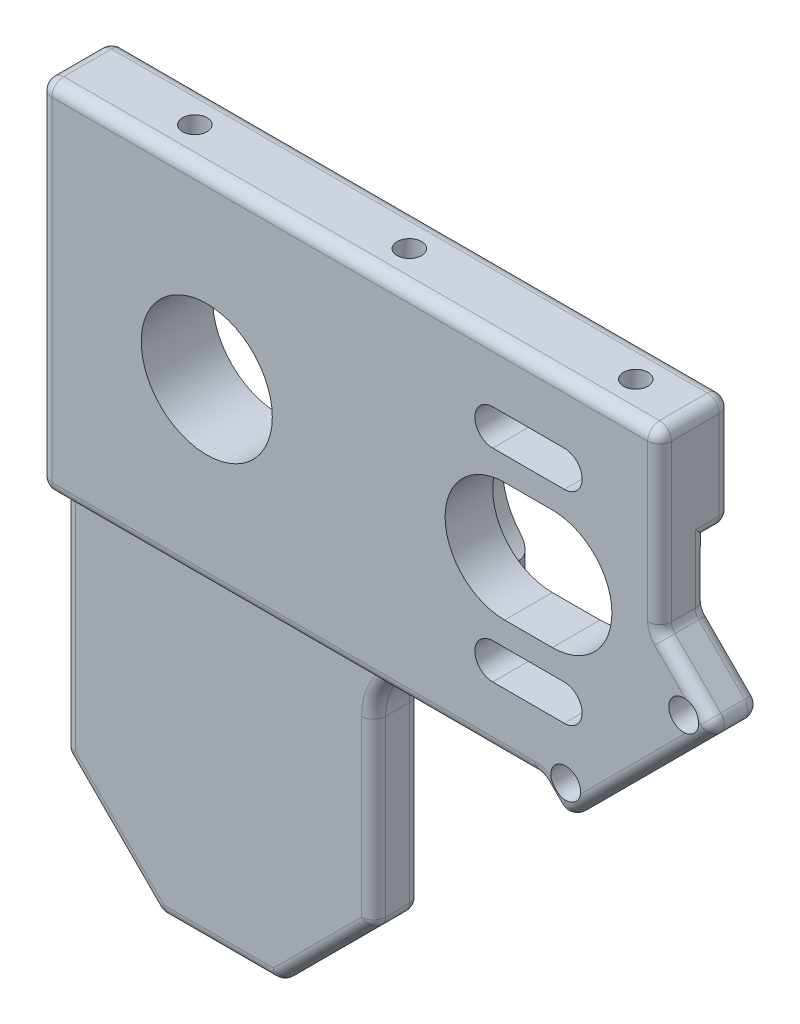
ISO-10303-21;
HEADER;
FILE_DESCRIPTION(('STEP AP214'),'2;1');
FILE_NAME('part.step','',(''),(''),'','','');
FILE_SCHEMA(('AUTOMOTIVE_DESIGN { 1 0 10303 214 1 1 1 1 }'));
ENDSEC;
DATA;
#1=APPLICATION_CONTEXT('core data for automotive mechanical design processes');
#2=APPLICATION_PROTOCOL_DEFINITION('international standard','automotive_design',2000,#1);
#3=PRODUCT_CONTEXT('',#1,'mechanical');
#4=PRODUCT('Part','Part','',(#3));
#5=PRODUCT_RELATED_PRODUCT_CATEGORY('part','',(#4));
#6=PRODUCT_DEFINITION_FORMATION('','',#4);
#7=PRODUCT_DEFINITION_CONTEXT('part definition',#1,'design');
#8=PRODUCT_DEFINITION('design','',#6,#7);
#9=PRODUCT_DEFINITION_SHAPE('','',#8);
#10=(LENGTH_UNIT() NAMED_UNIT(*) SI_UNIT(.MILLI.,.METRE.));
#11=(NAMED_UNIT(*) PLANE_ANGLE_UNIT() SI_UNIT($,.RADIAN.));
#12=(NAMED_UNIT(*) SI_UNIT($,.STERADIAN.) SOLID_ANGLE_UNIT());
#13=UNCERTAINTY_MEASURE_WITH_UNIT(LENGTH_MEASURE(1.E-05),#10,'distance_accuracy_value','');
#14=(GEOMETRIC_REPRESENTATION_CONTEXT(3) GLOBAL_UNCERTAINTY_ASSIGNED_CONTEXT((#13)) GLOBAL_UNIT_ASSIGNED_CONTEXT((#10,
#11,#12)) REPRESENTATION_CONTEXT('',''));
#15=CARTESIAN_POINT('',(0.,0.,0.));
#16=DIRECTION('',(0.,0.,1.));
#17=DIRECTION('',(1.,0.,0.));
#18=AXIS2_PLACEMENT_3D('',#15,#16,#17);
#19=CARTESIAN_POINT('',(0.,0.,6.));
#20=DIRECTION('',(0.,0.,1.));
#21=DIRECTION('',(1.,0.,0.));
#22=AXIS2_PLACEMENT_3D('',#19,#20,#21);
#23=PLANE('',#22);
#24=DIRECTION('',(1.,0.,0.));
#25=VECTOR('',#24,1.);
#26=CARTESIAN_POINT('',(38.,-25.,6.));
#27=LINE('',#26,#25);
#28=CARTESIAN_POINT('',(38.,-25.,6.));
#29=VERTEX_POINT('',#28);
#30=CARTESIAN_POINT('',(44.,-25.,6.));
#31=VERTEX_POINT('',#30);
#32=EDGE_CURVE('E653',#29,#31,#27,.T.);
#33=ORIENTED_EDGE('',*,*,#32,.F.);
#34=CARTESIAN_POINT('',(38.,-23.5,6.));
#35=DIRECTION('',(0.,0.,1.));
#36=DIRECTION('',(-1.,0.,0.));
#37=AXIS2_PLACEMENT_3D('',#34,#35,#36);
#38=CIRCLE('',#37,1.5);
#39=CARTESIAN_POINT('',(38.,-22.,6.));
#40=VERTEX_POINT('',#39);
#41=EDGE_CURVE('E646',#40,#29,#38,.T.);
#42=ORIENTED_EDGE('',*,*,#41,.F.);
#43=DIRECTION('',(-1.,0.,0.));
#44=VECTOR('',#43,1.);
#45=CARTESIAN_POINT('',(38.,-22.,6.));
#46=LINE('',#45,#44);
#47=CARTESIAN_POINT('',(44.,-22.,6.));
#48=VERTEX_POINT('',#47);
#49=EDGE_CURVE('E658',#48,#40,#46,.T.);
#50=ORIENTED_EDGE('',*,*,#49,.F.);
#51=CARTESIAN_POINT('',(44.,-23.5,6.));
#52=DIRECTION('',(0.,0.,1.));
#53=DIRECTION('',(-1.,0.,0.));
#54=AXIS2_PLACEMENT_3D('',#51,#52,#53);
#55=CIRCLE('',#54,1.5);
#56=EDGE_CURVE('E651',#31,#48,#55,.T.);
#57=ORIENTED_EDGE('',*,*,#56,.F.);
#58=EDGE_LOOP('',(#33,#42,#50,#57));
#59=FACE_BOUND('',#58,.T.);
#60=DIRECTION('',(1.,0.,0.));
#61=VECTOR('',#60,1.);
#62=CARTESIAN_POINT('',(38.,-8.,6.));
#63=LINE('',#62,#61);
#64=CARTESIAN_POINT('',(38.,-8.,6.));
#65=VERTEX_POINT('',#64);
#66=CARTESIAN_POINT('',(44.,-8.,6.));
#67=VERTEX_POINT('',#66);
#68=EDGE_CURVE('E675',#65,#67,#63,.T.);
#69=ORIENTED_EDGE('',*,*,#68,.F.);
#70=CARTESIAN_POINT('',(38.,-6.5,6.));
#71=DIRECTION('',(0.,0.,1.));
#72=DIRECTION('',(1.,0.,0.));
#73=AXIS2_PLACEMENT_3D('',#70,#71,#72);
#74=CIRCLE('',#73,1.5);
#75=CARTESIAN_POINT('',(38.,-5.,6.));
#76=VERTEX_POINT('',#75);
#77=EDGE_CURVE('E668',#76,#65,#74,.T.);
#78=ORIENTED_EDGE('',*,*,#77,.F.);
#79=DIRECTION('',(-1.,0.,0.));
#80=VECTOR('',#79,1.);
#81=CARTESIAN_POINT('',(38.,-5.,6.));
#82=LINE('',#81,#80);
#83=CARTESIAN_POINT('',(44.,-5.,6.));
#84=VERTEX_POINT('',#83);
#85=EDGE_CURVE('E680',#84,#76,#82,.T.);
#86=ORIENTED_EDGE('',*,*,#85,.F.);
#87=CARTESIAN_POINT('',(44.,-6.5,6.));
#88=DIRECTION('',(0.,0.,1.));
#89=DIRECTION('',(1.,0.,0.));
#90=AXIS2_PLACEMENT_3D('',#87,#88,#89);
#91=CIRCLE('',#90,1.5);
#92=EDGE_CURVE('E672',#67,#84,#91,.T.);
#93=ORIENTED_EDGE('',*,*,#92,.F.);
#94=EDGE_LOOP('',(#69,#78,#86,#93));
#95=FACE_BOUND('',#94,.T.);
#96=DIRECTION('',(1.,0.,0.));
#97=VECTOR('',#96,1.);
#98=CARTESIAN_POINT('',(39.,-20.,6.));
#99=LINE('',#98,#97);
#100=CARTESIAN_POINT('',(39.,-20.,6.));
#101=VERTEX_POINT('',#100);
#102=CARTESIAN_POINT('',(43.,-20.,6.));
#103=VERTEX_POINT('',#102);
#104=EDGE_CURVE('E693',#101,#103,#99,.T.);
#105=ORIENTED_EDGE('',*,*,#104,.F.);
#106=CARTESIAN_POINT('',(39.,-15.,6.));
#107=DIRECTION('',(0.,0.,1.));
#108=DIRECTION('',(1.,0.,0.));
#109=AXIS2_PLACEMENT_3D('',#106,#107,#108);
#110=CIRCLE('',#109,5.);
#111=CARTESIAN_POINT('',(39.,-10.,6.));
#112=VERTEX_POINT('',#111);
#113=EDGE_CURVE('E691',#112,#101,#110,.T.);
#114=ORIENTED_EDGE('',*,*,#113,.F.);
#115=DIRECTION('',(-1.,0.,0.));
#116=VECTOR('',#115,1.);
#117=CARTESIAN_POINT('',(39.,-10.,6.));
#118=LINE('',#117,#116);
#119=CARTESIAN_POINT('',(43.,-10.,6.));
#120=VERTEX_POINT('',#119);
#121=EDGE_CURVE('E698',#120,#112,#118,.T.);
#122=ORIENTED_EDGE('',*,*,#121,.F.);
#123=CARTESIAN_POINT('',(43.,-15.,6.));
#124=DIRECTION('',(0.,0.,1.));
#125=DIRECTION('',(1.,0.,0.));
#126=AXIS2_PLACEMENT_3D('',#123,#124,#125);
#127=CIRCLE('',#126,5.);
#128=EDGE_CURVE('E694',#103,#120,#127,.T.);
#129=ORIENTED_EDGE('',*,*,#128,.F.);
#130=EDGE_LOOP('',(#105,#114,#122,#129));
#131=FACE_BOUND('',#130,.T.);
#132=CARTESIAN_POINT('',(14.,-15.,6.));
#133=DIRECTION('',(0.,0.,1.));
#134=DIRECTION('',(1.,0.,0.));
#135=AXIS2_PLACEMENT_3D('',#132,#133,#134);
#136=CIRCLE('',#135,5.5);
#137=CARTESIAN_POINT('',(19.5,-15.,6.));
#138=VERTEX_POINT('',#137);
#139=EDGE_CURVE('E636',#138,#138,#136,.T.);
#140=ORIENTED_EDGE('',*,*,#139,.F.);
#141=EDGE_LOOP('',(#140));
#142=FACE_BOUND('',#141,.T.);
#143=CARTESIAN_POINT('',(44.1213203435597,-29.2928932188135,6.));
#144=DIRECTION('',(0.,0.,1.));
#145=DIRECTION('',(1.,0.,0.));
#146=AXIS2_PLACEMENT_3D('',#143,#144,#145);
#147=CIRCLE('',#146,1.25);
#148=CARTESIAN_POINT('',(45.3587572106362,-29.4696699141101,6.));
#149=VERTEX_POINT('',#148);
#150=CARTESIAN_POINT('',(42.885369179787,-29.479774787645,6.));
#151=VERTEX_POINT('',#150);
#152=EDGE_CURVE('E643',#149,#151,#147,.T.);
#153=ORIENTED_EDGE('',*,*,#152,.F.);
#154=DIRECTION('',(0.707106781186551,0.707106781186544,0.));
#155=VECTOR('',#154,1.);
#156=CARTESIAN_POINT('',(55.4350288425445,-19.3933982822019,6.));
#157=LINE('',#156,#155);
#158=CARTESIAN_POINT('',(54.1975919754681,-20.6308351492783,6.));
#159=VERTEX_POINT('',#158);
#160=EDGE_CURVE('E1278',#149,#159,#157,.T.);
#161=ORIENTED_EDGE('',*,*,#160,.T.);
#162=CARTESIAN_POINT('',(54.0208152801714,-19.3933982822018,6.));
#163=DIRECTION('',(0.,0.,1.));
#164=DIRECTION('',(1.,0.,0.));
#165=AXIS2_PLACEMENT_3D('',#162,#163,#164);
#166=CIRCLE('',#165,1.24999999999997);
#167=CARTESIAN_POINT('',(54.1975919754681,-18.1559614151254,6.));
#168=VERTEX_POINT('',#167);
#169=EDGE_CURVE('E641',#168,#159,#166,.T.);
#170=ORIENTED_EDGE('',*,*,#169,.F.);
#171=DIRECTION('',(-0.707106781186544,0.707106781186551,0.));
#172=VECTOR('',#171,1.);
#173=CARTESIAN_POINT('',(51.5857864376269,-15.5441558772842,6.));
#174=LINE('',#173,#172);
#175=CARTESIAN_POINT('',(51.5857864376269,-15.5441558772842,6.));
#176=VERTEX_POINT('',#175);
#177=EDGE_CURVE('E1250',#168,#176,#174,.T.);
#178=ORIENTED_EDGE('',*,*,#177,.T.);
#179=CARTESIAN_POINT('',(53.,-14.1299423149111,6.));
#180=DIRECTION('',(0.,0.,1.));
#181=DIRECTION('',(1.,0.,0.));
#182=AXIS2_PLACEMENT_3D('',#179,#180,#181);
#183=CIRCLE('',#182,2.);
#184=CARTESIAN_POINT('',(51.,-14.1299423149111,6.));
#185=VERTEX_POINT('',#184);
#186=EDGE_CURVE('E1711',#176,#185,#183,.F.);
#187=ORIENTED_EDGE('',*,*,#186,.T.);
#188=DIRECTION('',(0.,1.,0.));
#189=VECTOR('',#188,1.);
#190=CARTESIAN_POINT('',(51.,-1.,6.));
#191=LINE('',#190,#189);
#192=CARTESIAN_POINT('',(51.,-1.,6.));
#193=VERTEX_POINT('',#192);
#194=EDGE_CURVE('E1708',#185,#193,#191,.T.);
#195=ORIENTED_EDGE('',*,*,#194,.T.);
#196=DIRECTION('',(-1.,0.,0.));
#197=VECTOR('',#196,1.);
#198=CARTESIAN_POINT('',(1.00000000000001,-1.,6.));
#199=LINE('',#198,#197);
#200=CARTESIAN_POINT('',(1.,-1.,6.));
#201=VERTEX_POINT('',#200);
#202=EDGE_CURVE('E1705',#193,#201,#199,.T.);
#203=ORIENTED_EDGE('',*,*,#202,.T.);
#204=DIRECTION('',(0.,-1.,0.));
#205=VECTOR('',#204,1.);
#206=CARTESIAN_POINT('',(1.,-29.,6.));
#207=LINE('',#206,#205);
#208=CARTESIAN_POINT('',(1.,-29.,6.));
#209=VERTEX_POINT('',#208);
#210=EDGE_CURVE('E1704',#201,#209,#207,.T.);
#211=ORIENTED_EDGE('',*,*,#210,.T.);
#212=DIRECTION('',(1.,0.,0.));
#213=VECTOR('',#212,1.);
#214=CARTESIAN_POINT('',(41.585786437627,-29.,6.));
#215=LINE('',#214,#213);
#216=CARTESIAN_POINT('',(41.585786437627,-29.,6.));
#217=VERTEX_POINT('',#216);
#218=EDGE_CURVE('E1707',#209,#217,#215,.T.);
#219=ORIENTED_EDGE('',*,*,#218,.T.);
#220=CARTESIAN_POINT('',(41.585786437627,-31.,6.));
#221=DIRECTION('',(0.,0.,1.));
#222=DIRECTION('',(1.,0.,0.));
#223=AXIS2_PLACEMENT_3D('',#220,#221,#222);
#224=CIRCLE('',#223,2.);
#225=EDGE_CURVE('E1709',#217,#151,#224,.F.);
#226=ORIENTED_EDGE('',*,*,#225,.T.);
#227=EDGE_LOOP('',(#153,#161,#170,#178,#187,#195,#203,#211,#219,#226));
#228=FACE_BOUND('',#227,.T.);
#229=ADVANCED_FACE('F50',(#59,#95,#131,#142,#228),#23,.T.);
#230=DIRECTION('',(0.707106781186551,0.707106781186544,0.));
#231=VECTOR('',#230,1.);
#232=CARTESIAN_POINT('',(55.4350288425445,-19.3933982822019,6.));
#233=LINE('',#232,#231);
#234=CARTESIAN_POINT('',(55.2582521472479,-19.5701749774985,6.));
#235=VERTEX_POINT('',#234);
#236=CARTESIAN_POINT('',(55.4350288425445,-19.3933982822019,6.));
#237=VERTEX_POINT('',#236);
#238=EDGE_CURVE('E1273',#235,#237,#233,.T.);
#239=ORIENTED_EDGE('',*,*,#238,.T.);
#240=DIRECTION('',(-0.707106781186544,0.707106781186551,0.));
#241=VECTOR('',#240,1.);
#242=CARTESIAN_POINT('',(51.5857864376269,-15.5441558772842,6.));
#243=LINE('',#242,#241);
#244=CARTESIAN_POINT('',(55.2582521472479,-19.2166215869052,6.));
#245=VERTEX_POINT('',#244);
#246=EDGE_CURVE('E1271',#237,#245,#243,.T.);
#247=ORIENTED_EDGE('',*,*,#246,.T.);
#248=EDGE_CURVE('E638',#235,#245,#166,.T.);
#249=ORIENTED_EDGE('',*,*,#248,.F.);
#250=EDGE_LOOP('',(#239,#247,#249));
#251=FACE_BOUND('',#250,.T.);
#252=ADVANCED_FACE('F1221',(#251),#23,.T.);
#253=CARTESIAN_POINT('',(39.,-15.,2.));
#254=DIRECTION('',(0.,0.,-1.));
#255=DIRECTION('',(-1.,0.,0.));
#256=AXIS2_PLACEMENT_3D('',#253,#254,#255);
#257=PLANE('',#256);
#258=DIRECTION('',(-1.,0.,0.));
#259=VECTOR('',#258,1.);
#260=CARTESIAN_POINT('',(39.,-20.,2.));
#261=LINE('',#260,#259);
#262=CARTESIAN_POINT('',(43.,-20.,2.));
#263=VERTEX_POINT('',#262);
#264=CARTESIAN_POINT('',(39.,-20.,2.));
#265=VERTEX_POINT('',#264);
#266=EDGE_CURVE('E626',#263,#265,#261,.T.);
#267=ORIENTED_EDGE('',*,*,#266,.F.);
#268=CARTESIAN_POINT('',(43.,-15.,2.));
#269=DIRECTION('',(0.,0.,-1.));
#270=DIRECTION('',(-1.,0.,0.));
#271=AXIS2_PLACEMENT_3D('',#268,#269,#270);
#272=CIRCLE('',#271,5.);
#273=CARTESIAN_POINT('',(43.,-10.,2.));
#274=VERTEX_POINT('',#273);
#275=EDGE_CURVE('E621',#274,#263,#272,.T.);
#276=ORIENTED_EDGE('',*,*,#275,.F.);
#277=DIRECTION('',(1.,0.,0.));
#278=VECTOR('',#277,1.);
#279=CARTESIAN_POINT('',(39.,-10.,2.));
#280=LINE('',#279,#278);
#281=CARTESIAN_POINT('',(39.,-10.,2.));
#282=VERTEX_POINT('',#281);
#283=EDGE_CURVE('E619',#282,#274,#280,.T.);
#284=ORIENTED_EDGE('',*,*,#283,.F.);
#285=CARTESIAN_POINT('',(39.,-15.,2.));
#286=DIRECTION('',(0.,0.,-1.));
#287=DIRECTION('',(-1.,0.,0.));
#288=AXIS2_PLACEMENT_3D('',#285,#286,#287);
#289=CIRCLE('',#288,5.);
#290=EDGE_CURVE('E627',#265,#282,#289,.T.);
#291=ORIENTED_EDGE('',*,*,#290,.F.);
#292=EDGE_LOOP('',(#267,#276,#284,#291));
#293=FACE_BOUND('',#292,.T.);
#294=DIRECTION('',(-1.,0.,0.));
#295=VECTOR('',#294,1.);
#296=CARTESIAN_POINT('',(38.,-8.,2.));
#297=LINE('',#296,#295);
#298=CARTESIAN_POINT('',(44.,-8.,2.));
#299=VERTEX_POINT('',#298);
#300=CARTESIAN_POINT('',(38.,-8.,2.));
#301=VERTEX_POINT('',#300);
#302=EDGE_CURVE('E614',#299,#301,#297,.T.);
#303=ORIENTED_EDGE('',*,*,#302,.F.);
#304=CARTESIAN_POINT('',(44.,-6.5,2.));
#305=DIRECTION('',(0.,0.,-1.));
#306=DIRECTION('',(-1.,0.,0.));
#307=AXIS2_PLACEMENT_3D('',#304,#305,#306);
#308=CIRCLE('',#307,1.5);
#309=CARTESIAN_POINT('',(44.,-5.,2.));
#310=VERTEX_POINT('',#309);
#311=EDGE_CURVE('E613',#310,#299,#308,.T.);
#312=ORIENTED_EDGE('',*,*,#311,.F.);
#313=DIRECTION('',(1.,0.,0.));
#314=VECTOR('',#313,1.);
#315=CARTESIAN_POINT('',(38.,-5.,2.));
#316=LINE('',#315,#314);
#317=CARTESIAN_POINT('',(38.,-5.,2.));
#318=VERTEX_POINT('',#317);
#319=EDGE_CURVE('E606',#318,#310,#316,.T.);
#320=ORIENTED_EDGE('',*,*,#319,.F.);
#321=CARTESIAN_POINT('',(38.,-6.5,2.));
#322=DIRECTION('',(0.,0.,-1.));
#323=DIRECTION('',(-1.,0.,0.));
#324=AXIS2_PLACEMENT_3D('',#321,#322,#323);
#325=CIRCLE('',#324,1.5);
#326=EDGE_CURVE('E617',#301,#318,#325,.T.);
#327=ORIENTED_EDGE('',*,*,#326,.F.);
#328=EDGE_LOOP('',(#303,#312,#320,#327));
#329=FACE_BOUND('',#328,.T.);
#330=DIRECTION('',(-1.,0.,0.));
#331=VECTOR('',#330,1.);
#332=CARTESIAN_POINT('',(38.,-25.,2.));
#333=LINE('',#332,#331);
#334=CARTESIAN_POINT('',(44.,-25.,2.));
#335=VERTEX_POINT('',#334);
#336=CARTESIAN_POINT('',(38.,-25.,2.));
#337=VERTEX_POINT('',#336);
#338=EDGE_CURVE('E605',#335,#337,#333,.T.);
#339=ORIENTED_EDGE('',*,*,#338,.F.);
#340=CARTESIAN_POINT('',(44.,-23.5,2.));
#341=DIRECTION('',(0.,0.,-1.));
#342=DIRECTION('',(-1.,0.,0.));
#343=AXIS2_PLACEMENT_3D('',#340,#341,#342);
#344=CIRCLE('',#343,1.5);
#345=CARTESIAN_POINT('',(44.,-22.,2.));
#346=VERTEX_POINT('',#345);
#347=EDGE_CURVE('E599',#346,#335,#344,.T.);
#348=ORIENTED_EDGE('',*,*,#347,.F.);
#349=DIRECTION('',(1.,0.,0.));
#350=VECTOR('',#349,1.);
#351=CARTESIAN_POINT('',(38.,-22.,2.));
#352=LINE('',#351,#350);
#353=CARTESIAN_POINT('',(38.,-22.,2.));
#354=VERTEX_POINT('',#353);
#355=EDGE_CURVE('E597',#354,#346,#352,.T.);
#356=ORIENTED_EDGE('',*,*,#355,.F.);
#357=CARTESIAN_POINT('',(38.,-23.5,2.));
#358=DIRECTION('',(0.,0.,-1.));
#359=DIRECTION('',(-1.,0.,0.));
#360=AXIS2_PLACEMENT_3D('',#357,#358,#359);
#361=CIRCLE('',#360,1.5);
#362=EDGE_CURVE('E603',#337,#354,#361,.T.);
#363=ORIENTED_EDGE('',*,*,#362,.F.);
#364=EDGE_LOOP('',(#339,#348,#356,#363));
#365=FACE_BOUND('',#364,.T.);
#366=DIRECTION('',(1.,0.,0.));
#367=VECTOR('',#366,1.);
#368=CARTESIAN_POINT('',(52.,-9.44276941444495,2.));
#369=LINE('',#368,#367);
#370=CARTESIAN_POINT('',(47.7381966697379,-9.44276941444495,2.));
#371=VERTEX_POINT('',#370);
#372=CARTESIAN_POINT('',(51.,-9.44276941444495,2.));
#373=VERTEX_POINT('',#372);
#374=EDGE_CURVE('E571',#371,#373,#369,.T.);
#375=ORIENTED_EDGE('',*,*,#374,.T.);
#376=DIRECTION('',(0.,-1.,0.));
#377=VECTOR('',#376,1.);
#378=CARTESIAN_POINT('',(51.,-14.1299423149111,2.));
#379=LINE('',#378,#377);
#380=CARTESIAN_POINT('',(51.,-14.1299423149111,2.));
#381=VERTEX_POINT('',#380);
#382=EDGE_CURVE('E832',#373,#381,#379,.T.);
#383=ORIENTED_EDGE('',*,*,#382,.T.);
#384=CARTESIAN_POINT('',(53.,-14.1299423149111,2.));
#385=DIRECTION('',(0.,0.,-1.));
#386=DIRECTION('',(-1.,0.,0.));
#387=AXIS2_PLACEMENT_3D('',#384,#385,#386);
#388=CIRCLE('',#387,2.);
#389=CARTESIAN_POINT('',(51.5857864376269,-15.5441558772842,2.));
#390=VERTEX_POINT('',#389);
#391=EDGE_CURVE('E831',#381,#390,#388,.F.);
#392=ORIENTED_EDGE('',*,*,#391,.T.);
#393=DIRECTION('',(0.707106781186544,-0.707106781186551,0.));
#394=VECTOR('',#393,1.);
#395=CARTESIAN_POINT('',(55.4350288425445,-19.3933982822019,2.));
#396=LINE('',#395,#394);
#397=CARTESIAN_POINT('',(54.1975919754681,-18.1559614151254,2.));
#398=VERTEX_POINT('',#397);
#399=EDGE_CURVE('E827',#390,#398,#396,.T.);
#400=ORIENTED_EDGE('',*,*,#399,.T.);
#401=CARTESIAN_POINT('',(54.0208152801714,-19.3933982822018,2.));
#402=DIRECTION('',(0.,0.,-1.));
#403=DIRECTION('',(-1.,0.,0.));
#404=AXIS2_PLACEMENT_3D('',#401,#402,#403);
#405=CIRCLE('',#404,1.24999999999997);
#406=CARTESIAN_POINT('',(54.1975919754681,-20.6308351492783,2.));
#407=VERTEX_POINT('',#406);
#408=EDGE_CURVE('E586',#407,#398,#405,.T.);
#409=ORIENTED_EDGE('',*,*,#408,.F.);
#410=DIRECTION('',(-0.707106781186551,-0.707106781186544,0.));
#411=VECTOR('',#410,1.);
#412=CARTESIAN_POINT('',(44.1213203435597,-30.7071067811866,2.));
#413=LINE('',#412,#411);
#414=CARTESIAN_POINT('',(45.3587572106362,-29.4696699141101,2.));
#415=VERTEX_POINT('',#414);
#416=EDGE_CURVE('E819',#407,#415,#413,.T.);
#417=ORIENTED_EDGE('',*,*,#416,.T.);
#418=CARTESIAN_POINT('',(44.1213203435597,-29.2928932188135,2.));
#419=DIRECTION('',(0.,0.,-1.));
#420=DIRECTION('',(-1.,0.,0.));
#421=AXIS2_PLACEMENT_3D('',#418,#419,#420);
#422=CIRCLE('',#421,1.25);
#423=CARTESIAN_POINT('',(42.885369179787,-29.479774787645,2.));
#424=VERTEX_POINT('',#423);
#425=EDGE_CURVE('E593',#424,#415,#422,.T.);
#426=ORIENTED_EDGE('',*,*,#425,.F.);
#427=CARTESIAN_POINT('',(41.585786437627,-31.,2.));
#428=DIRECTION('',(0.,0.,-1.));
#429=DIRECTION('',(-1.,0.,0.));
#430=AXIS2_PLACEMENT_3D('',#427,#428,#429);
#431=CIRCLE('',#430,2.);
#432=CARTESIAN_POINT('',(41.585786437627,-29.,2.));
#433=VERTEX_POINT('',#432);
#434=EDGE_CURVE('E824',#424,#433,#431,.F.);
#435=ORIENTED_EDGE('',*,*,#434,.T.);
#436=DIRECTION('',(-1.,0.,0.));
#437=VECTOR('',#436,1.);
#438=CARTESIAN_POINT('',(34.2997392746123,-29.,2.));
#439=LINE('',#438,#437);
#440=CARTESIAN_POINT('',(35.2997392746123,-29.,2.));
#441=VERTEX_POINT('',#440);
#442=EDGE_CURVE('E830',#433,#441,#439,.T.);
#443=ORIENTED_EDGE('',*,*,#442,.T.);
#444=DIRECTION('',(0.,1.,0.));
#445=VECTOR('',#444,1.);
#446=CARTESIAN_POINT('',(35.2997392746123,-19.9637797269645,2.));
#447=LINE('',#446,#445);
#448=CARTESIAN_POINT('',(35.2997392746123,-19.9637797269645,2.));
#449=VERTEX_POINT('',#448);
#450=EDGE_CURVE('E573',#441,#449,#447,.T.);
#451=ORIENTED_EDGE('',*,*,#450,.T.);
#452=CARTESIAN_POINT('',(39.,-15.,2.));
#453=DIRECTION('',(0.,0.,-1.));
#454=DIRECTION('',(-1.,0.,0.));
#455=AXIS2_PLACEMENT_3D('',#452,#453,#454);
#456=CIRCLE('',#455,6.19120655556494);
#457=CARTESIAN_POINT('',(35.2997392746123,-10.0362202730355,2.));
#458=VERTEX_POINT('',#457);
#459=EDGE_CURVE('E577',#449,#458,#456,.T.);
#460=ORIENTED_EDGE('',*,*,#459,.T.);
#461=DIRECTION('',(0.,1.,0.));
#462=VECTOR('',#461,1.);
#463=CARTESIAN_POINT('',(35.2997392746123,-3.77327314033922,2.));
#464=LINE('',#463,#462);
#465=CARTESIAN_POINT('',(35.2997392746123,-4.77327314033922,2.));
#466=VERTEX_POINT('',#465);
#467=EDGE_CURVE('E576',#458,#466,#464,.T.);
#468=ORIENTED_EDGE('',*,*,#467,.T.);
#469=CARTESIAN_POINT('',(36.2997392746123,-4.77327314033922,2.));
#470=DIRECTION('',(0.,0.,-1.));
#471=DIRECTION('',(-1.,0.,0.));
#472=AXIS2_PLACEMENT_3D('',#469,#470,#471);
#473=CIRCLE('',#472,1.);
#474=CARTESIAN_POINT('',(36.2997392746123,-3.77327314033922,2.));
#475=VERTEX_POINT('',#474);
#476=EDGE_CURVE('E739',#466,#475,#473,.T.);
#477=ORIENTED_EDGE('',*,*,#476,.T.);
#478=DIRECTION('',(1.,0.,0.));
#479=VECTOR('',#478,1.);
#480=CARTESIAN_POINT('',(46.7381966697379,-3.77327314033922,2.));
#481=LINE('',#480,#479);
#482=CARTESIAN_POINT('',(45.7381966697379,-3.77327314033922,2.));
#483=VERTEX_POINT('',#482);
#484=EDGE_CURVE('E564',#475,#483,#481,.T.);
#485=ORIENTED_EDGE('',*,*,#484,.T.);
#486=CARTESIAN_POINT('',(45.7381966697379,-4.77327314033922,2.));
#487=DIRECTION('',(0.,0.,-1.));
#488=DIRECTION('',(-1.,0.,0.));
#489=AXIS2_PLACEMENT_3D('',#486,#487,#488);
#490=CIRCLE('',#489,1.);
#491=CARTESIAN_POINT('',(46.7381966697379,-4.77327314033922,2.));
#492=VERTEX_POINT('',#491);
#493=EDGE_CURVE('E736',#483,#492,#490,.T.);
#494=ORIENTED_EDGE('',*,*,#493,.T.);
#495=DIRECTION('',(0.,-1.,0.));
#496=VECTOR('',#495,1.);
#497=CARTESIAN_POINT('',(46.7381966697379,-9.44276941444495,2.));
#498=LINE('',#497,#496);
#499=CARTESIAN_POINT('',(46.7381966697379,-8.44276941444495,2.));
#500=VERTEX_POINT('',#499);
#501=EDGE_CURVE('E568',#492,#500,#498,.T.);
#502=ORIENTED_EDGE('',*,*,#501,.T.);
#503=CARTESIAN_POINT('',(47.7381966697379,-8.44276941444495,2.));
#504=DIRECTION('',(0.,0.,-1.));
#505=DIRECTION('',(-1.,0.,0.));
#506=AXIS2_PLACEMENT_3D('',#503,#504,#505);
#507=CIRCLE('',#506,1.);
#508=EDGE_CURVE('E810',#500,#371,#507,.F.);
#509=ORIENTED_EDGE('',*,*,#508,.T.);
#510=EDGE_LOOP('',(#375,#383,#392,#400,#409,#417,#426,#435,#443,#451,#460,#468,#477,#485,#494,
#502,#509));
#511=FACE_BOUND('',#510,.T.);
#512=ADVANCED_FACE('F1229',(#293,#329,#365,#511),#257,.T.);
#513=CARTESIAN_POINT('',(55.2582521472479,-19.2166215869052,2.));
#514=VERTEX_POINT('',#513);
#515=CARTESIAN_POINT('',(55.2582521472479,-19.5701749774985,2.));
#516=VERTEX_POINT('',#515);
#517=EDGE_CURVE('E592',#514,#516,#405,.T.);
#518=ORIENTED_EDGE('',*,*,#517,.F.);
#519=DIRECTION('',(0.707106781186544,-0.707106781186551,0.));
#520=VECTOR('',#519,1.);
#521=CARTESIAN_POINT('',(55.4350288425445,-19.3933982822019,2.));
#522=LINE('',#521,#520);
#523=CARTESIAN_POINT('',(55.4350288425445,-19.3933982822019,2.));
#524=VERTEX_POINT('',#523);
#525=EDGE_CURVE('E823',#514,#524,#522,.T.);
#526=ORIENTED_EDGE('',*,*,#525,.T.);
#527=DIRECTION('',(-0.707106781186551,-0.707106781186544,0.));
#528=VECTOR('',#527,1.);
#529=CARTESIAN_POINT('',(44.1213203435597,-30.7071067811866,2.));
#530=LINE('',#529,#528);
#531=EDGE_CURVE('E821',#524,#516,#530,.T.);
#532=ORIENTED_EDGE('',*,*,#531,.T.);
#533=EDGE_LOOP('',(#518,#526,#532));
#534=FACE_BOUND('',#533,.T.);
#535=ADVANCED_FACE('F1838',(#534),#257,.T.);
#536=CARTESIAN_POINT('',(44.1213203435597,-32.1213203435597,6.));
#537=DIRECTION('',(-0.707106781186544,0.707106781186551,0.));
#538=DIRECTION('',(-0.707106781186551,-0.707106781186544,0.));
#539=AXIS2_PLACEMENT_3D('',#536,#537,#538);
#540=PLANE('',#539);
#541=DIRECTION('',(0.,0.,-1.));
#542=VECTOR('',#541,1.);
#543=CARTESIAN_POINT('',(56.1421356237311,-20.1005050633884,6.));
#544=LINE('',#543,#542);
#545=CARTESIAN_POINT('',(56.1421356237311,-20.1005050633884,3.));
#546=VERTEX_POINT('',#545);
#547=CARTESIAN_POINT('',(56.1421356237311,-20.1005050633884,5.));
#548=VERTEX_POINT('',#547);
#549=EDGE_CURVE('E767',#546,#548,#544,.F.);
#550=ORIENTED_EDGE('',*,*,#549,.T.);
#551=DIRECTION('',(0.707106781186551,0.707106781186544,0.));
#552=VECTOR('',#551,1.);
#553=CARTESIAN_POINT('',(44.8284271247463,-31.4142135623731,5.));
#554=LINE('',#553,#552);
#555=CARTESIAN_POINT('',(44.8284271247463,-31.4142135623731,5.));
#556=VERTEX_POINT('',#555);
#557=EDGE_CURVE('E1285',#548,#556,#554,.F.);
#558=ORIENTED_EDGE('',*,*,#557,.T.);
#559=DIRECTION('',(0.,0.,-1.));
#560=VECTOR('',#559,1.);
#561=CARTESIAN_POINT('',(44.8284271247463,-31.4142135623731,6.));
#562=LINE('',#561,#560);
#563=CARTESIAN_POINT('',(44.8284271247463,-31.4142135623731,3.));
#564=VERTEX_POINT('',#563);
#565=EDGE_CURVE('E772',#556,#564,#562,.T.);
#566=ORIENTED_EDGE('',*,*,#565,.T.);
#567=DIRECTION('',(-0.707106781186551,-0.707106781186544,0.));
#568=VECTOR('',#567,1.);
#569=CARTESIAN_POINT('',(56.1421356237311,-20.1005050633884,3.));
#570=LINE('',#569,#568);
#571=EDGE_CURVE('E1279',#564,#546,#570,.F.);
#572=ORIENTED_EDGE('',*,*,#571,.T.);
#573=EDGE_LOOP('',(#550,#558,#566,#572));
#574=FACE_BOUND('',#573,.T.);
#575=ADVANCED_FACE('F1683',(#574),#540,.F.);
#576=CARTESIAN_POINT('',(0.,0.,0.));
#577=DIRECTION('',(0.,0.,1.));
#578=DIRECTION('',(1.,0.,0.));
#579=AXIS2_PLACEMENT_3D('',#576,#577,#578);
#580=PLANE('',#579);
#581=CARTESIAN_POINT('',(14.,-15.,0.));
#582=DIRECTION('',(0.,0.,1.));
#583=DIRECTION('',(1.,0.,0.));
#584=AXIS2_PLACEMENT_3D('',#581,#582,#583);
#585=CIRCLE('',#584,5.5);
#586=CARTESIAN_POINT('',(19.5,-15.,0.));
#587=VERTEX_POINT('',#586);
#588=EDGE_CURVE('E634',#587,#587,#585,.T.);
#589=ORIENTED_EDGE('',*,*,#588,.T.);
#590=EDGE_LOOP('',(#589));
#591=FACE_BOUND('',#590,.T.);
#592=CARTESIAN_POINT('',(36.2997392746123,-4.77327314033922,0.));
#593=DIRECTION('',(0.,0.,1.));
#594=DIRECTION('',(1.,0.,0.));
#595=AXIS2_PLACEMENT_3D('',#592,#593,#594);
#596=CIRCLE('',#595,2.);
#597=CARTESIAN_POINT('',(36.2997392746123,-2.77327314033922,0.));
#598=VERTEX_POINT('',#597);
#599=CARTESIAN_POINT('',(34.2997392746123,-4.77327314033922,0.));
#600=VERTEX_POINT('',#599);
#601=EDGE_CURVE('E1380',#598,#600,#596,.T.);
#602=ORIENTED_EDGE('',*,*,#601,.T.);
#603=DIRECTION('',(0.,1.,0.));
#604=VECTOR('',#603,1.);
#605=CARTESIAN_POINT('',(34.2997392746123,0.,0.));
#606=LINE('',#605,#604);
#607=CARTESIAN_POINT('',(34.2997392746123,-10.9702868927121,0.));
#608=VERTEX_POINT('',#607);
#609=EDGE_CURVE('E1376',#600,#608,#606,.F.);
#610=ORIENTED_EDGE('',*,*,#609,.T.);
#611=CARTESIAN_POINT('',(39.,-15.,0.));
#612=DIRECTION('',(0.,0.,-1.));
#613=DIRECTION('',(-1.,0.,0.));
#614=AXIS2_PLACEMENT_3D('',#611,#612,#613);
#615=CIRCLE('',#614,6.19120655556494);
#616=CARTESIAN_POINT('',(34.2997392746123,-19.0297131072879,0.));
#617=VERTEX_POINT('',#616);
#618=EDGE_CURVE('E562',#617,#608,#615,.T.);
#619=ORIENTED_EDGE('',*,*,#618,.F.);
#620=DIRECTION('',(0.,1.,0.));
#621=VECTOR('',#620,1.);
#622=CARTESIAN_POINT('',(34.2997392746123,0.,0.));
#623=LINE('',#622,#621);
#624=CARTESIAN_POINT('',(34.2997392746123,-29.,0.));
#625=VERTEX_POINT('',#624);
#626=EDGE_CURVE('E1364',#617,#625,#623,.F.);
#627=ORIENTED_EDGE('',*,*,#626,.T.);
#628=DIRECTION('',(1.,0.,0.));
#629=VECTOR('',#628,1.);
#630=CARTESIAN_POINT('',(0.,-29.,0.));
#631=LINE('',#630,#629);
#632=CARTESIAN_POINT('',(31.0000000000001,-29.,0.));
#633=VERTEX_POINT('',#632);
#634=EDGE_CURVE('E1362',#625,#633,#631,.F.);
#635=ORIENTED_EDGE('',*,*,#634,.T.);
#636=CARTESIAN_POINT('',(31.0000000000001,-35.,0.));
#637=DIRECTION('',(0.,0.,1.));
#638=DIRECTION('',(1.,0.,0.));
#639=AXIS2_PLACEMENT_3D('',#636,#637,#638);
#640=CIRCLE('',#639,6.);
#641=CARTESIAN_POINT('',(25.0000000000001,-35.,0.));
#642=VERTEX_POINT('',#641);
#643=EDGE_CURVE('E1356',#633,#642,#640,.T.);
#644=ORIENTED_EDGE('',*,*,#643,.T.);
#645=DIRECTION('',(0.,1.,0.));
#646=VECTOR('',#645,1.);
#647=CARTESIAN_POINT('',(25.0000000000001,0.,0.));
#648=LINE('',#647,#646);
#649=CARTESIAN_POINT('',(25.0000000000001,-49.5857864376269,0.));
#650=VERTEX_POINT('',#649);
#651=EDGE_CURVE('E1360',#642,#650,#648,.F.);
#652=ORIENTED_EDGE('',*,*,#651,.T.);
#653=DIRECTION('',(0.707106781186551,0.707106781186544,0.));
#654=VECTOR('',#653,1.);
#655=CARTESIAN_POINT('',(37.2928932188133,-37.2928932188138,0.));
#656=LINE('',#655,#654);
#657=CARTESIAN_POINT('',(17.5857864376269,-57.,0.));
#658=VERTEX_POINT('',#657);
#659=EDGE_CURVE('E1354',#650,#658,#656,.F.);
#660=ORIENTED_EDGE('',*,*,#659,.T.);
#661=DIRECTION('',(1.,0.,0.));
#662=VECTOR('',#661,1.);
#663=CARTESIAN_POINT('',(0.,-57.,0.));
#664=LINE('',#663,#662);
#665=CARTESIAN_POINT('',(8.41421356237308,-57.,0.));
#666=VERTEX_POINT('',#665);
#667=EDGE_CURVE('E1352',#658,#666,#664,.F.);
#668=ORIENTED_EDGE('',*,*,#667,.T.);
#669=DIRECTION('',(0.707106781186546,-0.707106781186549,0.));
#670=VECTOR('',#669,1.);
#671=CARTESIAN_POINT('',(-24.2928932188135,-24.2928932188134,0.));
#672=LINE('',#671,#670);
#673=CARTESIAN_POINT('',(1.00000000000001,-49.5857864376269,0.));
#674=VERTEX_POINT('',#673);
#675=EDGE_CURVE('E1351',#666,#674,#672,.F.);
#676=ORIENTED_EDGE('',*,*,#675,.T.);
#677=DIRECTION('',(0.,-1.,0.));
#678=VECTOR('',#677,1.);
#679=CARTESIAN_POINT('',(1.,0.,0.));
#680=LINE('',#679,#678);
#681=CARTESIAN_POINT('',(1.,-1.,0.));
#682=VERTEX_POINT('',#681);
#683=EDGE_CURVE('E1347',#674,#682,#680,.F.);
#684=ORIENTED_EDGE('',*,*,#683,.T.);
#685=DIRECTION('',(-1.,0.,0.));
#686=VECTOR('',#685,1.);
#687=CARTESIAN_POINT('',(0.,-1.,0.));
#688=LINE('',#687,#686);
#689=CARTESIAN_POINT('',(51.,-1.,0.));
#690=VERTEX_POINT('',#689);
#691=EDGE_CURVE('E1363',#682,#690,#688,.F.);
#692=ORIENTED_EDGE('',*,*,#691,.T.);
#693=DIRECTION('',(0.,1.,0.));
#694=VECTOR('',#693,1.);
#695=CARTESIAN_POINT('',(51.,0.,0.));
#696=LINE('',#695,#694);
#697=CARTESIAN_POINT('',(51.,-8.44276941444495,0.));
#698=VERTEX_POINT('',#697);
#699=EDGE_CURVE('E1370',#690,#698,#696,.F.);
#700=ORIENTED_EDGE('',*,*,#699,.T.);
#701=DIRECTION('',(1.,0.,0.));
#702=VECTOR('',#701,1.);
#703=CARTESIAN_POINT('',(0.,-8.44276941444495,0.));
#704=LINE('',#703,#702);
#705=CARTESIAN_POINT('',(47.7381966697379,-8.44276941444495,0.));
#706=VERTEX_POINT('',#705);
#707=EDGE_CURVE('E1367',#698,#706,#704,.F.);
#708=ORIENTED_EDGE('',*,*,#707,.T.);
#709=DIRECTION('',(0.,-1.,0.));
#710=VECTOR('',#709,1.);
#711=CARTESIAN_POINT('',(47.7381966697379,0.,0.));
#712=LINE('',#711,#710);
#713=CARTESIAN_POINT('',(47.7381966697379,-4.77327314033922,0.));
#714=VERTEX_POINT('',#713);
#715=EDGE_CURVE('E1373',#706,#714,#712,.F.);
#716=ORIENTED_EDGE('',*,*,#715,.T.);
#717=CARTESIAN_POINT('',(45.7381966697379,-4.77327314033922,0.));
#718=DIRECTION('',(0.,0.,1.));
#719=DIRECTION('',(1.,0.,0.));
#720=AXIS2_PLACEMENT_3D('',#717,#718,#719);
#721=CIRCLE('',#720,2.);
#722=CARTESIAN_POINT('',(45.7381966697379,-2.77327314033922,0.));
#723=VERTEX_POINT('',#722);
#724=EDGE_CURVE('E1371',#714,#723,#721,.T.);
#725=ORIENTED_EDGE('',*,*,#724,.T.);
#726=DIRECTION('',(1.,0.,0.));
#727=VECTOR('',#726,1.);
#728=CARTESIAN_POINT('',(0.,-2.77327314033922,0.));
#729=LINE('',#728,#727);
#730=EDGE_CURVE('E1372',#723,#598,#729,.F.);
#731=ORIENTED_EDGE('',*,*,#730,.T.);
#732=EDGE_LOOP('',(#602,#610,#619,#627,#635,#644,#652,#660,#668,#676,#684,#692,#700,#708,#716,
#725,#731));
#733=FACE_BOUND('',#732,.T.);
#734=ADVANCED_FACE('F1104',(#591,#733),#580,.F.);
#735=CARTESIAN_POINT('',(26.0000000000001,-30.,6.));
#736=DIRECTION('',(0.,1.,0.));
#737=DIRECTION('',(-1.,0.,0.));
#738=AXIS2_PLACEMENT_3D('',#735,#736,#737);
#739=PLANE('',#738);
#740=DIRECTION('',(0.,0.,-1.));
#741=VECTOR('',#740,1.);
#742=CARTESIAN_POINT('',(34.2997392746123,-30.,6.));
#743=LINE('',#742,#741);
#744=CARTESIAN_POINT('',(34.2997392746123,-30.,1.));
#745=VERTEX_POINT('',#744);
#746=CARTESIAN_POINT('',(34.2997392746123,-30.,3.));
#747=VERTEX_POINT('',#746);
#748=EDGE_CURVE('E727',#745,#747,#743,.F.);
#749=ORIENTED_EDGE('',*,*,#748,.T.);
#750=DIRECTION('',(-1.,0.,0.));
#751=VECTOR('',#750,1.);
#752=CARTESIAN_POINT('',(41.585786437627,-30.,3.));
#753=LINE('',#752,#751);
#754=CARTESIAN_POINT('',(41.585786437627,-30.,3.));
#755=VERTEX_POINT('',#754);
#756=EDGE_CURVE('E886',#747,#755,#753,.F.);
#757=ORIENTED_EDGE('',*,*,#756,.T.);
#758=DIRECTION('',(0.,0.,-1.));
#759=VECTOR('',#758,1.);
#760=CARTESIAN_POINT('',(41.585786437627,-30.,6.));
#761=LINE('',#760,#759);
#762=CARTESIAN_POINT('',(41.585786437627,-30.,5.));
#763=VERTEX_POINT('',#762);
#764=EDGE_CURVE('E721',#755,#763,#761,.F.);
#765=ORIENTED_EDGE('',*,*,#764,.T.);
#766=DIRECTION('',(1.,0.,0.));
#767=VECTOR('',#766,1.);
#768=CARTESIAN_POINT('',(1.,-30.,5.));
#769=LINE('',#768,#767);
#770=CARTESIAN_POINT('',(1.,-30.,5.));
#771=VERTEX_POINT('',#770);
#772=EDGE_CURVE('E1653',#763,#771,#769,.F.);
#773=ORIENTED_EDGE('',*,*,#772,.T.);
#774=DIRECTION('',(0.,0.,1.));
#775=VECTOR('',#774,1.);
#776=CARTESIAN_POINT('',(1.,-30.,6.));
#777=LINE('',#776,#775);
#778=CARTESIAN_POINT('',(1.00000000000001,-30.,4.));
#779=VERTEX_POINT('',#778);
#780=EDGE_CURVE('E726',#771,#779,#777,.F.);
#781=ORIENTED_EDGE('',*,*,#780,.T.);
#782=DIRECTION('',(-1.,0.,0.));
#783=VECTOR('',#782,1.);
#784=CARTESIAN_POINT('',(26.0000000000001,-30.,4.));
#785=LINE('',#784,#783);
#786=CARTESIAN_POINT('',(27.6833752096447,-30.,4.));
#787=VERTEX_POINT('',#786);
#788=EDGE_CURVE('E635',#787,#779,#785,.T.);
#789=ORIENTED_EDGE('',*,*,#788,.F.);
#790=CARTESIAN_POINT('',(27.6833752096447,-30.,4.));
#791=CARTESIAN_POINT('',(27.7450551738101,-30.,3.99999265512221));
#792=CARTESIAN_POINT('',(27.8067103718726,-30.,3.99825737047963));
#793=CARTESIAN_POINT('',(27.9298215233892,-30.,3.99167927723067));
#794=CARTESIAN_POINT('',(27.9912775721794,-30.,3.98683828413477));
#795=CARTESIAN_POINT('',(28.1748668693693,-30.,3.96821224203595));
#796=CARTESIAN_POINT('',(28.2965884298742,-30.,3.95031992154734));
#797=CARTESIAN_POINT('',(28.5370271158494,-30.,3.90603866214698));
#798=CARTESIAN_POINT('',(28.6557625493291,-30.,3.87974501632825));
#799=CARTESIAN_POINT('',(28.8915853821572,-30.,3.82030252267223));
#800=CARTESIAN_POINT('',(29.0086713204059,-30.,3.78714796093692));
#801=CARTESIAN_POINT('',(29.2844887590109,-30.,3.70207510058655));
#802=CARTESIAN_POINT('',(29.4424761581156,-30.,3.64776910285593));
#803=CARTESIAN_POINT('',(29.7558444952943,-30.,3.53204394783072));
#804=CARTESIAN_POINT('',(29.9112243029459,-30.,3.47062179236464));
#805=CARTESIAN_POINT('',(30.375369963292,-30.,3.27926384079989));
#806=CARTESIAN_POINT('',(30.6812841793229,-30.,3.14253295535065));
#807=CARTESIAN_POINT('',(30.9913933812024,-30.,3.00384898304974));
#808=CARTESIAN_POINT('',(30.9956966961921,-30.,3.0019244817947));
#809=CARTESIAN_POINT('',(31.0000000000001,-30.,3.));
#810=B_SPLINE_CURVE_WITH_KNOTS('',3,(#790,#791,#792,#793,#794,#795,#796,#797,#798,#799,#800,
#801,#802,#803,#804,#805,#806,#807,#808,#809),.UNSPECIFIED.,.F.,.F.,(4,2,2,2,2,2,2,2,2,4),(0.,
0.184977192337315,0.369846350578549,0.738487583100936,1.10308764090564,1.46799257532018,
1.96890994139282,2.4700391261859,3.47501470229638,3.48915683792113),.UNSPECIFIED.);
#811=CARTESIAN_POINT('',(31.0000000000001,-30.,3.));
#812=VERTEX_POINT('',#811);
#813=EDGE_CURVE('E60',#787,#812,#810,.T.);
#814=ORIENTED_EDGE('',*,*,#813,.T.);
#815=DIRECTION('',(0.,0.,-1.));
#816=VECTOR('',#815,1.);
#817=CARTESIAN_POINT('',(31.0000000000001,-30.,0.));
#818=LINE('',#817,#816);
#819=CARTESIAN_POINT('',(31.0000000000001,-30.,1.));
#820=VERTEX_POINT('',#819);
#821=EDGE_CURVE('E809',#812,#820,#818,.T.);
#822=ORIENTED_EDGE('',*,*,#821,.T.);
#823=DIRECTION('',(1.,0.,0.));
#824=VECTOR('',#823,1.);
#825=CARTESIAN_POINT('',(26.0000000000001,-30.,1.));
#826=LINE('',#825,#824);
#827=EDGE_CURVE('E1647',#820,#745,#826,.T.);
#828=ORIENTED_EDGE('',*,*,#827,.T.);
#829=EDGE_LOOP('',(#749,#757,#765,#773,#781,#789,#814,#822,#828));
#830=FACE_BOUND('',#829,.T.);
#831=ADVANCED_FACE('F1099',(#830),#739,.F.);
#832=CARTESIAN_POINT('',(42.0000000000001,-30.,6.));
#833=DIRECTION('',(0.707106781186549,0.707106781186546,0.));
#834=DIRECTION('',(-0.707106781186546,0.707106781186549,0.));
#835=AXIS2_PLACEMENT_3D('',#832,#833,#834);
#836=PLANE('',#835);
#837=DIRECTION('',(0.,0.,-1.));
#838=VECTOR('',#837,1.);
#839=CARTESIAN_POINT('',(42.2928932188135,-30.2928932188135,2.));
#840=LINE('',#839,#838);
#841=CARTESIAN_POINT('',(42.2928932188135,-30.2928932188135,5.));
#842=VERTEX_POINT('',#841);
#843=CARTESIAN_POINT('',(42.2928932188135,-30.2928932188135,3.));
#844=VERTEX_POINT('',#843);
#845=EDGE_CURVE('E764',#842,#844,#840,.T.);
#846=ORIENTED_EDGE('',*,*,#845,.T.);
#847=DIRECTION('',(-0.707106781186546,0.707106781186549,0.));
#848=VECTOR('',#847,1.);
#849=CARTESIAN_POINT('',(43.4142135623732,-31.4142135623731,3.));
#850=LINE('',#849,#848);
#851=CARTESIAN_POINT('',(43.4142135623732,-31.4142135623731,3.));
#852=VERTEX_POINT('',#851);
#853=EDGE_CURVE('E1698',#844,#852,#850,.F.);
#854=ORIENTED_EDGE('',*,*,#853,.T.);
#855=DIRECTION('',(0.,0.,-1.));
#856=VECTOR('',#855,1.);
#857=CARTESIAN_POINT('',(43.4142135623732,-31.4142135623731,6.));
#858=LINE('',#857,#856);
#859=CARTESIAN_POINT('',(43.4142135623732,-31.4142135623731,5.));
#860=VERTEX_POINT('',#859);
#861=EDGE_CURVE('E765',#852,#860,#858,.F.);
#862=ORIENTED_EDGE('',*,*,#861,.T.);
#863=DIRECTION('',(0.707106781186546,-0.707106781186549,0.));
#864=VECTOR('',#863,1.);
#865=CARTESIAN_POINT('',(42.2928932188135,-30.2928932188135,5.));
#866=LINE('',#865,#864);
#867=EDGE_CURVE('E1251',#860,#842,#866,.F.);
#868=ORIENTED_EDGE('',*,*,#867,.T.);
#869=EDGE_LOOP('',(#846,#854,#862,#868));
#870=FACE_BOUND('',#869,.T.);
#871=ADVANCED_FACE('F1105',(#870),#836,.F.);
#872=CARTESIAN_POINT('',(56.8492424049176,-19.3933982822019,6.));
#873=DIRECTION('',(-0.707106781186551,-0.707106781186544,0.));
#874=DIRECTION('',(0.707106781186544,-0.707106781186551,0.));
#875=AXIS2_PLACEMENT_3D('',#872,#873,#874);
#876=PLANE('',#875);
#877=DIRECTION('',(0.,0.,-1.));
#878=VECTOR('',#877,1.);
#879=CARTESIAN_POINT('',(56.1421356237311,-18.6862915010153,6.));
#880=LINE('',#879,#878);
#881=CARTESIAN_POINT('',(56.1421356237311,-18.6862915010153,5.));
#882=VERTEX_POINT('',#881);
#883=CARTESIAN_POINT('',(56.1421356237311,-18.6862915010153,3.));
#884=VERTEX_POINT('',#883);
#885=EDGE_CURVE('E771',#882,#884,#880,.T.);
#886=ORIENTED_EDGE('',*,*,#885,.T.);
#887=DIRECTION('',(0.707106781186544,-0.707106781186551,0.));
#888=VECTOR('',#887,1.);
#889=CARTESIAN_POINT('',(52.2928932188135,-14.8370490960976,3.));
#890=LINE('',#889,#888);
#891=CARTESIAN_POINT('',(52.2928932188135,-14.8370490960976,3.));
#892=VERTEX_POINT('',#891);
#893=EDGE_CURVE('E1657',#884,#892,#890,.F.);
#894=ORIENTED_EDGE('',*,*,#893,.T.);
#895=DIRECTION('',(0.,0.,-1.));
#896=VECTOR('',#895,1.);
#897=CARTESIAN_POINT('',(52.2928932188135,-14.8370490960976,6.));
#898=LINE('',#897,#896);
#899=CARTESIAN_POINT('',(52.2928932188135,-14.8370490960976,5.));
#900=VERTEX_POINT('',#899);
#901=EDGE_CURVE('E780',#892,#900,#898,.F.);
#902=ORIENTED_EDGE('',*,*,#901,.T.);
#903=DIRECTION('',(-0.707106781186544,0.707106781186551,0.));
#904=VECTOR('',#903,1.);
#905=CARTESIAN_POINT('',(56.1421356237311,-18.6862915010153,5.));
#906=LINE('',#905,#904);
#907=EDGE_CURVE('E988',#900,#882,#906,.F.);
#908=ORIENTED_EDGE('',*,*,#907,.T.);
#909=EDGE_LOOP('',(#886,#894,#902,#908));
#910=FACE_BOUND('',#909,.T.);
#911=ADVANCED_FACE('F1661',(#910),#876,.F.);
#912=CARTESIAN_POINT('',(39.,-15.,6.));
#913=DIRECTION('',(0.,0.,-1.));
#914=DIRECTION('',(-1.,0.,0.));
#915=AXIS2_PLACEMENT_3D('',#912,#913,#914);
#916=CYLINDRICAL_SURFACE('',#915,5.);
#917=DIRECTION('',(0.,0.,-1.));
#918=VECTOR('',#917,1.);
#919=CARTESIAN_POINT('',(39.,-20.,6.));
#920=LINE('',#919,#918);
#921=EDGE_CURVE('E706',#101,#265,#920,.T.);
#922=ORIENTED_EDGE('',*,*,#921,.T.);
#923=ORIENTED_EDGE('',*,*,#290,.T.);
#924=DIRECTION('',(0.,0.,-1.));
#925=VECTOR('',#924,1.);
#926=CARTESIAN_POINT('',(39.,-10.,6.));
#927=LINE('',#926,#925);
#928=EDGE_CURVE('E699',#112,#282,#927,.T.);
#929=ORIENTED_EDGE('',*,*,#928,.F.);
#930=ORIENTED_EDGE('',*,*,#113,.T.);
#931=EDGE_LOOP('',(#922,#923,#929,#930));
#932=FACE_BOUND('',#931,.T.);
#933=ADVANCED_FACE('F2544',(#932),#916,.F.);
#934=CARTESIAN_POINT('',(39.,-20.,6.));
#935=DIRECTION('',(0.,1.,0.));
#936=DIRECTION('',(0.,0.,1.));
#937=AXIS2_PLACEMENT_3D('',#934,#935,#936);
#938=PLANE('',#937);
#939=DIRECTION('',(0.,0.,-1.));
#940=VECTOR('',#939,1.);
#941=CARTESIAN_POINT('',(43.,-20.,6.));
#942=LINE('',#941,#940);
#943=EDGE_CURVE('E707',#103,#263,#942,.T.);
#944=ORIENTED_EDGE('',*,*,#943,.T.);
#945=ORIENTED_EDGE('',*,*,#266,.T.);
#946=ORIENTED_EDGE('',*,*,#921,.F.);
#947=ORIENTED_EDGE('',*,*,#104,.T.);
#948=EDGE_LOOP('',(#944,#945,#946,#947));
#949=FACE_BOUND('',#948,.T.);
#950=ADVANCED_FACE('F2555',(#949),#938,.T.);
#951=CARTESIAN_POINT('',(43.,-15.,6.));
#952=DIRECTION('',(0.,0.,-1.));
#953=DIRECTION('',(-1.,0.,0.));
#954=AXIS2_PLACEMENT_3D('',#951,#952,#953);
#955=CYLINDRICAL_SURFACE('',#954,5.);
#956=DIRECTION('',(0.,0.,-1.));
#957=VECTOR('',#956,1.);
#958=CARTESIAN_POINT('',(43.,-10.,6.));
#959=LINE('',#958,#957);
#960=EDGE_CURVE('E702',#120,#274,#959,.T.);
#961=ORIENTED_EDGE('',*,*,#960,.T.);
#962=ORIENTED_EDGE('',*,*,#275,.T.);
#963=ORIENTED_EDGE('',*,*,#943,.F.);
#964=ORIENTED_EDGE('',*,*,#128,.T.);
#965=EDGE_LOOP('',(#961,#962,#963,#964));
#966=FACE_BOUND('',#965,.T.);
#967=ADVANCED_FACE('F2563',(#966),#955,.F.);
#968=CARTESIAN_POINT('',(39.,-10.,6.));
#969=DIRECTION('',(0.,-1.,0.));
#970=DIRECTION('',(0.,0.,-1.));
#971=AXIS2_PLACEMENT_3D('',#968,#969,#970);
#972=PLANE('',#971);
#973=ORIENTED_EDGE('',*,*,#928,.T.);
#974=ORIENTED_EDGE('',*,*,#283,.T.);
#975=ORIENTED_EDGE('',*,*,#960,.F.);
#976=ORIENTED_EDGE('',*,*,#121,.T.);
#977=EDGE_LOOP('',(#973,#974,#975,#976));
#978=FACE_BOUND('',#977,.T.);
#979=ADVANCED_FACE('F2573',(#978),#972,.T.);
#980=CARTESIAN_POINT('',(38.,-6.5,6.));
#981=DIRECTION('',(0.,0.,-1.));
#982=DIRECTION('',(-1.,0.,0.));
#983=AXIS2_PLACEMENT_3D('',#980,#981,#982);
#984=CYLINDRICAL_SURFACE('',#983,1.5);
#985=DIRECTION('',(0.,0.,-1.));
#986=VECTOR('',#985,1.);
#987=CARTESIAN_POINT('',(38.,-8.,6.));
#988=LINE('',#987,#986);
#989=EDGE_CURVE('E686',#65,#301,#988,.T.);
#990=ORIENTED_EDGE('',*,*,#989,.T.);
#991=ORIENTED_EDGE('',*,*,#326,.T.);
#992=DIRECTION('',(0.,0.,-1.));
#993=VECTOR('',#992,1.);
#994=CARTESIAN_POINT('',(38.,-5.,6.));
#995=LINE('',#994,#993);
#996=EDGE_CURVE('E679',#76,#318,#995,.T.);
#997=ORIENTED_EDGE('',*,*,#996,.F.);
#998=ORIENTED_EDGE('',*,*,#77,.T.);
#999=EDGE_LOOP('',(#990,#991,#997,#998));
#1000=FACE_BOUND('',#999,.T.);
#1001=ADVANCED_FACE('F2581',(#1000),#984,.F.);
#1002=CARTESIAN_POINT('',(38.,-8.,6.));
#1003=DIRECTION('',(0.,1.,0.));
#1004=DIRECTION('',(0.,0.,1.));
#1005=AXIS2_PLACEMENT_3D('',#1002,#1003,#1004);
#1006=PLANE('',#1005);
#1007=DIRECTION('',(0.,0.,-1.));
#1008=VECTOR('',#1007,1.);
#1009=CARTESIAN_POINT('',(44.,-8.,6.));
#1010=LINE('',#1009,#1008);
#1011=EDGE_CURVE('E684',#67,#299,#1010,.T.);
#1012=ORIENTED_EDGE('',*,*,#1011,.T.);
#1013=ORIENTED_EDGE('',*,*,#302,.T.);
#1014=ORIENTED_EDGE('',*,*,#989,.F.);
#1015=ORIENTED_EDGE('',*,*,#68,.T.);
#1016=EDGE_LOOP('',(#1012,#1013,#1014,#1015));
#1017=FACE_BOUND('',#1016,.T.);
#1018=ADVANCED_FACE('F2592',(#1017),#1006,.T.);
#1019=CARTESIAN_POINT('',(44.,-6.5,6.));
#1020=DIRECTION('',(0.,0.,-1.));
#1021=DIRECTION('',(-1.,0.,0.));
#1022=AXIS2_PLACEMENT_3D('',#1019,#1020,#1021);
#1023=CYLINDRICAL_SURFACE('',#1022,1.5);
#1024=DIRECTION('',(0.,0.,-1.));
#1025=VECTOR('',#1024,1.);
#1026=CARTESIAN_POINT('',(44.,-5.,6.));
#1027=LINE('',#1026,#1025);
#1028=EDGE_CURVE('E682',#84,#310,#1027,.T.);
#1029=ORIENTED_EDGE('',*,*,#1028,.T.);
#1030=ORIENTED_EDGE('',*,*,#311,.T.);
#1031=ORIENTED_EDGE('',*,*,#1011,.F.);
#1032=ORIENTED_EDGE('',*,*,#92,.T.);
#1033=EDGE_LOOP('',(#1029,#1030,#1031,#1032));
#1034=FACE_BOUND('',#1033,.T.);
#1035=ADVANCED_FACE('F2603',(#1034),#1023,.F.);
#1036=CARTESIAN_POINT('',(38.,-5.,6.));
#1037=DIRECTION('',(0.,-1.,0.));
#1038=DIRECTION('',(1.,0.,0.));
#1039=AXIS2_PLACEMENT_3D('',#1036,#1037,#1038);
#1040=PLANE('',#1039);
#1041=ORIENTED_EDGE('',*,*,#996,.T.);
#1042=ORIENTED_EDGE('',*,*,#319,.T.);
#1043=ORIENTED_EDGE('',*,*,#1028,.F.);
#1044=ORIENTED_EDGE('',*,*,#85,.T.);
#1045=EDGE_LOOP('',(#1041,#1042,#1043,#1044));
#1046=FACE_BOUND('',#1045,.T.);
#1047=ADVANCED_FACE('F2612',(#1046),#1040,.T.);
#1048=CARTESIAN_POINT('',(38.,-23.5,6.));
#1049=DIRECTION('',(0.,0.,-1.));
#1050=DIRECTION('',(-1.,0.,0.));
#1051=AXIS2_PLACEMENT_3D('',#1048,#1049,#1050);
#1052=CYLINDRICAL_SURFACE('',#1051,1.5);
#1053=DIRECTION('',(0.,0.,-1.));
#1054=VECTOR('',#1053,1.);
#1055=CARTESIAN_POINT('',(38.,-25.,6.));
#1056=LINE('',#1055,#1054);
#1057=EDGE_CURVE('E670',#29,#337,#1056,.T.);
#1058=ORIENTED_EDGE('',*,*,#1057,.T.);
#1059=ORIENTED_EDGE('',*,*,#362,.T.);
#1060=DIRECTION('',(0.,0.,-1.));
#1061=VECTOR('',#1060,1.);
#1062=CARTESIAN_POINT('',(38.,-22.,6.));
#1063=LINE('',#1062,#1061);
#1064=EDGE_CURVE('E656',#40,#354,#1063,.T.);
#1065=ORIENTED_EDGE('',*,*,#1064,.F.);
#1066=ORIENTED_EDGE('',*,*,#41,.T.);
#1067=EDGE_LOOP('',(#1058,#1059,#1065,#1066));
#1068=FACE_BOUND('',#1067,.T.);
#1069=ADVANCED_FACE('F2623',(#1068),#1052,.F.);
#1070=CARTESIAN_POINT('',(38.,-25.,6.));
#1071=DIRECTION('',(0.,1.,0.));
#1072=DIRECTION('',(0.,0.,1.));
#1073=AXIS2_PLACEMENT_3D('',#1070,#1071,#1072);
#1074=PLANE('',#1073);
#1075=DIRECTION('',(0.,0.,-1.));
#1076=VECTOR('',#1075,1.);
#1077=CARTESIAN_POINT('',(44.,-25.,6.));
#1078=LINE('',#1077,#1076);
#1079=EDGE_CURVE('E664',#31,#335,#1078,.T.);
#1080=ORIENTED_EDGE('',*,*,#1079,.T.);
#1081=ORIENTED_EDGE('',*,*,#338,.T.);
#1082=ORIENTED_EDGE('',*,*,#1057,.F.);
#1083=ORIENTED_EDGE('',*,*,#32,.T.);
#1084=EDGE_LOOP('',(#1080,#1081,#1082,#1083));
#1085=FACE_BOUND('',#1084,.T.);
#1086=ADVANCED_FACE('F2633',(#1085),#1074,.T.);
#1087=CARTESIAN_POINT('',(44.,-23.5,6.));
#1088=DIRECTION('',(0.,0.,-1.));
#1089=DIRECTION('',(-1.,0.,0.));
#1090=AXIS2_PLACEMENT_3D('',#1087,#1088,#1089);
#1091=CYLINDRICAL_SURFACE('',#1090,1.5);
#1092=DIRECTION('',(0.,0.,-1.));
#1093=VECTOR('',#1092,1.);
#1094=CARTESIAN_POINT('',(44.,-22.,6.));
#1095=LINE('',#1094,#1093);
#1096=EDGE_CURVE('E662',#48,#346,#1095,.T.);
#1097=ORIENTED_EDGE('',*,*,#1096,.T.);
#1098=ORIENTED_EDGE('',*,*,#347,.T.);
#1099=ORIENTED_EDGE('',*,*,#1079,.F.);
#1100=ORIENTED_EDGE('',*,*,#56,.T.);
#1101=EDGE_LOOP('',(#1097,#1098,#1099,#1100));
#1102=FACE_BOUND('',#1101,.T.);
#1103=ADVANCED_FACE('F2641',(#1102),#1091,.F.);
#1104=CARTESIAN_POINT('',(38.,-22.,6.));
#1105=DIRECTION('',(0.,-1.,0.));
#1106=DIRECTION('',(0.,0.,-1.));
#1107=AXIS2_PLACEMENT_3D('',#1104,#1105,#1106);
#1108=PLANE('',#1107);
#1109=ORIENTED_EDGE('',*,*,#1064,.T.);
#1110=ORIENTED_EDGE('',*,*,#355,.T.);
#1111=ORIENTED_EDGE('',*,*,#1096,.F.);
#1112=ORIENTED_EDGE('',*,*,#49,.T.);
#1113=EDGE_LOOP('',(#1109,#1110,#1111,#1112));
#1114=FACE_BOUND('',#1113,.T.);
#1115=ADVANCED_FACE('F897',(#1114),#1108,.T.);
#1116=CARTESIAN_POINT('',(44.1213203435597,-29.2928932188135,6.));
#1117=DIRECTION('',(0.,0.,-1.));
#1118=DIRECTION('',(-1.,0.,0.));
#1119=AXIS2_PLACEMENT_3D('',#1116,#1117,#1118);
#1120=CYLINDRICAL_SURFACE('',#1119,1.25);
#1121=CARTESIAN_POINT('',(43.9445436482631,-30.5303300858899,6.));
#1122=VERTEX_POINT('',#1121);
#1123=CARTESIAN_POINT('',(44.2980970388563,-30.5303300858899,6.));
#1124=VERTEX_POINT('',#1123);
#1125=EDGE_CURVE('E649',#1122,#1124,#147,.T.);
#1126=ORIENTED_EDGE('',*,*,#1125,.T.);
#1127=CARTESIAN_POINT('',(44.2980970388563,-30.5303300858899,6.));
#1128=CARTESIAN_POINT('',(44.3325391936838,-30.5254102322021,5.99999586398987));
#1129=CARTESIAN_POINT('',(44.3667472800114,-30.5190550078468,5.99934713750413));
#1130=CARTESIAN_POINT('',(44.4344755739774,-30.503529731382,5.99716564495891));
#1131=CARTESIAN_POINT('',(44.4679960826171,-30.4943609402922,5.99563327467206));
#1132=CARTESIAN_POINT('',(44.5672405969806,-30.4627102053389,5.99031685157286));
#1133=CARTESIAN_POINT('',(44.6316500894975,-30.4360835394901,5.98581342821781));
#1134=CARTESIAN_POINT('',(44.7551564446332,-30.3725129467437,5.97759753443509));
#1135=CARTESIAN_POINT('',(44.8142548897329,-30.3355721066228,5.97388482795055));
#1136=CARTESIAN_POINT('',(44.9255129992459,-30.2523657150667,5.96904572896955));
#1137=CARTESIAN_POINT('',(44.9776815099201,-30.2061122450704,5.96791600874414));
#1138=CARTESIAN_POINT('',(45.0732842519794,-30.1059304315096,5.96874946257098));
#1139=CARTESIAN_POINT('',(45.1167729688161,-30.0520538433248,5.97069261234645));
#1140=CARTESIAN_POINT('',(45.1942677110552,-29.9379125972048,5.97675020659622));
#1141=CARTESIAN_POINT('',(45.228264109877,-29.8776415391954,5.98086684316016));
#1142=CARTESIAN_POINT('',(45.2822134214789,-29.7602820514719,5.98870213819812));
#1143=CARTESIAN_POINT('',(45.3034002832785,-29.7037587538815,5.99240509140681));
#1144=CARTESIAN_POINT('',(45.3289083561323,-29.6171418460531,5.99663963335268));
#1145=CARTESIAN_POINT('',(45.3363637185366,-29.587977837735,5.99783092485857));
#1146=CARTESIAN_POINT('',(45.3491583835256,-29.5291563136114,5.99951002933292));
#1147=CARTESIAN_POINT('',(45.354496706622,-29.4994985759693,5.99999751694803));
#1148=CARTESIAN_POINT('',(45.3587572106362,-29.4696699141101,6.));
#1149=B_SPLINE_CURVE_WITH_KNOTS('',3,(#1127,#1128,#1129,#1130,#1131,#1132,#1133,#1134,#1135,
#1136,#1137,#1138,#1139,#1140,#1141,#1142,#1143,#1144,#1145,#1146,#1147,#1148),.UNSPECIFIED.,
.F.,.F.,(4,2,2,2,2,2,2,2,2,2,4),(0.,0.104289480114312,0.208532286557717,0.417010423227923,
0.625426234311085,0.833573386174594,1.04036973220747,1.24737504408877,1.4281382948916,
1.51843817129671,1.60877977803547),.UNSPECIFIED.);
#1150=EDGE_CURVE('E912',#1124,#149,#1149,.T.);
#1151=ORIENTED_EDGE('',*,*,#1150,.T.);
#1152=ORIENTED_EDGE('',*,*,#152,.T.);
#1153=CARTESIAN_POINT('',(42.885369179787,-29.479774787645,6.));
#1154=CARTESIAN_POINT('',(42.8905864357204,-29.5142975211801,5.9999984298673));
#1155=CARTESIAN_POINT('',(42.8972520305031,-29.5485786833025,5.99921664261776));
#1156=CARTESIAN_POINT('',(42.9133588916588,-29.6161993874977,5.99677062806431));
#1157=CARTESIAN_POINT('',(42.922780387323,-29.6495438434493,5.99511262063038));
#1158=CARTESIAN_POINT('',(42.9443517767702,-29.7153184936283,5.99157364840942));
#1159=CARTESIAN_POINT('',(42.9565013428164,-29.7477487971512,5.98969271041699));
#1160=CARTESIAN_POINT('',(42.9835481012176,-29.8117283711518,5.9862320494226));
#1161=CARTESIAN_POINT('',(42.9984640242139,-29.8432698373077,5.98465453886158));
#1162=CARTESIAN_POINT('',(43.014686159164,-29.874151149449,5.98350984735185));
#1163=B_SPLINE_CURVE_WITH_KNOTS('',3,(#1153,#1154,#1155,#1156,#1157,#1158,#1159,#1160,#1161,
#1162),.UNSPECIFIED.,.F.,.F.,(4,2,2,2,4),(0.,0.104674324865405,0.20861540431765,
0.312544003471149,0.417203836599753),.UNSPECIFIED.);
#1164=CARTESIAN_POINT('',(42.9262885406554,-29.6594978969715,5.99455177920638));
#1165=VERTEX_POINT('',#1164);
#1166=EDGE_CURVE('E882',#151,#1165,#1163,.T.);
#1167=ORIENTED_EDGE('',*,*,#1166,.T.);
#1168=CARTESIAN_POINT('',(42.9262885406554,-29.6594978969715,5.99455177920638));
#1169=CARTESIAN_POINT('',(42.9365493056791,-29.692952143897,5.99282519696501));
#1170=CARTESIAN_POINT('',(42.9482138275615,-29.7259581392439,5.99084066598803));
#1171=CARTESIAN_POINT('',(42.9742629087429,-29.7908703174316,5.98669037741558));
#1172=CARTESIAN_POINT('',(42.988647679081,-29.8227764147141,5.98452460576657));
#1173=CARTESIAN_POINT('',(43.0200482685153,-29.885280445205,5.98034686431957));
#1174=CARTESIAN_POINT('',(43.037064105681,-29.9158783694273,5.97833489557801));
#1175=CARTESIAN_POINT('',(43.0736054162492,-29.9755492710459,5.97472595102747));
#1176=CARTESIAN_POINT('',(43.0931307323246,-30.0046223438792,5.97312894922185));
#1177=CARTESIAN_POINT('',(43.1553572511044,-30.089332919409,5.96928671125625));
#1178=CARTESIAN_POINT('',(43.2016888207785,-30.1424216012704,5.967993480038));
#1179=CARTESIAN_POINT('',(43.3025348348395,-30.240002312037,5.96858568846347));
#1180=CARTESIAN_POINT('',(43.3570436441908,-30.2845002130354,5.97046894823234));
#1181=CARTESIAN_POINT('',(43.4711692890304,-30.3626927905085,5.9764343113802));
#1182=CARTESIAN_POINT('',(43.5306226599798,-30.3966315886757,5.98045977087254));
#1183=CARTESIAN_POINT('',(43.6542832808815,-30.4543694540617,5.98873394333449));
#1184=CARTESIAN_POINT('',(43.7184902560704,-30.4781691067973,5.99298264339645));
#1185=CARTESIAN_POINT('',(43.8180906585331,-30.5060681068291,5.99753468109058));
#1186=CARTESIAN_POINT('',(43.8523757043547,-30.5141258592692,5.99875222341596));
#1187=CARTESIAN_POINT('',(43.9215232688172,-30.5273236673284,6.00009598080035));
#1188=CARTESIAN_POINT('',(43.9563855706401,-30.5324647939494,6.00022259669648));
#1189=CARTESIAN_POINT('',(44.0265450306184,-30.5397951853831,5.99893172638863));
#1190=CARTESIAN_POINT('',(44.0618433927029,-30.5419721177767,5.99750783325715));
#1191=CARTESIAN_POINT('',(44.1324100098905,-30.5433460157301,5.99263226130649));
#1192=CARTESIAN_POINT('',(44.1676781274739,-30.5425382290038,5.98917735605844));
#1193=CARTESIAN_POINT('',(44.2027129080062,-30.5402405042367,5.98447131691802));
#1194=B_SPLINE_CURVE_WITH_KNOTS('',3,(#1168,#1169,#1170,#1171,#1172,#1173,#1174,#1175,#1176,
#1177,#1178,#1179,#1180,#1181,#1182,#1183,#1184,#1185,#1186,#1187,#1188,#1189,#1190,#1191,#1192,
#1193),.UNSPECIFIED.,.F.,.F.,(4,2,2,2,2,2,2,2,2,2,2,2,4),(0.,0.105067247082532,
0.210142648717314,0.31521877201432,0.420288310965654,0.630560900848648,0.840689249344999,
1.04551896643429,1.25033685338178,1.35594142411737,1.46150719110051,1.56751083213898,
1.67368332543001),.UNSPECIFIED.);
#1195=EDGE_CURVE('E910',#1165,#1122,#1194,.T.);
#1196=ORIENTED_EDGE('',*,*,#1195,.T.);
#1197=EDGE_LOOP('',(#1126,#1151,#1152,#1167,#1196));
#1198=FACE_BOUND('',#1197,.T.);
#1199=CARTESIAN_POINT('',(43.9445436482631,-30.5303300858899,2.));
#1200=CARTESIAN_POINT('',(43.9101029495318,-30.5254104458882,2.00000413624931));
#1201=CARTESIAN_POINT('',(43.8758962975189,-30.519055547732,2.00065280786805));
#1202=CARTESIAN_POINT('',(43.8081708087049,-30.5035311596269,2.00283413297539));
#1203=CARTESIAN_POINT('',(43.774651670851,-30.4943629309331,2.00436639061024));
#1204=CARTESIAN_POINT('',(43.6754055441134,-30.4627124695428,2.009682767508));
#1205=CARTESIAN_POINT('',(43.6109932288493,-30.4360849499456,2.01418641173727));
#1206=CARTESIAN_POINT('',(43.4874812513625,-30.3725113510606,2.02240264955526));
#1207=CARTESIAN_POINT('',(43.4283800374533,-30.3355682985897,2.02611547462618));
#1208=CARTESIAN_POINT('',(43.3171227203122,-30.2523615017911,2.03095443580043));
#1209=CARTESIAN_POINT('',(43.2649571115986,-30.2061107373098,2.03208414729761));
#1210=CARTESIAN_POINT('',(43.1693626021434,-30.1059362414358,2.03125041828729));
#1211=CARTESIAN_POINT('',(43.1258785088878,-30.05206496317,2.02930726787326));
#1212=CARTESIAN_POINT('',(43.048383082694,-29.9379322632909,2.02325154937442));
#1213=CARTESIAN_POINT('',(43.014383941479,-29.8776627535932,2.0191362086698));
#1214=CARTESIAN_POINT('',(42.9566395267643,-29.7520371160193,2.01074576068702));
#1215=CARTESIAN_POINT('',(42.9329409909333,-29.6866593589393,2.00647001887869));
#1216=CARTESIAN_POINT('',(42.9057499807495,-29.5863096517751,2.00209909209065));
#1217=CARTESIAN_POINT('',(42.8980784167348,-29.5524722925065,2.00098254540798));
#1218=CARTESIAN_POINT('',(42.885565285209,-29.4842396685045,1.99984781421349));
#1219=CARTESIAN_POINT('',(42.880725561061,-29.4498440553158,1.99983034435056));
#1220=CARTESIAN_POINT('',(42.8773272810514,-29.4152911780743,2.00057191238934));
#1221=B_SPLINE_CURVE_WITH_KNOTS('',3,(#1199,#1200,#1201,#1202,#1203,#1204,#1205,#1206,#1207,
#1208,#1209,#1210,#1211,#1212,#1213,#1214,#1215,#1216,#1217,#1218,#1219,#1220),.UNSPECIFIED.,
.F.,.F.,(4,2,2,2,2,2,2,2,2,2,4),(0.,0.104285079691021,0.208523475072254,0.417010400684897,
0.625436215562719,0.833573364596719,1.04034191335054,1.24737502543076,1.4553379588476,
1.55936073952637,1.66345115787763),.UNSPECIFIED.);
#1222=CARTESIAN_POINT('',(43.9445436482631,-30.5303300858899,2.));
#1223=VERTEX_POINT('',#1222);
#1224=CARTESIAN_POINT('',(42.9262885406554,-29.6594978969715,2.00544822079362));
#1225=VERTEX_POINT('',#1224);
#1226=EDGE_CURVE('E917',#1223,#1225,#1221,.T.);
#1227=ORIENTED_EDGE('',*,*,#1226,.T.);
#1228=CARTESIAN_POINT('',(42.9262885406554,-29.6594978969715,2.00544822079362));
#1229=CARTESIAN_POINT('',(42.917722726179,-29.6315810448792,2.00401587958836));
#1230=CARTESIAN_POINT('',(42.910134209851,-29.6033493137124,2.0027140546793));
#1231=CARTESIAN_POINT('',(42.8969893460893,-29.5465792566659,2.00077675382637));
#1232=CARTESIAN_POINT('',(42.8914207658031,-29.5180438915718,2.00013722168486));
#1233=CARTESIAN_POINT('',(42.8822849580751,-29.4606294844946,1.99990234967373));
#1234=CARTESIAN_POINT('',(42.8787186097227,-29.4317502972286,2.00030746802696));
#1235=CARTESIAN_POINT('',(42.8735904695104,-29.3736916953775,2.00254347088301));
#1236=CARTESIAN_POINT('',(42.8720412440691,-29.3445115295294,2.00438318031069));
#1237=CARTESIAN_POINT('',(42.8715225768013,-29.3153774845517,2.00713148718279));
#1238=B_SPLINE_CURVE_WITH_KNOTS('',3,(#1228,#1229,#1230,#1231,#1232,#1233,#1234,#1235,#1236,
#1237),.UNSPECIFIED.,.F.,.F.,(4,2,2,2,4),(0.,0.0877036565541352,0.174866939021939,
0.262068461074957,0.34981067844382),.UNSPECIFIED.);
#1239=EDGE_CURVE('E923',#1225,#424,#1238,.T.);
#1240=ORIENTED_EDGE('',*,*,#1239,.T.);
#1241=ORIENTED_EDGE('',*,*,#425,.T.);
#1242=CARTESIAN_POINT('',(45.3587572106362,-29.4696699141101,2.));
#1243=CARTESIAN_POINT('',(45.3538373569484,-29.5041120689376,2.00000413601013));
#1244=CARTESIAN_POINT('',(45.3474821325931,-29.5383201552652,2.00065286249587));
#1245=CARTESIAN_POINT('',(45.3319568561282,-29.6060484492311,2.00283435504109));
#1246=CARTESIAN_POINT('',(45.3227880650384,-29.6395689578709,2.00436672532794));
#1247=CARTESIAN_POINT('',(45.2911373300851,-29.7388134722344,2.00968314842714));
#1248=CARTESIAN_POINT('',(45.2645106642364,-29.8032229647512,2.01418657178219));
#1249=CARTESIAN_POINT('',(45.20094007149,-29.9267293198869,2.02240246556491));
#1250=CARTESIAN_POINT('',(45.1639992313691,-29.9858277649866,2.02611517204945));
#1251=CARTESIAN_POINT('',(45.080792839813,-30.0970858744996,2.03095427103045));
#1252=CARTESIAN_POINT('',(45.0345393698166,-30.1492543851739,2.03208399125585));
#1253=CARTESIAN_POINT('',(44.9343575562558,-30.2448571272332,2.03125053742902));
#1254=CARTESIAN_POINT('',(44.880480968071,-30.2883458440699,2.02930738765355));
#1255=CARTESIAN_POINT('',(44.766339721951,-30.3658405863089,2.02324979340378));
#1256=CARTESIAN_POINT('',(44.7060686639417,-30.3998369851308,2.01913315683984));
#1257=CARTESIAN_POINT('',(44.5887091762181,-30.4537862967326,2.01129786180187));
#1258=CARTESIAN_POINT('',(44.5321858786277,-30.4749731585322,2.00759490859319));
#1259=CARTESIAN_POINT('',(44.4455689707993,-30.500481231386,2.00336036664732));
#1260=CARTESIAN_POINT('',(44.4164049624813,-30.5079365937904,2.00216907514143));
#1261=CARTESIAN_POINT('',(44.3575834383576,-30.5207312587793,2.00048997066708));
#1262=CARTESIAN_POINT('',(44.3279257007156,-30.5260695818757,2.00000248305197));
#1263=CARTESIAN_POINT('',(44.2980970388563,-30.5303300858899,2.));
#1264=B_SPLINE_CURVE_WITH_KNOTS('',3,(#1242,#1243,#1244,#1245,#1246,#1247,#1248,#1249,#1250,
#1251,#1252,#1253,#1254,#1255,#1256,#1257,#1258,#1259,#1260,#1261,#1262,#1263),.UNSPECIFIED.,
.F.,.F.,(4,2,2,2,2,2,2,2,2,2,4),(0.,0.104289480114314,0.208532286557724,0.417010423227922,
0.625426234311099,0.83357338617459,1.04036973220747,1.24737504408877,1.42813829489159,
1.5184381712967,1.60877977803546),.UNSPECIFIED.);
#1265=CARTESIAN_POINT('',(44.2980970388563,-30.5303300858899,2.));
#1266=VERTEX_POINT('',#1265);
#1267=EDGE_CURVE('E876',#415,#1266,#1264,.T.);
#1268=ORIENTED_EDGE('',*,*,#1267,.T.);
#1269=EDGE_CURVE('E594',#1266,#1223,#422,.T.);
#1270=ORIENTED_EDGE('',*,*,#1269,.T.);
#1271=EDGE_LOOP('',(#1227,#1240,#1241,#1268,#1270));
#1272=FACE_BOUND('',#1271,.T.);
#1273=ADVANCED_FACE('F892',(#1198,#1272),#1120,.F.);
#1274=CARTESIAN_POINT('',(54.0208152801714,-19.3933982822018,6.));
#1275=DIRECTION('',(0.,0.,-1.));
#1276=DIRECTION('',(-1.,0.,0.));
#1277=AXIS2_PLACEMENT_3D('',#1274,#1275,#1276);
#1278=CYLINDRICAL_SURFACE('',#1277,1.24999999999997);
#1279=ORIENTED_EDGE('',*,*,#248,.T.);
#1280=CARTESIAN_POINT('',(55.2582521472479,-19.2166215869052,6.));
#1281=CARTESIAN_POINT('',(55.2533322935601,-19.1821794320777,5.99999586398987));
#1282=CARTESIAN_POINT('',(55.2469770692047,-19.1479713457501,5.99934713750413));
#1283=CARTESIAN_POINT('',(55.2314517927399,-19.0802430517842,5.99716564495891));
#1284=CARTESIAN_POINT('',(55.2222830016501,-19.0467225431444,5.99563327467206));
#1285=CARTESIAN_POINT('',(55.1906322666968,-18.9474780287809,5.99031685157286));
#1286=CARTESIAN_POINT('',(55.1640056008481,-18.8830685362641,5.98581342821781));
#1287=CARTESIAN_POINT('',(55.1004350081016,-18.7595621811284,5.97759753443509));
#1288=CARTESIAN_POINT('',(55.0634941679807,-18.7004637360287,5.97388482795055));
#1289=CARTESIAN_POINT('',(54.9802877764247,-18.5892056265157,5.96904572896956));
#1290=CARTESIAN_POINT('',(54.9340343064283,-18.5370371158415,5.96791600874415));
#1291=CARTESIAN_POINT('',(54.8338524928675,-18.4414343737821,5.96874946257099));
#1292=CARTESIAN_POINT('',(54.7799759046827,-18.3979456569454,5.97069261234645));
#1293=CARTESIAN_POINT('',(54.6658346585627,-18.3204509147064,5.97675020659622));
#1294=CARTESIAN_POINT('',(54.6055636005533,-18.2864545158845,5.98086684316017));
#1295=CARTESIAN_POINT('',(54.4882041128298,-18.2325052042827,5.98870213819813));
#1296=CARTESIAN_POINT('',(54.4316808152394,-18.2113183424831,5.99240509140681));
#1297=CARTESIAN_POINT('',(54.3450639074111,-18.1858102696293,5.99663963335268));
#1298=CARTESIAN_POINT('',(54.315899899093,-18.178354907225,5.99783092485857));
#1299=CARTESIAN_POINT('',(54.2570783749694,-18.165560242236,5.99951002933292));
#1300=CARTESIAN_POINT('',(54.2274206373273,-18.1602219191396,5.99999751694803));
#1301=CARTESIAN_POINT('',(54.1975919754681,-18.1559614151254,6.));
#1302=B_SPLINE_CURVE_WITH_KNOTS('',3,(#1280,#1281,#1282,#1283,#1284,#1285,#1286,#1287,#1288,
#1289,#1290,#1291,#1292,#1293,#1294,#1295,#1296,#1297,#1298,#1299,#1300,#1301),.UNSPECIFIED.,
.F.,.F.,(4,2,2,2,2,2,2,2,2,2,4),(0.,0.104289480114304,0.208532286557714,0.417010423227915,
0.625426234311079,0.833573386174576,1.04036973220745,1.24737504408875,1.42813829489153,
1.51843817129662,1.60877977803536),.UNSPECIFIED.);
#1303=EDGE_CURVE('E976',#245,#168,#1302,.T.);
#1304=ORIENTED_EDGE('',*,*,#1303,.T.);
#1305=ORIENTED_EDGE('',*,*,#169,.T.);
#1306=CARTESIAN_POINT('',(54.1975919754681,-20.6308351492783,6.));
#1307=CARTESIAN_POINT('',(54.2320341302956,-20.6259152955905,5.99999586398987));
#1308=CARTESIAN_POINT('',(54.2662422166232,-20.6195600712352,5.99934713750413));
#1309=CARTESIAN_POINT('',(54.3339705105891,-20.6040347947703,5.99716564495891));
#1310=CARTESIAN_POINT('',(54.3674910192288,-20.5948660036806,5.99563327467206));
#1311=CARTESIAN_POINT('',(54.4667355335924,-20.5632152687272,5.99031685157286));
#1312=CARTESIAN_POINT('',(54.5311450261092,-20.5365886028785,5.98581342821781));
#1313=CARTESIAN_POINT('',(54.6546513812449,-20.4730180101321,5.97759753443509));
#1314=CARTESIAN_POINT('',(54.7137498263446,-20.4360771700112,5.97388482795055));
#1315=CARTESIAN_POINT('',(54.8250079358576,-20.3528707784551,5.96904572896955));
#1316=CARTESIAN_POINT('',(54.8771764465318,-20.3066173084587,5.96791600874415));
#1317=CARTESIAN_POINT('',(54.9727791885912,-20.2064354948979,5.96874946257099));
#1318=CARTESIAN_POINT('',(55.0162679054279,-20.1525589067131,5.97069261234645));
#1319=CARTESIAN_POINT('',(55.0937626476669,-20.0384176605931,5.97675020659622));
#1320=CARTESIAN_POINT('',(55.1277590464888,-19.9781466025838,5.98086684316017));
#1321=CARTESIAN_POINT('',(55.1817083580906,-19.8607871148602,5.98870213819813));
#1322=CARTESIAN_POINT('',(55.2028952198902,-19.8042638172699,5.99240509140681));
#1323=CARTESIAN_POINT('',(55.2284032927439,-19.7176469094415,5.99663963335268));
#1324=CARTESIAN_POINT('',(55.2358586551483,-19.6884829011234,5.99783092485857));
#1325=CARTESIAN_POINT('',(55.2486533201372,-19.6296613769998,5.99951002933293));
#1326=CARTESIAN_POINT('',(55.2539916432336,-19.6000036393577,5.99999751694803));
#1327=CARTESIAN_POINT('',(55.2582521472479,-19.5701749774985,6.));
#1328=B_SPLINE_CURVE_WITH_KNOTS('',3,(#1306,#1307,#1308,#1309,#1310,#1311,#1312,#1313,#1314,
#1315,#1316,#1317,#1318,#1319,#1320,#1321,#1322,#1323,#1324,#1325,#1326,#1327),.UNSPECIFIED.,
.F.,.F.,(4,2,2,2,2,2,2,2,2,2,4),(0.,0.104289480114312,0.208532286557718,0.417010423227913,
0.625426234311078,0.833573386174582,1.04036973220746,1.24737504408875,1.42813829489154,
1.51843817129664,1.60877977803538),.UNSPECIFIED.);
#1329=EDGE_CURVE('E852',#159,#235,#1328,.T.);
#1330=ORIENTED_EDGE('',*,*,#1329,.T.);
#1331=EDGE_LOOP('',(#1279,#1304,#1305,#1330));
#1332=FACE_BOUND('',#1331,.T.);
#1333=ORIENTED_EDGE('',*,*,#408,.T.);
#1334=CARTESIAN_POINT('',(54.1975919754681,-18.1559614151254,2.));
#1335=CARTESIAN_POINT('',(54.2320341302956,-18.1608812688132,2.00000413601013));
#1336=CARTESIAN_POINT('',(54.2662422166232,-18.1672364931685,2.00065286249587));
#1337=CARTESIAN_POINT('',(54.3339705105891,-18.1827617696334,2.00283435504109));
#1338=CARTESIAN_POINT('',(54.3674910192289,-18.1919305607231,2.00436672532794));
#1339=CARTESIAN_POINT('',(54.4667355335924,-18.2235812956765,2.00968314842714));
#1340=CARTESIAN_POINT('',(54.5311450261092,-18.2502079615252,2.01418657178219));
#1341=CARTESIAN_POINT('',(54.6546513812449,-18.3137785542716,2.02240246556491));
#1342=CARTESIAN_POINT('',(54.7137498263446,-18.3507193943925,2.02611517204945));
#1343=CARTESIAN_POINT('',(54.8250079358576,-18.4339257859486,2.03095427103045));
#1344=CARTESIAN_POINT('',(54.8771764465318,-18.480179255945,2.03208399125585));
#1345=CARTESIAN_POINT('',(54.9727791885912,-18.5803610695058,2.03125053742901));
#1346=CARTESIAN_POINT('',(55.0162679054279,-18.6342376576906,2.02930738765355));
#1347=CARTESIAN_POINT('',(55.0937626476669,-18.7483789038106,2.02324979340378));
#1348=CARTESIAN_POINT('',(55.1277590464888,-18.8086499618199,2.01913315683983));
#1349=CARTESIAN_POINT('',(55.1817083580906,-18.9260094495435,2.01129786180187));
#1350=CARTESIAN_POINT('',(55.2028952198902,-18.9825327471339,2.00759490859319));
#1351=CARTESIAN_POINT('',(55.2284032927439,-19.0691496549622,2.00336036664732));
#1352=CARTESIAN_POINT('',(55.2358586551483,-19.0983136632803,2.00216907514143));
#1353=CARTESIAN_POINT('',(55.2486533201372,-19.1571351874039,2.00048997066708));
#1354=CARTESIAN_POINT('',(55.2539916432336,-19.186792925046,2.00000248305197));
#1355=CARTESIAN_POINT('',(55.2582521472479,-19.2166215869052,2.));
#1356=B_SPLINE_CURVE_WITH_KNOTS('',3,(#1334,#1335,#1336,#1337,#1338,#1339,#1340,#1341,#1342,
#1343,#1344,#1345,#1346,#1347,#1348,#1349,#1350,#1351,#1352,#1353,#1354,#1355),.UNSPECIFIED.,
.F.,.F.,(4,2,2,2,2,2,2,2,2,2,4),(0.,0.104289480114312,0.208532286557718,0.417010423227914,
0.62542623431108,0.833573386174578,1.04036973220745,1.24737504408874,1.42813829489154,
1.51843817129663,1.60877977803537),.UNSPECIFIED.);
#1357=EDGE_CURVE('E984',#398,#514,#1356,.T.);
#1358=ORIENTED_EDGE('',*,*,#1357,.T.);
#1359=ORIENTED_EDGE('',*,*,#517,.T.);
#1360=CARTESIAN_POINT('',(55.2582521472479,-19.5701749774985,2.));
#1361=CARTESIAN_POINT('',(55.2533322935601,-19.604617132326,2.00000413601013));
#1362=CARTESIAN_POINT('',(55.2469770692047,-19.6388252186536,2.00065286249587));
#1363=CARTESIAN_POINT('',(55.2314517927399,-19.7065535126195,2.00283435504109));
#1364=CARTESIAN_POINT('',(55.2222830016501,-19.7400740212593,2.00436672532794));
#1365=CARTESIAN_POINT('',(55.1906322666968,-19.8393185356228,2.00968314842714));
#1366=CARTESIAN_POINT('',(55.1640056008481,-19.9037280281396,2.01418657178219));
#1367=CARTESIAN_POINT('',(55.1004350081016,-20.0272343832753,2.02240246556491));
#1368=CARTESIAN_POINT('',(55.0634941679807,-20.086332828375,2.02611517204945));
#1369=CARTESIAN_POINT('',(54.9802877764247,-20.197590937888,2.03095427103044));
#1370=CARTESIAN_POINT('',(54.9340343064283,-20.2497594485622,2.03208399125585));
#1371=CARTESIAN_POINT('',(54.8338524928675,-20.3453621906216,2.03125053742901));
#1372=CARTESIAN_POINT('',(54.7799759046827,-20.3888509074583,2.02930738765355));
#1373=CARTESIAN_POINT('',(54.6658346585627,-20.4663456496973,2.02324979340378));
#1374=CARTESIAN_POINT('',(54.6055636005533,-20.5003420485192,2.01913315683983));
#1375=CARTESIAN_POINT('',(54.4882041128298,-20.554291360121,2.01129786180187));
#1376=CARTESIAN_POINT('',(54.4316808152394,-20.5754782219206,2.00759490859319));
#1377=CARTESIAN_POINT('',(54.3450639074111,-20.6009862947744,2.00336036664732));
#1378=CARTESIAN_POINT('',(54.315899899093,-20.6084416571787,2.00216907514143));
#1379=CARTESIAN_POINT('',(54.2570783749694,-20.6212363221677,2.00048997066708));
#1380=CARTESIAN_POINT('',(54.2274206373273,-20.6265746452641,2.00000248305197));
#1381=CARTESIAN_POINT('',(54.1975919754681,-20.6308351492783,2.));
#1382=B_SPLINE_CURVE_WITH_KNOTS('',3,(#1360,#1361,#1362,#1363,#1364,#1365,#1366,#1367,#1368,
#1369,#1370,#1371,#1372,#1373,#1374,#1375,#1376,#1377,#1378,#1379,#1380,#1381),.UNSPECIFIED.,
.F.,.F.,(4,2,2,2,2,2,2,2,2,2,4),(0.,0.104289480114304,0.208532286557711,0.417010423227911,
0.625426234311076,0.833573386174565,1.04036973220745,1.24737504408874,1.42813829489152,
1.51843817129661,1.60877977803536),.UNSPECIFIED.);
#1383=EDGE_CURVE('E850',#516,#407,#1382,.T.);
#1384=ORIENTED_EDGE('',*,*,#1383,.T.);
#1385=EDGE_LOOP('',(#1333,#1358,#1359,#1384));
#1386=FACE_BOUND('',#1385,.T.);
#1387=ADVANCED_FACE('F865',(#1332,#1386),#1278,.F.);
#1388=CARTESIAN_POINT('',(0.,-50.,6.));
#1389=DIRECTION('',(0.707106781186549,0.707106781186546,0.));
#1390=DIRECTION('',(-0.707106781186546,0.707106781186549,0.));
#1391=AXIS2_PLACEMENT_3D('',#1388,#1389,#1390);
#1392=PLANE('',#1391);
#1393=DIRECTION('',(0.,0.,-1.));
#1394=VECTOR('',#1393,1.);
#1395=CARTESIAN_POINT('',(7.70710678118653,-57.7071067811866,6.));
#1396=LINE('',#1395,#1394);
#1397=CARTESIAN_POINT('',(7.70710678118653,-57.7071067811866,1.));
#1398=VERTEX_POINT('',#1397);
#1399=CARTESIAN_POINT('',(7.70710678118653,-57.7071067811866,3.));
#1400=VERTEX_POINT('',#1399);
#1401=EDGE_CURVE('E802',#1398,#1400,#1396,.F.);
#1402=ORIENTED_EDGE('',*,*,#1401,.T.);
#1403=DIRECTION('',(0.707106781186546,-0.707106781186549,0.));
#1404=VECTOR('',#1403,1.);
#1405=CARTESIAN_POINT('',(0.292893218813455,-50.2928932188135,3.));
#1406=LINE('',#1405,#1404);
#1407=CARTESIAN_POINT('',(0.292893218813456,-50.2928932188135,3.));
#1408=VERTEX_POINT('',#1407);
#1409=EDGE_CURVE('E1337',#1400,#1408,#1406,.F.);
#1410=ORIENTED_EDGE('',*,*,#1409,.T.);
#1411=DIRECTION('',(0.,0.,-1.));
#1412=VECTOR('',#1411,1.);
#1413=CARTESIAN_POINT('',(0.292893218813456,-50.2928932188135,6.));
#1414=LINE('',#1413,#1412);
#1415=CARTESIAN_POINT('',(0.292893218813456,-50.2928932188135,1.));
#1416=VERTEX_POINT('',#1415);
#1417=EDGE_CURVE('E803',#1408,#1416,#1414,.T.);
#1418=ORIENTED_EDGE('',*,*,#1417,.T.);
#1419=DIRECTION('',(0.707106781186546,-0.707106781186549,0.));
#1420=VECTOR('',#1419,1.);
#1421=CARTESIAN_POINT('',(0.,-50.,1.));
#1422=LINE('',#1421,#1420);
#1423=EDGE_CURVE('E1336',#1416,#1398,#1422,.T.);
#1424=ORIENTED_EDGE('',*,*,#1423,.T.);
#1425=EDGE_LOOP('',(#1402,#1410,#1418,#1424));
#1426=FACE_BOUND('',#1425,.T.);
#1427=ADVANCED_FACE('F1085',(#1426),#1392,.F.);
#1428=CARTESIAN_POINT('',(7.99999999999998,-58.,6.));
#1429=DIRECTION('',(0.,1.,0.));
#1430=DIRECTION('',(-1.,0.,0.));
#1431=AXIS2_PLACEMENT_3D('',#1428,#1429,#1430);
#1432=PLANE('',#1431);
#1433=DIRECTION('',(0.,0.,-1.));
#1434=VECTOR('',#1433,1.);
#1435=CARTESIAN_POINT('',(17.5857864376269,-58.,6.));
#1436=LINE('',#1435,#1434);
#1437=CARTESIAN_POINT('',(17.5857864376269,-58.,1.));
#1438=VERTEX_POINT('',#1437);
#1439=CARTESIAN_POINT('',(17.5857864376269,-58.,3.));
#1440=VERTEX_POINT('',#1439);
#1441=EDGE_CURVE('E799',#1438,#1440,#1436,.F.);
#1442=ORIENTED_EDGE('',*,*,#1441,.T.);
#1443=DIRECTION('',(1.,0.,0.));
#1444=VECTOR('',#1443,1.);
#1445=CARTESIAN_POINT('',(8.41421356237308,-58.,3.));
#1446=LINE('',#1445,#1444);
#1447=CARTESIAN_POINT('',(8.41421356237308,-58.,3.));
#1448=VERTEX_POINT('',#1447);
#1449=EDGE_CURVE('E1332',#1440,#1448,#1446,.F.);
#1450=ORIENTED_EDGE('',*,*,#1449,.T.);
#1451=DIRECTION('',(0.,0.,-1.));
#1452=VECTOR('',#1451,1.);
#1453=CARTESIAN_POINT('',(8.41421356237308,-58.,6.));
#1454=LINE('',#1453,#1452);
#1455=CARTESIAN_POINT('',(8.41421356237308,-58.,1.));
#1456=VERTEX_POINT('',#1455);
#1457=EDGE_CURVE('E793',#1448,#1456,#1454,.T.);
#1458=ORIENTED_EDGE('',*,*,#1457,.T.);
#1459=DIRECTION('',(1.,0.,0.));
#1460=VECTOR('',#1459,1.);
#1461=CARTESIAN_POINT('',(7.99999999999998,-58.,1.));
#1462=LINE('',#1461,#1460);
#1463=EDGE_CURVE('E1327',#1456,#1438,#1462,.T.);
#1464=ORIENTED_EDGE('',*,*,#1463,.T.);
#1465=EDGE_LOOP('',(#1442,#1450,#1458,#1464));
#1466=FACE_BOUND('',#1465,.T.);
#1467=ADVANCED_FACE('F1084',(#1466),#1432,.F.);
#1468=CARTESIAN_POINT('',(26.0000000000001,-50.,6.));
#1469=DIRECTION('',(-0.707106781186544,0.707106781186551,0.));
#1470=DIRECTION('',(-0.707106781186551,-0.707106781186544,0.));
#1471=AXIS2_PLACEMENT_3D('',#1468,#1469,#1470);
#1472=PLANE('',#1471);
#1473=DIRECTION('',(0.,0.,-1.));
#1474=VECTOR('',#1473,1.);
#1475=CARTESIAN_POINT('',(25.7071067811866,-50.2928932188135,6.));
#1476=LINE('',#1475,#1474);
#1477=CARTESIAN_POINT('',(25.7071067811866,-50.2928932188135,1.));
#1478=VERTEX_POINT('',#1477);
#1479=CARTESIAN_POINT('',(25.7071067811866,-50.2928932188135,3.));
#1480=VERTEX_POINT('',#1479);
#1481=EDGE_CURVE('E795',#1478,#1480,#1476,.F.);
#1482=ORIENTED_EDGE('',*,*,#1481,.T.);
#1483=DIRECTION('',(0.707106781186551,0.707106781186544,0.));
#1484=VECTOR('',#1483,1.);
#1485=CARTESIAN_POINT('',(18.2928932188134,-57.7071067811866,3.));
#1486=LINE('',#1485,#1484);
#1487=CARTESIAN_POINT('',(18.2928932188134,-57.7071067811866,3.));
#1488=VERTEX_POINT('',#1487);
#1489=EDGE_CURVE('E1322',#1480,#1488,#1486,.F.);
#1490=ORIENTED_EDGE('',*,*,#1489,.T.);
#1491=DIRECTION('',(0.,0.,-1.));
#1492=VECTOR('',#1491,1.);
#1493=CARTESIAN_POINT('',(18.2928932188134,-57.7071067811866,6.));
#1494=LINE('',#1493,#1492);
#1495=CARTESIAN_POINT('',(18.2928932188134,-57.7071067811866,1.));
#1496=VERTEX_POINT('',#1495);
#1497=EDGE_CURVE('E789',#1488,#1496,#1494,.T.);
#1498=ORIENTED_EDGE('',*,*,#1497,.T.);
#1499=DIRECTION('',(0.707106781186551,0.707106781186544,0.));
#1500=VECTOR('',#1499,1.);
#1501=CARTESIAN_POINT('',(26.0000000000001,-50.,1.));
#1502=LINE('',#1501,#1500);
#1503=EDGE_CURVE('E1325',#1496,#1478,#1502,.T.);
#1504=ORIENTED_EDGE('',*,*,#1503,.T.);
#1505=EDGE_LOOP('',(#1482,#1490,#1498,#1504));
#1506=FACE_BOUND('',#1505,.T.);
#1507=ADVANCED_FACE('F1087',(#1506),#1472,.F.);
#1508=CARTESIAN_POINT('',(26.0000000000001,-50.,6.));
#1509=DIRECTION('',(-1.,0.,0.));
#1510=DIRECTION('',(0.,-1.,0.));
#1511=AXIS2_PLACEMENT_3D('',#1508,#1509,#1510);
#1512=PLANE('',#1511);
#1513=DIRECTION('',(0.,0.,-1.));
#1514=VECTOR('',#1513,1.);
#1515=CARTESIAN_POINT('',(26.0000000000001,-35.,4.));
#1516=LINE('',#1515,#1514);
#1517=CARTESIAN_POINT('',(26.0000000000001,-35.,1.));
#1518=VERTEX_POINT('',#1517);
#1519=CARTESIAN_POINT('',(26.0000000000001,-35.,3.));
#1520=VERTEX_POINT('',#1519);
#1521=EDGE_CURVE('E812',#1518,#1520,#1516,.F.);
#1522=ORIENTED_EDGE('',*,*,#1521,.T.);
#1523=DIRECTION('',(0.,1.,0.));
#1524=VECTOR('',#1523,1.);
#1525=CARTESIAN_POINT('',(26.0000000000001,-49.5857864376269,3.));
#1526=LINE('',#1525,#1524);
#1527=CARTESIAN_POINT('',(26.0000000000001,-49.5857864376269,3.));
#1528=VERTEX_POINT('',#1527);
#1529=EDGE_CURVE('E1317',#1520,#1528,#1526,.F.);
#1530=ORIENTED_EDGE('',*,*,#1529,.T.);
#1531=DIRECTION('',(0.,0.,-1.));
#1532=VECTOR('',#1531,1.);
#1533=CARTESIAN_POINT('',(26.0000000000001,-49.5857864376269,6.));
#1534=LINE('',#1533,#1532);
#1535=CARTESIAN_POINT('',(26.0000000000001,-49.5857864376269,1.));
#1536=VERTEX_POINT('',#1535);
#1537=EDGE_CURVE('E788',#1528,#1536,#1534,.T.);
#1538=ORIENTED_EDGE('',*,*,#1537,.T.);
#1539=DIRECTION('',(0.,1.,0.));
#1540=VECTOR('',#1539,1.);
#1541=CARTESIAN_POINT('',(26.0000000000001,-50.,1.));
#1542=LINE('',#1541,#1540);
#1543=EDGE_CURVE('E1314',#1536,#1518,#1542,.T.);
#1544=ORIENTED_EDGE('',*,*,#1543,.T.);
#1545=EDGE_LOOP('',(#1522,#1530,#1538,#1544));
#1546=FACE_BOUND('',#1545,.T.);
#1547=ADVANCED_FACE('F1092',(#1546),#1512,.F.);
#1548=DIRECTION('',(0.707106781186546,-0.707106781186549,0.));
#1549=VECTOR('',#1548,1.);
#1550=CARTESIAN_POINT('',(44.1213203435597,-30.7071067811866,6.));
#1551=LINE('',#1550,#1549);
#1552=CARTESIAN_POINT('',(44.1213203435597,-30.7071067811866,6.));
#1553=VERTEX_POINT('',#1552);
#1554=EDGE_CURVE('E1239',#1122,#1553,#1551,.T.);
#1555=ORIENTED_EDGE('',*,*,#1554,.T.);
#1556=DIRECTION('',(0.707106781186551,0.707106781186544,0.));
#1557=VECTOR('',#1556,1.);
#1558=CARTESIAN_POINT('',(55.4350288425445,-19.3933982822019,6.));
#1559=LINE('',#1558,#1557);
#1560=EDGE_CURVE('E1241',#1553,#1124,#1559,.T.);
#1561=ORIENTED_EDGE('',*,*,#1560,.T.);
#1562=ORIENTED_EDGE('',*,*,#1125,.F.);
#1563=EDGE_LOOP('',(#1555,#1561,#1562));
#1564=FACE_BOUND('',#1563,.T.);
#1565=ADVANCED_FACE('F1078',(#1564),#23,.T.);
#1566=CARTESIAN_POINT('',(52.,0.,6.));
#1567=DIRECTION('',(0.,-1.,0.));
#1568=DIRECTION('',(0.,0.,-1.));
#1569=AXIS2_PLACEMENT_3D('',#1566,#1567,#1568);
#1570=PLANE('',#1569);
#1571=CARTESIAN_POINT('',(10.,0.,3.));
#1572=DIRECTION('',(0.,1.,0.));
#1573=DIRECTION('',(0.,0.,1.));
#1574=AXIS2_PLACEMENT_3D('',#1571,#1572,#1573);
#1575=CIRCLE('',#1574,1.02499999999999);
#1576=CARTESIAN_POINT('',(10.,0.,4.02499999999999));
#1577=VERTEX_POINT('',#1576);
#1578=EDGE_CURVE('E538',#1577,#1577,#1575,.T.);
#1579=ORIENTED_EDGE('',*,*,#1578,.F.);
#1580=EDGE_LOOP('',(#1579));
#1581=FACE_BOUND('',#1580,.T.);
#1582=CARTESIAN_POINT('',(28.,0.,3.));
#1583=DIRECTION('',(0.,1.,0.));
#1584=DIRECTION('',(0.,0.,1.));
#1585=AXIS2_PLACEMENT_3D('',#1582,#1583,#1584);
#1586=CIRCLE('',#1585,1.02499999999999);
#1587=CARTESIAN_POINT('',(28.,0.,4.02499999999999));
#1588=VERTEX_POINT('',#1587);
#1589=EDGE_CURVE('E552',#1588,#1588,#1586,.T.);
#1590=ORIENTED_EDGE('',*,*,#1589,.F.);
#1591=EDGE_LOOP('',(#1590));
#1592=FACE_BOUND('',#1591,.T.);
#1593=CARTESIAN_POINT('',(47.,0.,3.));
#1594=DIRECTION('',(0.,1.,0.));
#1595=DIRECTION('',(0.,0.,1.));
#1596=AXIS2_PLACEMENT_3D('',#1593,#1594,#1595);
#1597=CIRCLE('',#1596,1.02499999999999);
#1598=CARTESIAN_POINT('',(47.,0.,4.02499999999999));
#1599=VERTEX_POINT('',#1598);
#1600=EDGE_CURVE('E556',#1599,#1599,#1597,.T.);
#1601=ORIENTED_EDGE('',*,*,#1600,.F.);
#1602=EDGE_LOOP('',(#1601));
#1603=FACE_BOUND('',#1602,.T.);
#1604=DIRECTION('',(0.,0.,-1.));
#1605=VECTOR('',#1604,1.);
#1606=CARTESIAN_POINT('',(51.,0.,6.));
#1607=LINE('',#1606,#1605);
#1608=CARTESIAN_POINT('',(51.,0.,5.));
#1609=VERTEX_POINT('',#1608);
#1610=CARTESIAN_POINT('',(51.,0.,1.));
#1611=VERTEX_POINT('',#1610);
#1612=EDGE_CURVE('E781',#1609,#1611,#1607,.T.);
#1613=ORIENTED_EDGE('',*,*,#1612,.T.);
#1614=DIRECTION('',(-1.,0.,0.));
#1615=VECTOR('',#1614,1.);
#1616=CARTESIAN_POINT('',(52.,0.,1.));
#1617=LINE('',#1616,#1615);
#1618=CARTESIAN_POINT('',(1.,0.,1.));
#1619=VERTEX_POINT('',#1618);
#1620=EDGE_CURVE('E1490',#1611,#1619,#1617,.T.);
#1621=ORIENTED_EDGE('',*,*,#1620,.T.);
#1622=DIRECTION('',(0.,0.,-1.));
#1623=VECTOR('',#1622,1.);
#1624=CARTESIAN_POINT('',(1.,0.,6.));
#1625=LINE('',#1624,#1623);
#1626=CARTESIAN_POINT('',(1.,0.,5.));
#1627=VERTEX_POINT('',#1626);
#1628=EDGE_CURVE('E778',#1619,#1627,#1625,.F.);
#1629=ORIENTED_EDGE('',*,*,#1628,.T.);
#1630=DIRECTION('',(-1.,0.,0.));
#1631=VECTOR('',#1630,1.);
#1632=CARTESIAN_POINT('',(51.,0.,5.));
#1633=LINE('',#1632,#1631);
#1634=EDGE_CURVE('E1727',#1627,#1609,#1633,.F.);
#1635=ORIENTED_EDGE('',*,*,#1634,.T.);
#1636=EDGE_LOOP('',(#1613,#1621,#1629,#1635));
#1637=FACE_BOUND('',#1636,.T.);
#1638=ADVANCED_FACE('F1072',(#1581,#1592,#1603,#1637),#1570,.F.);
#1639=CARTESIAN_POINT('',(0.,0.,6.));
#1640=DIRECTION('',(1.,0.,0.));
#1641=DIRECTION('',(0.,1.,0.));
#1642=AXIS2_PLACEMENT_3D('',#1639,#1640,#1641);
#1643=PLANE('',#1642);
#1644=CARTESIAN_POINT('',(0.,-20.,3.));
#1645=DIRECTION('',(-1.,0.,0.));
#1646=DIRECTION('',(0.,0.,1.));
#1647=AXIS2_PLACEMENT_3D('',#1644,#1645,#1646);
#1648=CIRCLE('',#1647,1.02499999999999);
#1649=CARTESIAN_POINT('',(0.,-20.,4.02499999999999));
#1650=VERTEX_POINT('',#1649);
#1651=EDGE_CURVE('E543',#1650,#1650,#1648,.T.);
#1652=ORIENTED_EDGE('',*,*,#1651,.F.);
#1653=EDGE_LOOP('',(#1652));
#1654=FACE_BOUND('',#1653,.T.);
#1655=DIRECTION('',(0.,0.,1.));
#1656=VECTOR('',#1655,1.);
#1657=CARTESIAN_POINT('',(0.,-29.,6.));
#1658=LINE('',#1657,#1656);
#1659=CARTESIAN_POINT('',(0.,-29.,3.));
#1660=VERTEX_POINT('',#1659);
#1661=CARTESIAN_POINT('',(0.,-29.,5.));
#1662=VERTEX_POINT('',#1661);
#1663=EDGE_CURVE('E719',#1660,#1662,#1658,.T.);
#1664=ORIENTED_EDGE('',*,*,#1663,.T.);
#1665=DIRECTION('',(0.,-1.,0.));
#1666=VECTOR('',#1665,1.);
#1667=CARTESIAN_POINT('',(0.,-1.,5.));
#1668=LINE('',#1667,#1666);
#1669=CARTESIAN_POINT('',(0.,-1.,5.));
#1670=VERTEX_POINT('',#1669);
#1671=EDGE_CURVE('E1292',#1662,#1670,#1668,.F.);
#1672=ORIENTED_EDGE('',*,*,#1671,.T.);
#1673=DIRECTION('',(0.,0.,-1.));
#1674=VECTOR('',#1673,1.);
#1675=CARTESIAN_POINT('',(0.,-1.,6.));
#1676=LINE('',#1675,#1674);
#1677=CARTESIAN_POINT('',(0.,-1.,1.));
#1678=VERTEX_POINT('',#1677);
#1679=EDGE_CURVE('E720',#1670,#1678,#1676,.T.);
#1680=ORIENTED_EDGE('',*,*,#1679,.T.);
#1681=DIRECTION('',(0.,-1.,0.));
#1682=VECTOR('',#1681,1.);
#1683=CARTESIAN_POINT('',(0.,0.,1.));
#1684=LINE('',#1683,#1682);
#1685=CARTESIAN_POINT('',(0.,-49.5857864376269,1.));
#1686=VERTEX_POINT('',#1685);
#1687=EDGE_CURVE('E1286',#1678,#1686,#1684,.T.);
#1688=ORIENTED_EDGE('',*,*,#1687,.T.);
#1689=DIRECTION('',(0.,0.,-1.));
#1690=VECTOR('',#1689,1.);
#1691=CARTESIAN_POINT('',(0.,-49.5857864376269,6.));
#1692=LINE('',#1691,#1690);
#1693=CARTESIAN_POINT('',(0.,-49.5857864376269,3.));
#1694=VERTEX_POINT('',#1693);
#1695=EDGE_CURVE('E715',#1686,#1694,#1692,.F.);
#1696=ORIENTED_EDGE('',*,*,#1695,.T.);
#1697=DIRECTION('',(0.,-1.,0.));
#1698=VECTOR('',#1697,1.);
#1699=CARTESIAN_POINT('',(0.,-29.,3.));
#1700=LINE('',#1699,#1698);
#1701=EDGE_CURVE('E1287',#1694,#1660,#1700,.F.);
#1702=ORIENTED_EDGE('',*,*,#1701,.T.);
#1703=EDGE_LOOP('',(#1664,#1672,#1680,#1688,#1696,#1702));
#1704=FACE_BOUND('',#1703,.T.);
#1705=ADVANCED_FACE('F1074',(#1654,#1704),#1643,.F.);
#1706=CARTESIAN_POINT('',(52.,-14.5441558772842,6.));
#1707=DIRECTION('',(-1.,0.,0.));
#1708=DIRECTION('',(0.,-1.,0.));
#1709=AXIS2_PLACEMENT_3D('',#1706,#1707,#1708);
#1710=PLANE('',#1709);
#1711=DIRECTION('',(0.,0.,-1.));
#1712=VECTOR('',#1711,1.);
#1713=CARTESIAN_POINT('',(52.,-14.1299423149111,2.));
#1714=LINE('',#1713,#1712);
#1715=CARTESIAN_POINT('',(52.,-14.1299423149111,5.));
#1716=VERTEX_POINT('',#1715);
#1717=CARTESIAN_POINT('',(52.,-14.1299423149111,3.));
#1718=VERTEX_POINT('',#1717);
#1719=EDGE_CURVE('E756',#1716,#1718,#1714,.T.);
#1720=ORIENTED_EDGE('',*,*,#1719,.T.);
#1721=DIRECTION('',(0.,-1.,0.));
#1722=VECTOR('',#1721,1.);
#1723=CARTESIAN_POINT('',(52.,-8.44276941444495,3.));
#1724=LINE('',#1723,#1722);
#1725=CARTESIAN_POINT('',(52.,-8.44276941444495,3.));
#1726=VERTEX_POINT('',#1725);
#1727=EDGE_CURVE('E838',#1718,#1726,#1724,.F.);
#1728=ORIENTED_EDGE('',*,*,#1727,.T.);
#1729=DIRECTION('',(0.,0.,-1.));
#1730=VECTOR('',#1729,1.);
#1731=CARTESIAN_POINT('',(52.,-8.44276941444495,6.));
#1732=LINE('',#1731,#1730);
#1733=CARTESIAN_POINT('',(52.,-8.44276941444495,1.));
#1734=VERTEX_POINT('',#1733);
#1735=EDGE_CURVE('E757',#1726,#1734,#1732,.T.);
#1736=ORIENTED_EDGE('',*,*,#1735,.T.);
#1737=DIRECTION('',(0.,1.,0.));
#1738=VECTOR('',#1737,1.);
#1739=CARTESIAN_POINT('',(52.,-14.5441558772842,1.));
#1740=LINE('',#1739,#1738);
#1741=CARTESIAN_POINT('',(52.,-0.999999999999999,1.));
#1742=VERTEX_POINT('',#1741);
#1743=EDGE_CURVE('E837',#1734,#1742,#1740,.T.);
#1744=ORIENTED_EDGE('',*,*,#1743,.T.);
#1745=DIRECTION('',(0.,0.,-1.));
#1746=VECTOR('',#1745,1.);
#1747=CARTESIAN_POINT('',(52.,-0.999999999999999,6.));
#1748=LINE('',#1747,#1746);
#1749=CARTESIAN_POINT('',(52.,-0.999999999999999,5.));
#1750=VERTEX_POINT('',#1749);
#1751=EDGE_CURVE('E751',#1742,#1750,#1748,.F.);
#1752=ORIENTED_EDGE('',*,*,#1751,.T.);
#1753=DIRECTION('',(0.,1.,0.));
#1754=VECTOR('',#1753,1.);
#1755=CARTESIAN_POINT('',(52.,-14.1299423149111,5.));
#1756=LINE('',#1755,#1754);
#1757=EDGE_CURVE('E839',#1750,#1716,#1756,.F.);
#1758=ORIENTED_EDGE('',*,*,#1757,.T.);
#1759=EDGE_LOOP('',(#1720,#1728,#1736,#1744,#1752,#1758));
#1760=FACE_BOUND('',#1759,.T.);
#1761=ADVANCED_FACE('F1077',(#1760),#1710,.F.);
#1762=CARTESIAN_POINT('',(14.,-15.,6.));
#1763=DIRECTION('',(0.,0.,-1.));
#1764=DIRECTION('',(-1.,0.,0.));
#1765=AXIS2_PLACEMENT_3D('',#1762,#1763,#1764);
#1766=CYLINDRICAL_SURFACE('',#1765,5.5);
#1767=ORIENTED_EDGE('',*,*,#139,.T.);
#1768=EDGE_LOOP('',(#1767));
#1769=FACE_BOUND('',#1768,.T.);
#1770=ORIENTED_EDGE('',*,*,#588,.F.);
#1771=EDGE_LOOP('',(#1770));
#1772=FACE_BOUND('',#1771,.T.);
#1773=ADVANCED_FACE('F1209',(#1769,#1772),#1766,.F.);
#1774=CARTESIAN_POINT('',(0.,0.,4.));
#1775=DIRECTION('',(0.,0.,1.));
#1776=DIRECTION('',(1.,0.,0.));
#1777=AXIS2_PLACEMENT_3D('',#1774,#1775,#1776);
#1778=PLANE('',#1777);
#1779=DIRECTION('',(0.,1.,0.));
#1780=VECTOR('',#1779,1.);
#1781=CARTESIAN_POINT('',(25.0000000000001,-35.,4.));
#1782=LINE('',#1781,#1780);
#1783=CARTESIAN_POINT('',(25.0000000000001,-49.5857864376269,4.));
#1784=VERTEX_POINT('',#1783);
#1785=CARTESIAN_POINT('',(25.0000000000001,-35.,4.));
#1786=VERTEX_POINT('',#1785);
#1787=EDGE_CURVE('E1304',#1784,#1786,#1782,.T.);
#1788=ORIENTED_EDGE('',*,*,#1787,.T.);
#1789=CARTESIAN_POINT('',(31.0000000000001,-35.,4.));
#1790=DIRECTION('',(0.,0.,1.));
#1791=DIRECTION('',(1.,0.,0.));
#1792=AXIS2_PLACEMENT_3D('',#1789,#1790,#1791);
#1793=CIRCLE('',#1792,6.);
#1794=EDGE_CURVE('E1310',#1786,#787,#1793,.F.);
#1795=ORIENTED_EDGE('',*,*,#1794,.T.);
#1796=ORIENTED_EDGE('',*,*,#788,.T.);
#1797=DIRECTION('',(0.,-1.,0.));
#1798=VECTOR('',#1797,1.);
#1799=CARTESIAN_POINT('',(1.00000000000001,-49.5857864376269,4.));
#1800=LINE('',#1799,#1798);
#1801=CARTESIAN_POINT('',(1.00000000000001,-49.5857864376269,4.));
#1802=VERTEX_POINT('',#1801);
#1803=EDGE_CURVE('E1300',#779,#1802,#1800,.T.);
#1804=ORIENTED_EDGE('',*,*,#1803,.T.);
#1805=DIRECTION('',(0.707106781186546,-0.707106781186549,0.));
#1806=VECTOR('',#1805,1.);
#1807=CARTESIAN_POINT('',(8.41421356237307,-57.,4.));
#1808=LINE('',#1807,#1806);
#1809=CARTESIAN_POINT('',(8.41421356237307,-57.,4.));
#1810=VERTEX_POINT('',#1809);
#1811=EDGE_CURVE('E1296',#1802,#1810,#1808,.T.);
#1812=ORIENTED_EDGE('',*,*,#1811,.T.);
#1813=DIRECTION('',(1.,0.,0.));
#1814=VECTOR('',#1813,1.);
#1815=CARTESIAN_POINT('',(17.5857864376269,-57.,4.));
#1816=LINE('',#1815,#1814);
#1817=CARTESIAN_POINT('',(17.5857864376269,-57.,4.));
#1818=VERTEX_POINT('',#1817);
#1819=EDGE_CURVE('E1303',#1810,#1818,#1816,.T.);
#1820=ORIENTED_EDGE('',*,*,#1819,.T.);
#1821=DIRECTION('',(0.707106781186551,0.707106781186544,0.));
#1822=VECTOR('',#1821,1.);
#1823=CARTESIAN_POINT('',(25.0000000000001,-49.5857864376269,4.));
#1824=LINE('',#1823,#1822);
#1825=EDGE_CURVE('E1301',#1818,#1784,#1824,.T.);
#1826=ORIENTED_EDGE('',*,*,#1825,.T.);
#1827=EDGE_LOOP('',(#1788,#1795,#1796,#1804,#1812,#1820,#1826));
#1828=FACE_BOUND('',#1827,.T.);
#1829=ADVANCED_FACE('F1208',(#1828),#1778,.T.);
#1830=CARTESIAN_POINT('',(46.7381966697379,-3.77327314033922,2.));
#1831=DIRECTION('',(0.,1.,0.));
#1832=DIRECTION('',(0.,0.,1.));
#1833=AXIS2_PLACEMENT_3D('',#1830,#1831,#1832);
#1834=PLANE('',#1833);
#1835=DIRECTION('',(0.,0.,-1.));
#1836=VECTOR('',#1835,1.);
#1837=CARTESIAN_POINT('',(36.2997392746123,-3.77327314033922,0.));
#1838=LINE('',#1837,#1836);
#1839=CARTESIAN_POINT('',(36.2997392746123,-3.77327314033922,1.));
#1840=VERTEX_POINT('',#1839);
#1841=EDGE_CURVE('E734',#475,#1840,#1838,.T.);
#1842=ORIENTED_EDGE('',*,*,#1841,.T.);
#1843=DIRECTION('',(1.,0.,0.));
#1844=VECTOR('',#1843,1.);
#1845=CARTESIAN_POINT('',(46.7381966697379,-3.77327314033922,1.));
#1846=LINE('',#1845,#1844);
#1847=CARTESIAN_POINT('',(45.7381966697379,-3.77327314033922,1.));
#1848=VERTEX_POINT('',#1847);
#1849=EDGE_CURVE('E1796',#1840,#1848,#1846,.T.);
#1850=ORIENTED_EDGE('',*,*,#1849,.T.);
#1851=DIRECTION('',(0.,0.,-1.));
#1852=VECTOR('',#1851,1.);
#1853=CARTESIAN_POINT('',(45.7381966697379,-3.77327314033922,2.));
#1854=LINE('',#1853,#1852);
#1855=EDGE_CURVE('E732',#1848,#483,#1854,.F.);
#1856=ORIENTED_EDGE('',*,*,#1855,.T.);
#1857=ORIENTED_EDGE('',*,*,#484,.F.);
#1858=EDGE_LOOP('',(#1842,#1850,#1856,#1857));
#1859=FACE_BOUND('',#1858,.T.);
#1860=ADVANCED_FACE('F1201',(#1859),#1834,.F.);
#1861=CARTESIAN_POINT('',(35.2997392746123,-3.77327314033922,2.));
#1862=DIRECTION('',(-1.,0.,0.));
#1863=DIRECTION('',(0.,0.,1.));
#1864=AXIS2_PLACEMENT_3D('',#1861,#1862,#1863);
#1865=PLANE('',#1864);
#1866=DIRECTION('',(0.,0.,-1.));
#1867=VECTOR('',#1866,1.);
#1868=CARTESIAN_POINT('',(35.2997392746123,-10.0362202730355,2.));
#1869=LINE('',#1868,#1867);
#1870=CARTESIAN_POINT('',(35.2997392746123,-10.0362202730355,1.));
#1871=VERTEX_POINT('',#1870);
#1872=EDGE_CURVE('E583',#458,#1871,#1869,.T.);
#1873=ORIENTED_EDGE('',*,*,#1872,.T.);
#1874=DIRECTION('',(0.,1.,0.));
#1875=VECTOR('',#1874,1.);
#1876=CARTESIAN_POINT('',(35.2997392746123,-3.77327314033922,1.));
#1877=LINE('',#1876,#1875);
#1878=CARTESIAN_POINT('',(35.2997392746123,-4.77327314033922,1.));
#1879=VERTEX_POINT('',#1878);
#1880=EDGE_CURVE('E1346',#1871,#1879,#1877,.T.);
#1881=ORIENTED_EDGE('',*,*,#1880,.T.);
#1882=DIRECTION('',(0.,0.,-1.));
#1883=VECTOR('',#1882,1.);
#1884=CARTESIAN_POINT('',(35.2997392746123,-4.77327314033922,2.));
#1885=LINE('',#1884,#1883);
#1886=EDGE_CURVE('E738',#1879,#466,#1885,.F.);
#1887=ORIENTED_EDGE('',*,*,#1886,.T.);
#1888=ORIENTED_EDGE('',*,*,#467,.F.);
#1889=EDGE_LOOP('',(#1873,#1881,#1887,#1888));
#1890=FACE_BOUND('',#1889,.T.);
#1891=ADVANCED_FACE('F1189',(#1890),#1865,.F.);
#1892=CARTESIAN_POINT('',(39.,-15.,2.));
#1893=DIRECTION('',(0.,0.,-1.));
#1894=DIRECTION('',(-1.,0.,0.));
#1895=AXIS2_PLACEMENT_3D('',#1892,#1893,#1894);
#1896=CYLINDRICAL_SURFACE('',#1895,6.19120655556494);
#1897=ORIENTED_EDGE('',*,*,#618,.T.);
#1898=CARTESIAN_POINT('',(34.2997392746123,-10.9702868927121,0.));
#1899=CARTESIAN_POINT('',(34.3344683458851,-10.92976901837,8.61603189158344E-06));
#1900=CARTESIAN_POINT('',(34.3697509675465,-10.8896850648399,0.00181095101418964));
#1901=CARTESIAN_POINT('',(34.4412412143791,-10.8105384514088,0.00940499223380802));
#1902=CARTESIAN_POINT('',(34.4774511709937,-10.771478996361,0.015207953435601));
#1903=CARTESIAN_POINT('',(34.5508313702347,-10.6943285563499,0.0313009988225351));
#1904=CARTESIAN_POINT('',(34.5880078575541,-10.6562537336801,0.0416415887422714));
#1905=CARTESIAN_POINT('',(34.6624176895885,-10.5819484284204,0.0672560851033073));
#1906=CARTESIAN_POINT('',(34.6996509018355,-10.5457156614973,0.0825236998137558));
#1907=CARTESIAN_POINT('',(34.7828931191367,-10.4666675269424,0.122956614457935));
#1908=CARTESIAN_POINT('',(34.8287708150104,-10.4244689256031,0.149641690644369));
#1909=CARTESIAN_POINT('',(34.917975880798,-10.3447150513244,0.212134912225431));
#1910=CARTESIAN_POINT('',(34.9613134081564,-10.3071405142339,0.247903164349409));
#1911=CARTESIAN_POINT('',(35.0364711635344,-10.2435853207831,0.322119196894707));
#1912=CARTESIAN_POINT('',(35.0689982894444,-10.2167190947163,0.359084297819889));
#1913=CARTESIAN_POINT('',(35.1294164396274,-10.1676986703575,0.439498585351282));
#1914=CARTESIAN_POINT('',(35.1573049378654,-10.145547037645,0.482951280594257));
#1915=CARTESIAN_POINT('',(35.2069499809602,-10.1066556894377,0.576004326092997));
#1916=CARTESIAN_POINT('',(35.2286538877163,-10.0899622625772,0.625652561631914));
#1917=CARTESIAN_POINT('',(35.2639654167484,-10.0630387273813,0.72935275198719));
#1918=CARTESIAN_POINT('',(35.2775904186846,-10.0527947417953,0.783394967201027));
#1919=CARTESIAN_POINT('',(35.2909675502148,-10.0427686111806,0.865104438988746));
#1920=CARTESIAN_POINT('',(35.2942498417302,-10.0403159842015,0.891924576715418));
#1921=CARTESIAN_POINT('',(35.2986364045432,-10.0370422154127,0.945823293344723));
#1922=CARTESIAN_POINT('',(35.2997420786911,-10.0362200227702,0.972901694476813));
#1923=CARTESIAN_POINT('',(35.2997392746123,-10.0362202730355,1.));
#1924=B_SPLINE_CURVE_WITH_KNOTS('',3,(#1898,#1899,#1900,#1901,#1902,#1903,#1904,#1905,#1906,
#1907,#1908,#1909,#1910,#1911,#1912,#1913,#1914,#1915,#1916,#1917,#1918,#1919,#1920,#1921,#1922,
#1923),.UNSPECIFIED.,.F.,.F.,(4,2,2,2,2,2,2,2,2,2,2,2,4),(0.,0.160105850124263,0.32066397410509,
0.483056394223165,0.645242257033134,0.847944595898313,1.04977161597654,1.21737711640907,
1.38507359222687,1.55415741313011,1.72287616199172,1.80415005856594,1.88537155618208),.UNSPECIFIED.);
#1925=EDGE_CURVE('E1167',#608,#1871,#1924,.T.);
#1926=ORIENTED_EDGE('',*,*,#1925,.T.);
#1927=ORIENTED_EDGE('',*,*,#1872,.F.);
#1928=ORIENTED_EDGE('',*,*,#459,.F.);
#1929=DIRECTION('',(0.,0.,-1.));
#1930=VECTOR('',#1929,1.);
#1931=CARTESIAN_POINT('',(35.2997392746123,-19.9637797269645,2.));
#1932=LINE('',#1931,#1930);
#1933=CARTESIAN_POINT('',(35.2997392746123,-19.9637797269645,1.));
#1934=VERTEX_POINT('',#1933);
#1935=EDGE_CURVE('E585',#449,#1934,#1932,.T.);
#1936=ORIENTED_EDGE('',*,*,#1935,.T.);
#1937=CARTESIAN_POINT('',(35.2997392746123,-19.9637797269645,1.));
#1938=CARTESIAN_POINT('',(35.2997412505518,-19.9637800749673,0.976158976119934));
#1939=CARTESIAN_POINT('',(35.2988859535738,-19.9631437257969,0.952330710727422));
#1940=CARTESIAN_POINT('',(35.2954882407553,-19.9606086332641,0.904870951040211));
#1941=CARTESIAN_POINT('',(35.2929464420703,-19.9587103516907,0.881239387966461));
#1942=CARTESIAN_POINT('',(35.2828706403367,-19.9511677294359,0.811142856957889));
#1943=CARTESIAN_POINT('',(35.2728855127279,-19.9436752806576,0.765195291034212));
#1944=CARTESIAN_POINT('',(35.2469852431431,-19.9240408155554,0.676151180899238));
#1945=CARTESIAN_POINT('',(35.231076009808,-19.9119034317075,0.633051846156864));
#1946=CARTESIAN_POINT('',(35.1941917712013,-19.8833804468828,0.55055750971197));
#1947=CARTESIAN_POINT('',(35.1732116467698,-19.8669905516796,0.511166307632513));
#1948=CARTESIAN_POINT('',(35.1259763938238,-19.8294856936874,0.43479711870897));
#1949=CARTESIAN_POINT('',(35.0995008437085,-19.808166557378,0.398057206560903));
#1950=CARTESIAN_POINT('',(35.0432330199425,-19.7619705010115,0.329793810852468));
#1951=CARTESIAN_POINT('',(35.0134411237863,-19.7370939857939,0.298269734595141));
#1952=CARTESIAN_POINT('',(34.9371225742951,-19.6720012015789,0.226956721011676));
#1953=CARTESIAN_POINT('',(34.8892697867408,-19.630040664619,0.190167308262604));
#1954=CARTESIAN_POINT('',(34.7911223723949,-19.5410159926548,0.127089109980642));
#1955=CARTESIAN_POINT('',(34.7408165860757,-19.4939270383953,0.100854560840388));
#1956=CARTESIAN_POINT('',(34.623747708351,-19.3804113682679,0.051187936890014));
#1957=CARTESIAN_POINT('',(34.5568319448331,-19.3125927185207,0.0312919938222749));
#1958=CARTESIAN_POINT('',(34.4584781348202,-19.2080759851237,0.012121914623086));
#1959=CARTESIAN_POINT('',(34.4262025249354,-19.1729731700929,0.00750751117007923));
#1960=CARTESIAN_POINT('',(34.3623942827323,-19.1019410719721,0.00145398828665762));
#1961=CARTESIAN_POINT('',(34.3308604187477,-19.0660133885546,9.1739413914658E-06));
#1962=CARTESIAN_POINT('',(34.2997392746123,-19.0297131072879,0.));
#1963=B_SPLINE_CURVE_WITH_KNOTS('',3,(#1937,#1938,#1939,#1940,#1941,#1942,#1943,#1944,#1945,
#1946,#1947,#1948,#1949,#1950,#1951,#1952,#1953,#1954,#1955,#1956,#1957,#1958,#1959,#1960,#1961,
#1962),.UNSPECIFIED.,.F.,.F.,(4,2,2,2,2,2,2,2,2,2,2,2,4),(0.,0.0714744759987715,
0.142922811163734,0.28498903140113,0.426913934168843,0.568982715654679,0.718570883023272,
0.86814204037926,1.08745093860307,1.30787279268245,1.59829828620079,1.7419369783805,
1.88531737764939),.UNSPECIFIED.);
#1964=EDGE_CURVE('E1174',#1934,#617,#1963,.T.);
#1965=ORIENTED_EDGE('',*,*,#1964,.T.);
#1966=EDGE_LOOP('',(#1897,#1926,#1927,#1928,#1936,#1965));
#1967=FACE_BOUND('',#1966,.T.);
#1968=ADVANCED_FACE('F1185',(#1967),#1896,.F.);
#1969=CARTESIAN_POINT('',(35.2997392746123,-19.9637797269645,2.));
#1970=DIRECTION('',(-1.,0.,0.));
#1971=DIRECTION('',(0.,0.,1.));
#1972=AXIS2_PLACEMENT_3D('',#1969,#1970,#1971);
#1973=PLANE('',#1972);
#1974=DIRECTION('',(0.,0.,-1.));
#1975=VECTOR('',#1974,1.);
#1976=CARTESIAN_POINT('',(35.2997392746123,-29.,2.));
#1977=LINE('',#1976,#1975);
#1978=CARTESIAN_POINT('',(35.2997392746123,-29.,1.));
#1979=VERTEX_POINT('',#1978);
#1980=EDGE_CURVE('E747',#441,#1979,#1977,.T.);
#1981=ORIENTED_EDGE('',*,*,#1980,.T.);
#1982=DIRECTION('',(0.,1.,0.));
#1983=VECTOR('',#1982,1.);
#1984=CARTESIAN_POINT('',(35.2997392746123,-19.9637797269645,1.));
#1985=LINE('',#1984,#1983);
#1986=EDGE_CURVE('E1395',#1979,#1934,#1985,.T.);
#1987=ORIENTED_EDGE('',*,*,#1986,.T.);
#1988=ORIENTED_EDGE('',*,*,#1935,.F.);
#1989=ORIENTED_EDGE('',*,*,#450,.F.);
#1990=EDGE_LOOP('',(#1981,#1987,#1988,#1989));
#1991=FACE_BOUND('',#1990,.T.);
#1992=ADVANCED_FACE('F1190',(#1991),#1973,.F.);
#1993=CARTESIAN_POINT('',(52.,-9.44276941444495,2.));
#1994=DIRECTION('',(0.,1.,0.));
#1995=DIRECTION('',(0.,0.,1.));
#1996=AXIS2_PLACEMENT_3D('',#1993,#1994,#1995);
#1997=PLANE('',#1996);
#1998=DIRECTION('',(0.,0.,-1.));
#1999=VECTOR('',#1998,1.);
#2000=CARTESIAN_POINT('',(47.7381966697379,-9.44276941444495,2.));
#2001=LINE('',#2000,#1999);
#2002=CARTESIAN_POINT('',(47.7381966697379,-9.44276941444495,1.));
#2003=VERTEX_POINT('',#2002);
#2004=EDGE_CURVE('E753',#371,#2003,#2001,.T.);
#2005=ORIENTED_EDGE('',*,*,#2004,.T.);
#2006=DIRECTION('',(1.,0.,0.));
#2007=VECTOR('',#2006,1.);
#2008=CARTESIAN_POINT('',(52.,-9.44276941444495,1.));
#2009=LINE('',#2008,#2007);
#2010=CARTESIAN_POINT('',(51.,-9.44276941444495,1.));
#2011=VERTEX_POINT('',#2010);
#2012=EDGE_CURVE('E71',#2003,#2011,#2009,.T.);
#2013=ORIENTED_EDGE('',*,*,#2012,.T.);
#2014=DIRECTION('',(0.,0.,-1.));
#2015=VECTOR('',#2014,1.);
#2016=CARTESIAN_POINT('',(51.,-9.44276941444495,2.));
#2017=LINE('',#2016,#2015);
#2018=EDGE_CURVE('E750',#2011,#373,#2017,.F.);
#2019=ORIENTED_EDGE('',*,*,#2018,.T.);
#2020=ORIENTED_EDGE('',*,*,#374,.F.);
#2021=EDGE_LOOP('',(#2005,#2013,#2019,#2020));
#2022=FACE_BOUND('',#2021,.T.);
#2023=ADVANCED_FACE('F1192',(#2022),#1997,.F.);
#2024=CARTESIAN_POINT('',(46.7381966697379,-9.44276941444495,2.));
#2025=DIRECTION('',(1.,0.,0.));
#2026=DIRECTION('',(0.,0.,-1.));
#2027=AXIS2_PLACEMENT_3D('',#2024,#2025,#2026);
#2028=PLANE('',#2027);
#2029=DIRECTION('',(0.,0.,-1.));
#2030=VECTOR('',#2029,1.);
#2031=CARTESIAN_POINT('',(46.7381966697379,-4.77327314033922,0.));
#2032=LINE('',#2031,#2030);
#2033=CARTESIAN_POINT('',(46.7381966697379,-4.77327314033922,1.));
#2034=VERTEX_POINT('',#2033);
#2035=EDGE_CURVE('E744',#492,#2034,#2032,.T.);
#2036=ORIENTED_EDGE('',*,*,#2035,.T.);
#2037=DIRECTION('',(0.,-1.,0.));
#2038=VECTOR('',#2037,1.);
#2039=CARTESIAN_POINT('',(46.7381966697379,-9.44276941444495,1.));
#2040=LINE('',#2039,#2038);
#2041=CARTESIAN_POINT('',(46.7381966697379,-8.44276941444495,1.));
#2042=VERTEX_POINT('',#2041);
#2043=EDGE_CURVE('E1526',#2034,#2042,#2040,.T.);
#2044=ORIENTED_EDGE('',*,*,#2043,.T.);
#2045=DIRECTION('',(0.,0.,-1.));
#2046=VECTOR('',#2045,1.);
#2047=CARTESIAN_POINT('',(46.7381966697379,-8.44276941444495,2.));
#2048=LINE('',#2047,#2046);
#2049=EDGE_CURVE('E745',#2042,#500,#2048,.F.);
#2050=ORIENTED_EDGE('',*,*,#2049,.T.);
#2051=ORIENTED_EDGE('',*,*,#501,.F.);
#2052=EDGE_LOOP('',(#2036,#2044,#2050,#2051));
#2053=FACE_BOUND('',#2052,.T.);
#2054=ADVANCED_FACE('F1196',(#2053),#2028,.F.);
#2055=DIRECTION('',(-0.707106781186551,-0.707106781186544,0.));
#2056=VECTOR('',#2055,1.);
#2057=CARTESIAN_POINT('',(44.1213203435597,-30.7071067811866,2.));
#2058=LINE('',#2057,#2056);
#2059=CARTESIAN_POINT('',(44.1213203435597,-30.7071067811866,2.));
#2060=VERTEX_POINT('',#2059);
#2061=EDGE_CURVE('E814',#1266,#2060,#2058,.T.);
#2062=ORIENTED_EDGE('',*,*,#2061,.T.);
#2063=DIRECTION('',(-0.707106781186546,0.707106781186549,0.));
#2064=VECTOR('',#2063,1.);
#2065=CARTESIAN_POINT('',(43.0000000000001,-29.5857864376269,2.));
#2066=LINE('',#2065,#2064);
#2067=EDGE_CURVE('E820',#2060,#1223,#2066,.T.);
#2068=ORIENTED_EDGE('',*,*,#2067,.T.);
#2069=ORIENTED_EDGE('',*,*,#1269,.F.);
#2070=EDGE_LOOP('',(#2062,#2068,#2069));
#2071=FACE_BOUND('',#2070,.T.);
#2072=ADVANCED_FACE('F1203',(#2071),#257,.T.);
#2073=CARTESIAN_POINT('',(47.,-2.9,3.));
#2074=DIRECTION('',(0.,1.,0.));
#2075=DIRECTION('',(0.,0.,1.));
#2076=AXIS2_PLACEMENT_3D('',#2073,#2074,#2075);
#2077=CONICAL_SURFACE('',#2076,1.025,1.02974425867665);
#2078=CARTESIAN_POINT('',(47.,-3.51588213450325,3.));
#2079=VERTEX_POINT('',#2078);
#2080=VERTEX_LOOP('',#2079);
#2081=FACE_BOUND('',#2080,.T.);
#2082=CARTESIAN_POINT('',(47.,-2.9,3.));
#2083=DIRECTION('',(0.,1.,0.));
#2084=DIRECTION('',(0.,0.,1.));
#2085=AXIS2_PLACEMENT_3D('',#2082,#2083,#2084);
#2086=CIRCLE('',#2085,1.025);
#2087=CARTESIAN_POINT('',(47.,-2.9,4.025));
#2088=VERTEX_POINT('',#2087);
#2089=EDGE_CURVE('E561',#2088,#2088,#2086,.T.);
#2090=ORIENTED_EDGE('',*,*,#2089,.T.);
#2091=EDGE_LOOP('',(#2090));
#2092=FACE_BOUND('',#2091,.T.);
#2093=ADVANCED_FACE('F1839',(#2081,#2092),#2077,.F.);
#2094=CARTESIAN_POINT('',(47.,0.,3.));
#2095=DIRECTION('',(0.,1.,0.));
#2096=DIRECTION('',(0.,0.,1.));
#2097=AXIS2_PLACEMENT_3D('',#2094,#2095,#2096);
#2098=CYLINDRICAL_SURFACE('',#2097,1.02499999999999);
#2099=ORIENTED_EDGE('',*,*,#2089,.F.);
#2100=EDGE_LOOP('',(#2099));
#2101=FACE_BOUND('',#2100,.T.);
#2102=ORIENTED_EDGE('',*,*,#1600,.T.);
#2103=EDGE_LOOP('',(#2102));
#2104=FACE_BOUND('',#2103,.T.);
#2105=ADVANCED_FACE('F2482',(#2101,#2104),#2098,.F.);
#2106=CARTESIAN_POINT('',(28.,-2.9,3.));
#2107=DIRECTION('',(0.,1.,0.));
#2108=DIRECTION('',(0.,0.,1.));
#2109=AXIS2_PLACEMENT_3D('',#2106,#2107,#2108);
#2110=CONICAL_SURFACE('',#2109,1.025,1.02974425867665);
#2111=CARTESIAN_POINT('',(28.,-3.51588213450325,3.));
#2112=VERTEX_POINT('',#2111);
#2113=VERTEX_LOOP('',#2112);
#2114=FACE_BOUND('',#2113,.T.);
#2115=CARTESIAN_POINT('',(28.,-2.9,3.));
#2116=DIRECTION('',(0.,1.,0.));
#2117=DIRECTION('',(0.,0.,1.));
#2118=AXIS2_PLACEMENT_3D('',#2115,#2116,#2117);
#2119=CIRCLE('',#2118,1.025);
#2120=CARTESIAN_POINT('',(28.,-2.9,4.025));
#2121=VERTEX_POINT('',#2120);
#2122=EDGE_CURVE('E554',#2121,#2121,#2119,.T.);
#2123=ORIENTED_EDGE('',*,*,#2122,.T.);
#2124=EDGE_LOOP('',(#2123));
#2125=FACE_BOUND('',#2124,.T.);
#2126=ADVANCED_FACE('F2473',(#2114,#2125),#2110,.F.);
#2127=CARTESIAN_POINT('',(28.,0.,3.));
#2128=DIRECTION('',(0.,1.,0.));
#2129=DIRECTION('',(0.,0.,1.));
#2130=AXIS2_PLACEMENT_3D('',#2127,#2128,#2129);
#2131=CYLINDRICAL_SURFACE('',#2130,1.02499999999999);
#2132=ORIENTED_EDGE('',*,*,#2122,.F.);
#2133=EDGE_LOOP('',(#2132));
#2134=FACE_BOUND('',#2133,.T.);
#2135=ORIENTED_EDGE('',*,*,#1589,.T.);
#2136=EDGE_LOOP('',(#2135));
#2137=FACE_BOUND('',#2136,.T.);
#2138=ADVANCED_FACE('F2465',(#2134,#2137),#2131,.F.);
#2139=CARTESIAN_POINT('',(10.,-2.9,3.));
#2140=DIRECTION('',(0.,1.,0.));
#2141=DIRECTION('',(0.,0.,1.));
#2142=AXIS2_PLACEMENT_3D('',#2139,#2140,#2141);
#2143=CONICAL_SURFACE('',#2142,1.025,1.02974425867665);
#2144=CARTESIAN_POINT('',(10.,-3.51588213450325,3.));
#2145=VERTEX_POINT('',#2144);
#2146=VERTEX_LOOP('',#2145);
#2147=FACE_BOUND('',#2146,.T.);
#2148=CARTESIAN_POINT('',(10.,-2.9,3.));
#2149=DIRECTION('',(0.,1.,0.));
#2150=DIRECTION('',(0.,0.,1.));
#2151=AXIS2_PLACEMENT_3D('',#2148,#2149,#2150);
#2152=CIRCLE('',#2151,1.025);
#2153=CARTESIAN_POINT('',(10.,-2.9,4.025));
#2154=VERTEX_POINT('',#2153);
#2155=EDGE_CURVE('E542',#2154,#2154,#2152,.T.);
#2156=ORIENTED_EDGE('',*,*,#2155,.T.);
#2157=EDGE_LOOP('',(#2156));
#2158=FACE_BOUND('',#2157,.T.);
#2159=ADVANCED_FACE('F2455',(#2147,#2158),#2143,.F.);
#2160=CARTESIAN_POINT('',(10.,0.,3.));
#2161=DIRECTION('',(0.,1.,0.));
#2162=DIRECTION('',(0.,0.,1.));
#2163=AXIS2_PLACEMENT_3D('',#2160,#2161,#2162);
#2164=CYLINDRICAL_SURFACE('',#2163,1.02499999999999);
#2165=ORIENTED_EDGE('',*,*,#2155,.F.);
#2166=EDGE_LOOP('',(#2165));
#2167=FACE_BOUND('',#2166,.T.);
#2168=ORIENTED_EDGE('',*,*,#1578,.T.);
#2169=EDGE_LOOP('',(#2168));
#2170=FACE_BOUND('',#2169,.T.);
#2171=ADVANCED_FACE('F534',(#2167,#2170),#2164,.F.);
#2172=CARTESIAN_POINT('',(2.9,-20.,3.));
#2173=DIRECTION('',(-1.,0.,0.));
#2174=DIRECTION('',(0.,0.,1.));
#2175=AXIS2_PLACEMENT_3D('',#2172,#2173,#2174);
#2176=CONICAL_SURFACE('',#2175,1.02499999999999,1.02974425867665);
#2177=CARTESIAN_POINT('',(3.51588213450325,-20.,3.));
#2178=VERTEX_POINT('',#2177);
#2179=VERTEX_LOOP('',#2178);
#2180=FACE_BOUND('',#2179,.T.);
#2181=CARTESIAN_POINT('',(2.9,-20.,3.));
#2182=DIRECTION('',(-1.,0.,0.));
#2183=DIRECTION('',(0.,0.,1.));
#2184=AXIS2_PLACEMENT_3D('',#2181,#2182,#2183);
#2185=CIRCLE('',#2184,1.02499999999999);
#2186=CARTESIAN_POINT('',(2.9,-20.,4.02499999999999));
#2187=VERTEX_POINT('',#2186);
#2188=EDGE_CURVE('E539',#2187,#2187,#2185,.T.);
#2189=ORIENTED_EDGE('',*,*,#2188,.T.);
#2190=EDGE_LOOP('',(#2189));
#2191=FACE_BOUND('',#2190,.T.);
#2192=ADVANCED_FACE('F527',(#2180,#2191),#2176,.F.);
#2193=CARTESIAN_POINT('',(0.,-20.,3.));
#2194=DIRECTION('',(-1.,0.,0.));
#2195=DIRECTION('',(0.,0.,1.));
#2196=AXIS2_PLACEMENT_3D('',#2193,#2194,#2195);
#2197=CYLINDRICAL_SURFACE('',#2196,1.02499999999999);
#2198=ORIENTED_EDGE('',*,*,#2188,.F.);
#2199=EDGE_LOOP('',(#2198));
#2200=FACE_BOUND('',#2199,.T.);
#2201=ORIENTED_EDGE('',*,*,#1651,.T.);
#2202=EDGE_LOOP('',(#2201));
#2203=FACE_BOUND('',#2202,.T.);
#2204=ADVANCED_FACE('F531',(#2200,#2203),#2197,.F.);
#2205=CARTESIAN_POINT('',(1.,-29.,6.));
#2206=DIRECTION('',(0.,0.,1.));
#2207=DIRECTION('',(1.,0.,0.));
#2208=AXIS2_PLACEMENT_3D('',#2205,#2206,#2207);
#2209=CYLINDRICAL_SURFACE('',#2208,1.);
#2210=ORIENTED_EDGE('',*,*,#780,.F.);
#2211=CARTESIAN_POINT('',(1.,-29.,5.));
#2212=DIRECTION('',(0.,0.,1.));
#2213=DIRECTION('',(1.,0.,0.));
#2214=AXIS2_PLACEMENT_3D('',#2211,#2212,#2213);
#2215=CIRCLE('',#2214,1.);
#2216=EDGE_CURVE('E1282',#771,#1662,#2215,.F.);
#2217=ORIENTED_EDGE('',*,*,#2216,.T.);
#2218=ORIENTED_EDGE('',*,*,#1663,.F.);
#2219=CARTESIAN_POINT('',(1.,-29.,3.));
#2220=DIRECTION('',(0.,0.707106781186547,0.707106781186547));
#2221=DIRECTION('',(0.,0.707106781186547,-0.707106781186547));
#2222=AXIS2_PLACEMENT_3D('',#2219,#2220,#2221);
#2223=ELLIPSE('',#2222,1.41421356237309,1.);
#2224=EDGE_CURVE('E11',#1660,#779,#2223,.T.);
#2225=ORIENTED_EDGE('',*,*,#2224,.T.);
#2226=EDGE_LOOP('',(#2210,#2217,#2218,#2225));
#2227=FACE_BOUND('',#2226,.T.);
#2228=ADVANCED_FACE('F1070',(#2227),#2209,.T.);
#2229=CARTESIAN_POINT('',(36.2997392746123,-4.77327314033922,2.));
#2230=DIRECTION('',(0.,0.,1.));
#2231=DIRECTION('',(1.,0.,0.));
#2232=AXIS2_PLACEMENT_3D('',#2229,#2230,#2231);
#2233=CYLINDRICAL_SURFACE('',#2232,1.);
#2234=ORIENTED_EDGE('',*,*,#1886,.F.);
#2235=CARTESIAN_POINT('',(36.2997392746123,-4.77327314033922,1.));
#2236=DIRECTION('',(0.,0.,1.));
#2237=DIRECTION('',(1.,0.,0.));
#2238=AXIS2_PLACEMENT_3D('',#2235,#2236,#2237);
#2239=CIRCLE('',#2238,1.);
#2240=EDGE_CURVE('E1172',#1879,#1840,#2239,.F.);
#2241=ORIENTED_EDGE('',*,*,#2240,.T.);
#2242=ORIENTED_EDGE('',*,*,#1841,.F.);
#2243=ORIENTED_EDGE('',*,*,#476,.F.);
#2244=EDGE_LOOP('',(#2234,#2241,#2242,#2243));
#2245=FACE_BOUND('',#2244,.T.);
#2246=ADVANCED_FACE('F1061',(#2245),#2233,.F.);
#2247=CARTESIAN_POINT('',(45.7381966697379,-4.77327314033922,2.));
#2248=DIRECTION('',(0.,0.,1.));
#2249=DIRECTION('',(1.,0.,0.));
#2250=AXIS2_PLACEMENT_3D('',#2247,#2248,#2249);
#2251=CYLINDRICAL_SURFACE('',#2250,1.);
#2252=ORIENTED_EDGE('',*,*,#1855,.F.);
#2253=CARTESIAN_POINT('',(45.7381966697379,-4.77327314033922,1.));
#2254=DIRECTION('',(0.,0.,1.));
#2255=DIRECTION('',(1.,0.,0.));
#2256=AXIS2_PLACEMENT_3D('',#2253,#2254,#2255);
#2257=CIRCLE('',#2256,1.);
#2258=EDGE_CURVE('E1540',#1848,#2034,#2257,.F.);
#2259=ORIENTED_EDGE('',*,*,#2258,.T.);
#2260=ORIENTED_EDGE('',*,*,#2035,.F.);
#2261=ORIENTED_EDGE('',*,*,#493,.F.);
#2262=EDGE_LOOP('',(#2252,#2259,#2260,#2261));
#2263=FACE_BOUND('',#2262,.T.);
#2264=ADVANCED_FACE('F1058',(#2263),#2251,.F.);
#2265=CARTESIAN_POINT('',(34.2997392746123,-29.,2.));
#2266=DIRECTION('',(0.,0.,-1.));
#2267=DIRECTION('',(-1.,0.,0.));
#2268=AXIS2_PLACEMENT_3D('',#2265,#2266,#2267);
#2269=CYLINDRICAL_SURFACE('',#2268,1.);
#2270=ORIENTED_EDGE('',*,*,#748,.F.);
#2271=CARTESIAN_POINT('',(34.2997392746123,-29.,1.));
#2272=DIRECTION('',(0.,0.,-1.));
#2273=DIRECTION('',(-1.,0.,0.));
#2274=AXIS2_PLACEMENT_3D('',#2271,#2272,#2273);
#2275=CIRCLE('',#2274,1.);
#2276=EDGE_CURVE('E63',#745,#1979,#2275,.F.);
#2277=ORIENTED_EDGE('',*,*,#2276,.T.);
#2278=ORIENTED_EDGE('',*,*,#1980,.F.);
#2279=CARTESIAN_POINT('',(34.2997392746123,-29.,3.));
#2280=DIRECTION('',(0.707106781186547,0.,0.707106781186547));
#2281=DIRECTION('',(0.707106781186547,0.,-0.707106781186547));
#2282=AXIS2_PLACEMENT_3D('',#2279,#2280,#2281);
#2283=ELLIPSE('',#2282,1.41421356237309,1.);
#2284=EDGE_CURVE('E1111',#441,#747,#2283,.F.);
#2285=ORIENTED_EDGE('',*,*,#2284,.T.);
#2286=EDGE_LOOP('',(#2270,#2277,#2278,#2285));
#2287=FACE_BOUND('',#2286,.T.);
#2288=ADVANCED_FACE('F1057',(#2287),#2269,.T.);
#2289=CARTESIAN_POINT('',(47.7381966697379,-8.44276941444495,2.));
#2290=DIRECTION('',(0.,0.,-1.));
#2291=DIRECTION('',(-1.,0.,0.));
#2292=AXIS2_PLACEMENT_3D('',#2289,#2290,#2291);
#2293=CYLINDRICAL_SURFACE('',#2292,1.);
#2294=ORIENTED_EDGE('',*,*,#2049,.F.);
#2295=CARTESIAN_POINT('',(47.7381966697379,-8.44276941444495,1.));
#2296=DIRECTION('',(0.,0.,-1.));
#2297=DIRECTION('',(-1.,0.,0.));
#2298=AXIS2_PLACEMENT_3D('',#2295,#2296,#2297);
#2299=CIRCLE('',#2298,1.);
#2300=EDGE_CURVE('E1793',#2042,#2003,#2299,.F.);
#2301=ORIENTED_EDGE('',*,*,#2300,.T.);
#2302=ORIENTED_EDGE('',*,*,#2004,.F.);
#2303=ORIENTED_EDGE('',*,*,#508,.F.);
#2304=EDGE_LOOP('',(#2294,#2301,#2302,#2303));
#2305=FACE_BOUND('',#2304,.T.);
#2306=ADVANCED_FACE('F1055',(#2305),#2293,.T.);
#2307=CARTESIAN_POINT('',(51.,-8.44276941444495,6.));
#2308=DIRECTION('',(0.,0.,-1.));
#2309=DIRECTION('',(-1.,0.,0.));
#2310=AXIS2_PLACEMENT_3D('',#2307,#2308,#2309);
#2311=CYLINDRICAL_SURFACE('',#2310,1.);
#2312=ORIENTED_EDGE('',*,*,#2018,.F.);
#2313=CARTESIAN_POINT('',(51.,-8.44276941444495,1.));
#2314=DIRECTION('',(0.,0.,-1.));
#2315=DIRECTION('',(-1.,0.,0.));
#2316=AXIS2_PLACEMENT_3D('',#2313,#2314,#2315);
#2317=CIRCLE('',#2316,1.);
#2318=EDGE_CURVE('E1508',#2011,#1734,#2317,.F.);
#2319=ORIENTED_EDGE('',*,*,#2318,.T.);
#2320=ORIENTED_EDGE('',*,*,#1735,.F.);
#2321=CARTESIAN_POINT('',(51.,-8.44276941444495,3.));
#2322=DIRECTION('',(0.,0.707106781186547,-0.707106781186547));
#2323=DIRECTION('',(0.,0.707106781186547,0.707106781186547));
#2324=AXIS2_PLACEMENT_3D('',#2321,#2322,#2323);
#2325=ELLIPSE('',#2324,1.41421356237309,1.);
#2326=EDGE_CURVE('E1737',#1726,#373,#2325,.T.);
#2327=ORIENTED_EDGE('',*,*,#2326,.T.);
#2328=EDGE_LOOP('',(#2312,#2319,#2320,#2327));
#2329=FACE_BOUND('',#2328,.T.);
#2330=ADVANCED_FACE('F1046',(#2329),#2311,.T.);
#2331=CARTESIAN_POINT('',(41.585786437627,-31.,6.));
#2332=DIRECTION('',(0.,0.,1.));
#2333=DIRECTION('',(1.,0.,0.));
#2334=AXIS2_PLACEMENT_3D('',#2331,#2332,#2333);
#2335=CYLINDRICAL_SURFACE('',#2334,1.);
#2336=ORIENTED_EDGE('',*,*,#764,.F.);
#2337=CARTESIAN_POINT('',(41.585786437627,-31.,3.));
#2338=DIRECTION('',(0.,0.,-1.));
#2339=DIRECTION('',(-1.,0.,0.));
#2340=AXIS2_PLACEMENT_3D('',#2337,#2338,#2339);
#2341=CIRCLE('',#2340,1.);
#2342=EDGE_CURVE('E1752',#755,#844,#2341,.T.);
#2343=ORIENTED_EDGE('',*,*,#2342,.T.);
#2344=ORIENTED_EDGE('',*,*,#845,.F.);
#2345=CARTESIAN_POINT('',(41.585786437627,-31.,5.));
#2346=DIRECTION('',(0.,0.,1.));
#2347=DIRECTION('',(1.,0.,0.));
#2348=AXIS2_PLACEMENT_3D('',#2345,#2346,#2347);
#2349=CIRCLE('',#2348,1.);
#2350=EDGE_CURVE('E1754',#842,#763,#2349,.T.);
#2351=ORIENTED_EDGE('',*,*,#2350,.T.);
#2352=EDGE_LOOP('',(#2336,#2343,#2344,#2351));
#2353=FACE_BOUND('',#2352,.T.);
#2354=ADVANCED_FACE('F1042',(#2353),#2335,.F.);
#2355=CARTESIAN_POINT('',(44.1213203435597,-30.7071067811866,6.));
#2356=DIRECTION('',(0.,0.,-1.));
#2357=DIRECTION('',(-1.,0.,0.));
#2358=AXIS2_PLACEMENT_3D('',#2355,#2356,#2357);
#2359=CYLINDRICAL_SURFACE('',#2358,1.);
#2360=ORIENTED_EDGE('',*,*,#861,.F.);
#2361=CARTESIAN_POINT('',(44.1213203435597,-30.7071067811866,3.));
#2362=DIRECTION('',(0.,0.,-1.));
#2363=DIRECTION('',(-1.,0.,0.));
#2364=AXIS2_PLACEMENT_3D('',#2361,#2362,#2363);
#2365=CIRCLE('',#2364,1.);
#2366=EDGE_CURVE('E1686',#852,#564,#2365,.F.);
#2367=ORIENTED_EDGE('',*,*,#2366,.T.);
#2368=ORIENTED_EDGE('',*,*,#565,.F.);
#2369=CARTESIAN_POINT('',(44.1213203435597,-30.7071067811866,5.));
#2370=DIRECTION('',(0.,0.,-1.));
#2371=DIRECTION('',(-1.,0.,0.));
#2372=AXIS2_PLACEMENT_3D('',#2369,#2370,#2371);
#2373=CIRCLE('',#2372,1.);
#2374=EDGE_CURVE('E1261',#556,#860,#2373,.T.);
#2375=ORIENTED_EDGE('',*,*,#2374,.T.);
#2376=EDGE_LOOP('',(#2360,#2367,#2368,#2375));
#2377=FACE_BOUND('',#2376,.T.);
#2378=ADVANCED_FACE('F1038',(#2377),#2359,.T.);
#2379=CARTESIAN_POINT('',(53.,-14.1299423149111,6.));
#2380=DIRECTION('',(0.,0.,1.));
#2381=DIRECTION('',(1.,0.,0.));
#2382=AXIS2_PLACEMENT_3D('',#2379,#2380,#2381);
#2383=CYLINDRICAL_SURFACE('',#2382,1.);
#2384=ORIENTED_EDGE('',*,*,#901,.F.);
#2385=CARTESIAN_POINT('',(53.,-14.1299423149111,3.));
#2386=DIRECTION('',(0.,0.,-1.));
#2387=DIRECTION('',(-1.,0.,0.));
#2388=AXIS2_PLACEMENT_3D('',#2385,#2386,#2387);
#2389=CIRCLE('',#2388,1.);
#2390=EDGE_CURVE('E843',#892,#1718,#2389,.T.);
#2391=ORIENTED_EDGE('',*,*,#2390,.T.);
#2392=ORIENTED_EDGE('',*,*,#1719,.F.);
#2393=CARTESIAN_POINT('',(53.,-14.1299423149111,5.));
#2394=DIRECTION('',(0.,0.,1.));
#2395=DIRECTION('',(1.,0.,0.));
#2396=AXIS2_PLACEMENT_3D('',#2393,#2394,#2395);
#2397=CIRCLE('',#2396,1.);
#2398=EDGE_CURVE('E844',#1716,#900,#2397,.T.);
#2399=ORIENTED_EDGE('',*,*,#2398,.T.);
#2400=EDGE_LOOP('',(#2384,#2391,#2392,#2399));
#2401=FACE_BOUND('',#2400,.T.);
#2402=ADVANCED_FACE('F1037',(#2401),#2383,.F.);
#2403=CARTESIAN_POINT('',(55.4350288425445,-19.3933982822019,6.));
#2404=DIRECTION('',(0.,0.,-1.));
#2405=DIRECTION('',(-1.,0.,0.));
#2406=AXIS2_PLACEMENT_3D('',#2403,#2404,#2405);
#2407=CYLINDRICAL_SURFACE('',#2406,1.);
#2408=ORIENTED_EDGE('',*,*,#549,.F.);
#2409=CARTESIAN_POINT('',(55.4350288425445,-19.3933982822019,3.));
#2410=DIRECTION('',(0.,0.,-1.));
#2411=DIRECTION('',(-1.,0.,0.));
#2412=AXIS2_PLACEMENT_3D('',#2409,#2410,#2411);
#2413=CIRCLE('',#2412,1.);
#2414=EDGE_CURVE('E1655',#546,#884,#2413,.F.);
#2415=ORIENTED_EDGE('',*,*,#2414,.T.);
#2416=ORIENTED_EDGE('',*,*,#885,.F.);
#2417=CARTESIAN_POINT('',(55.4350288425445,-19.3933982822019,5.));
#2418=DIRECTION('',(0.,0.,-1.));
#2419=DIRECTION('',(-1.,0.,0.));
#2420=AXIS2_PLACEMENT_3D('',#2417,#2418,#2419);
#2421=CIRCLE('',#2420,1.);
#2422=EDGE_CURVE('E1654',#882,#548,#2421,.T.);
#2423=ORIENTED_EDGE('',*,*,#2422,.T.);
#2424=EDGE_LOOP('',(#2408,#2415,#2416,#2423));
#2425=FACE_BOUND('',#2424,.T.);
#2426=ADVANCED_FACE('F1035',(#2425),#2407,.T.);
#2427=CARTESIAN_POINT('',(51.,-1.,6.));
#2428=DIRECTION('',(0.,0.,-1.));
#2429=DIRECTION('',(-1.,0.,0.));
#2430=AXIS2_PLACEMENT_3D('',#2427,#2428,#2429);
#2431=CYLINDRICAL_SURFACE('',#2430,1.);
#2432=ORIENTED_EDGE('',*,*,#1612,.F.);
#2433=CARTESIAN_POINT('',(51.,-1.,5.));
#2434=DIRECTION('',(0.,0.,-1.));
#2435=DIRECTION('',(-1.,0.,0.));
#2436=AXIS2_PLACEMENT_3D('',#2433,#2434,#2435);
#2437=CIRCLE('',#2436,1.);
#2438=EDGE_CURVE('E1692',#1609,#1750,#2437,.T.);
#2439=ORIENTED_EDGE('',*,*,#2438,.T.);
#2440=ORIENTED_EDGE('',*,*,#1751,.F.);
#2441=CARTESIAN_POINT('',(51.,-1.,1.));
#2442=DIRECTION('',(0.,0.,-1.));
#2443=DIRECTION('',(-1.,0.,0.));
#2444=AXIS2_PLACEMENT_3D('',#2441,#2442,#2443);
#2445=CIRCLE('',#2444,1.);
#2446=EDGE_CURVE('E1493',#1742,#1611,#2445,.F.);
#2447=ORIENTED_EDGE('',*,*,#2446,.T.);
#2448=EDGE_LOOP('',(#2432,#2439,#2440,#2447));
#2449=FACE_BOUND('',#2448,.T.);
#2450=ADVANCED_FACE('F1027',(#2449),#2431,.T.);
#2451=CARTESIAN_POINT('',(1.,-1.,6.));
#2452=DIRECTION('',(0.,0.,-1.));
#2453=DIRECTION('',(-1.,0.,0.));
#2454=AXIS2_PLACEMENT_3D('',#2451,#2452,#2453);
#2455=CYLINDRICAL_SURFACE('',#2454,1.);
#2456=ORIENTED_EDGE('',*,*,#1679,.F.);
#2457=CARTESIAN_POINT('',(1.,-1.,5.));
#2458=DIRECTION('',(0.,0.,-1.));
#2459=DIRECTION('',(-1.,0.,0.));
#2460=AXIS2_PLACEMENT_3D('',#2457,#2458,#2459);
#2461=CIRCLE('',#2460,1.);
#2462=EDGE_CURVE('E1293',#1670,#1627,#2461,.T.);
#2463=ORIENTED_EDGE('',*,*,#2462,.T.);
#2464=ORIENTED_EDGE('',*,*,#1628,.F.);
#2465=CARTESIAN_POINT('',(1.,-1.,1.));
#2466=DIRECTION('',(0.,0.,-1.));
#2467=DIRECTION('',(-1.,0.,0.));
#2468=AXIS2_PLACEMENT_3D('',#2465,#2466,#2467);
#2469=CIRCLE('',#2468,1.);
#2470=EDGE_CURVE('E1294',#1619,#1678,#2469,.F.);
#2471=ORIENTED_EDGE('',*,*,#2470,.T.);
#2472=EDGE_LOOP('',(#2456,#2463,#2464,#2471));
#2473=FACE_BOUND('',#2472,.T.);
#2474=ADVANCED_FACE('F1022',(#2473),#2455,.T.);
#2475=CARTESIAN_POINT('',(25.0000000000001,-49.5857864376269,6.));
#2476=DIRECTION('',(0.,0.,-1.));
#2477=DIRECTION('',(-1.,0.,0.));
#2478=AXIS2_PLACEMENT_3D('',#2475,#2476,#2477);
#2479=CYLINDRICAL_SURFACE('',#2478,1.);
#2480=ORIENTED_EDGE('',*,*,#1537,.F.);
#2481=CARTESIAN_POINT('',(25.0000000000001,-49.5857864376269,3.));
#2482=DIRECTION('',(0.,0.,-1.));
#2483=DIRECTION('',(-1.,0.,0.));
#2484=AXIS2_PLACEMENT_3D('',#2481,#2482,#2483);
#2485=CIRCLE('',#2484,1.);
#2486=EDGE_CURVE('E1318',#1528,#1480,#2485,.T.);
#2487=ORIENTED_EDGE('',*,*,#2486,.T.);
#2488=ORIENTED_EDGE('',*,*,#1481,.F.);
#2489=CARTESIAN_POINT('',(25.0000000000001,-49.5857864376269,1.));
#2490=DIRECTION('',(0.,0.,-1.));
#2491=DIRECTION('',(-1.,0.,0.));
#2492=AXIS2_PLACEMENT_3D('',#2489,#2490,#2491);
#2493=CIRCLE('',#2492,1.);
#2494=EDGE_CURVE('E1319',#1478,#1536,#2493,.F.);
#2495=ORIENTED_EDGE('',*,*,#2494,.T.);
#2496=EDGE_LOOP('',(#2480,#2487,#2488,#2495));
#2497=FACE_BOUND('',#2496,.T.);
#2498=ADVANCED_FACE('F1019',(#2497),#2479,.T.);
#2499=CARTESIAN_POINT('',(17.5857864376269,-57.,6.));
#2500=DIRECTION('',(0.,0.,-1.));
#2501=DIRECTION('',(-1.,0.,0.));
#2502=AXIS2_PLACEMENT_3D('',#2499,#2500,#2501);
#2503=CYLINDRICAL_SURFACE('',#2502,1.);
#2504=ORIENTED_EDGE('',*,*,#1497,.F.);
#2505=CARTESIAN_POINT('',(17.5857864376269,-57.,3.));
#2506=DIRECTION('',(0.,0.,-1.));
#2507=DIRECTION('',(-1.,0.,0.));
#2508=AXIS2_PLACEMENT_3D('',#2505,#2506,#2507);
#2509=CIRCLE('',#2508,1.);
#2510=EDGE_CURVE('E1326',#1488,#1440,#2509,.T.);
#2511=ORIENTED_EDGE('',*,*,#2510,.T.);
#2512=ORIENTED_EDGE('',*,*,#1441,.F.);
#2513=CARTESIAN_POINT('',(17.5857864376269,-57.,1.));
#2514=DIRECTION('',(0.,0.,-1.));
#2515=DIRECTION('',(-1.,0.,0.));
#2516=AXIS2_PLACEMENT_3D('',#2513,#2514,#2515);
#2517=CIRCLE('',#2516,1.);
#2518=EDGE_CURVE('E1328',#1438,#1496,#2517,.F.);
#2519=ORIENTED_EDGE('',*,*,#2518,.T.);
#2520=EDGE_LOOP('',(#2504,#2511,#2512,#2519));
#2521=FACE_BOUND('',#2520,.T.);
#2522=ADVANCED_FACE('F1016',(#2521),#2503,.T.);
#2523=CARTESIAN_POINT('',(8.41421356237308,-57.,6.));
#2524=DIRECTION('',(0.,0.,-1.));
#2525=DIRECTION('',(-1.,0.,0.));
#2526=AXIS2_PLACEMENT_3D('',#2523,#2524,#2525);
#2527=CYLINDRICAL_SURFACE('',#2526,1.);
#2528=ORIENTED_EDGE('',*,*,#1457,.F.);
#2529=CARTESIAN_POINT('',(8.41421356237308,-57.,3.));
#2530=DIRECTION('',(0.,0.,-1.));
#2531=DIRECTION('',(-1.,0.,0.));
#2532=AXIS2_PLACEMENT_3D('',#2529,#2530,#2531);
#2533=CIRCLE('',#2532,1.);
#2534=EDGE_CURVE('E1338',#1448,#1400,#2533,.T.);
#2535=ORIENTED_EDGE('',*,*,#2534,.T.);
#2536=ORIENTED_EDGE('',*,*,#1401,.F.);
#2537=CARTESIAN_POINT('',(8.41421356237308,-57.,1.));
#2538=DIRECTION('',(0.,0.,-1.));
#2539=DIRECTION('',(-1.,0.,0.));
#2540=AXIS2_PLACEMENT_3D('',#2537,#2538,#2539);
#2541=CIRCLE('',#2540,1.);
#2542=EDGE_CURVE('E1335',#1398,#1456,#2541,.F.);
#2543=ORIENTED_EDGE('',*,*,#2542,.T.);
#2544=EDGE_LOOP('',(#2528,#2535,#2536,#2543));
#2545=FACE_BOUND('',#2544,.T.);
#2546=ADVANCED_FACE('F1015',(#2545),#2527,.T.);
#2547=CARTESIAN_POINT('',(1.00000000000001,-49.5857864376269,6.));
#2548=DIRECTION('',(0.,0.,-1.));
#2549=DIRECTION('',(-1.,0.,0.));
#2550=AXIS2_PLACEMENT_3D('',#2547,#2548,#2549);
#2551=CYLINDRICAL_SURFACE('',#2550,1.);
#2552=ORIENTED_EDGE('',*,*,#1417,.F.);
#2553=CARTESIAN_POINT('',(1.00000000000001,-49.5857864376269,3.));
#2554=DIRECTION('',(0.,0.,-1.));
#2555=DIRECTION('',(-1.,0.,0.));
#2556=AXIS2_PLACEMENT_3D('',#2553,#2554,#2555);
#2557=CIRCLE('',#2556,1.);
#2558=EDGE_CURVE('E1342',#1408,#1694,#2557,.T.);
#2559=ORIENTED_EDGE('',*,*,#2558,.T.);
#2560=ORIENTED_EDGE('',*,*,#1695,.F.);
#2561=CARTESIAN_POINT('',(1.00000000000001,-49.5857864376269,1.));
#2562=DIRECTION('',(0.,0.,-1.));
#2563=DIRECTION('',(-1.,0.,0.));
#2564=AXIS2_PLACEMENT_3D('',#2561,#2562,#2563);
#2565=CIRCLE('',#2564,1.);
#2566=EDGE_CURVE('E1345',#1686,#1416,#2565,.F.);
#2567=ORIENTED_EDGE('',*,*,#2566,.T.);
#2568=EDGE_LOOP('',(#2552,#2559,#2560,#2567));
#2569=FACE_BOUND('',#2568,.T.);
#2570=ADVANCED_FACE('F1006',(#2569),#2551,.T.);
#2571=CARTESIAN_POINT('',(31.0000000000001,-35.,6.));
#2572=DIRECTION('',(0.,0.,1.));
#2573=DIRECTION('',(1.,0.,0.));
#2574=AXIS2_PLACEMENT_3D('',#2571,#2572,#2573);
#2575=CYLINDRICAL_SURFACE('',#2574,5.);
#2576=ORIENTED_EDGE('',*,*,#821,.F.);
#2577=CARTESIAN_POINT('',(31.0000000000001,-35.,3.));
#2578=DIRECTION('',(0.,0.,1.));
#2579=DIRECTION('',(1.,0.,0.));
#2580=AXIS2_PLACEMENT_3D('',#2577,#2578,#2579);
#2581=CIRCLE('',#2580,5.);
#2582=EDGE_CURVE('E1315',#812,#1520,#2581,.T.);
#2583=ORIENTED_EDGE('',*,*,#2582,.T.);
#2584=ORIENTED_EDGE('',*,*,#1521,.F.);
#2585=CARTESIAN_POINT('',(31.0000000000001,-35.,1.));
#2586=DIRECTION('',(0.,0.,1.));
#2587=DIRECTION('',(1.,0.,0.));
#2588=AXIS2_PLACEMENT_3D('',#2585,#2586,#2587);
#2589=CIRCLE('',#2588,5.);
#2590=EDGE_CURVE('E1307',#1518,#820,#2589,.F.);
#2591=ORIENTED_EDGE('',*,*,#2590,.T.);
#2592=EDGE_LOOP('',(#2576,#2583,#2584,#2591));
#2593=FACE_BOUND('',#2592,.T.);
#2594=ADVANCED_FACE('F945',(#2593),#2575,.F.);
#2595=CARTESIAN_POINT('',(39.,-29.,3.));
#2596=DIRECTION('',(1.,0.,0.));
#2597=DIRECTION('',(0.,1.,0.));
#2598=AXIS2_PLACEMENT_3D('',#2595,#2596,#2597);
#2599=CYLINDRICAL_SURFACE('',#2598,1.);
#2600=ORIENTED_EDGE('',*,*,#2284,.F.);
#2601=ORIENTED_EDGE('',*,*,#442,.F.);
#2602=CARTESIAN_POINT('',(41.585786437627,-29.,3.));
#2603=DIRECTION('',(1.,0.,0.));
#2604=DIRECTION('',(0.,0.,-1.));
#2605=AXIS2_PLACEMENT_3D('',#2602,#2603,#2604);
#2606=CIRCLE('',#2605,1.);
#2607=EDGE_CURVE('E550',#755,#433,#2606,.T.);
#2608=ORIENTED_EDGE('',*,*,#2607,.F.);
#2609=ORIENTED_EDGE('',*,*,#756,.F.);
#2610=EDGE_LOOP('',(#2600,#2601,#2608,#2609));
#2611=FACE_BOUND('',#2610,.T.);
#2612=ADVANCED_FACE('F937',(#2611),#2599,.T.);
#2613=CARTESIAN_POINT('',(41.585786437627,-31.,3.));
#2614=DIRECTION('',(0.,0.,-1.));
#2615=DIRECTION('',(-1.,0.,0.));
#2616=AXIS2_PLACEMENT_3D('',#2613,#2614,#2615);
#2617=TOROIDAL_SURFACE('',#2616,2.,1.);
#2618=ORIENTED_EDGE('',*,*,#434,.F.);
#2619=ORIENTED_EDGE('',*,*,#1239,.F.);
#2620=CARTESIAN_POINT('',(43.0000000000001,-29.5857864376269,3.));
#2621=DIRECTION('',(0.707106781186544,-0.707106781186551,0.));
#2622=DIRECTION('',(0.707106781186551,0.707106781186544,0.));
#2623=AXIS2_PLACEMENT_3D('',#2620,#2621,#2622);
#2624=CIRCLE('',#2623,1.);
#2625=EDGE_CURVE('E1765',#844,#1225,#2624,.T.);
#2626=ORIENTED_EDGE('',*,*,#2625,.F.);
#2627=ORIENTED_EDGE('',*,*,#2342,.F.);
#2628=ORIENTED_EDGE('',*,*,#2607,.T.);
#2629=EDGE_LOOP('',(#2618,#2619,#2626,#2627,#2628));
#2630=FACE_BOUND('',#2629,.T.);
#2631=ADVANCED_FACE('F934',(#2630),#2617,.T.);
#2632=CARTESIAN_POINT('',(33.7071067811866,-20.2928932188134,3.));
#2633=DIRECTION('',(0.707106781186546,-0.707106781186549,0.));
#2634=DIRECTION('',(0.707106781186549,0.707106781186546,0.));
#2635=AXIS2_PLACEMENT_3D('',#2632,#2633,#2634);
#2636=CYLINDRICAL_SURFACE('',#2635,1.);
#2637=CARTESIAN_POINT('',(44.1213203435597,-30.7071067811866,3.));
#2638=DIRECTION('',(0.707106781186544,-0.707106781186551,0.));
#2639=DIRECTION('',(0.707106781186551,0.707106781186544,0.));
#2640=AXIS2_PLACEMENT_3D('',#2637,#2638,#2639);
#2641=CIRCLE('',#2640,1.);
#2642=EDGE_CURVE('E1764',#852,#2060,#2641,.T.);
#2643=ORIENTED_EDGE('',*,*,#2642,.F.);
#2644=ORIENTED_EDGE('',*,*,#853,.F.);
#2645=ORIENTED_EDGE('',*,*,#2625,.T.);
#2646=ORIENTED_EDGE('',*,*,#1226,.F.);
#2647=ORIENTED_EDGE('',*,*,#2067,.F.);
#2648=EDGE_LOOP('',(#2643,#2644,#2645,#2646,#2647));
#2649=FACE_BOUND('',#2648,.T.);
#2650=ADVANCED_FACE('F935',(#2649),#2636,.T.);
#2651=CARTESIAN_POINT('',(44.1213203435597,-30.7071067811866,3.));
#2652=DIRECTION('',(0.,0.,-1.));
#2653=DIRECTION('',(-1.,0.,0.));
#2654=AXIS2_PLACEMENT_3D('',#2651,#2652,#2653);
#2655=SPHERICAL_SURFACE('',#2654,1.);
#2656=ORIENTED_EDGE('',*,*,#2366,.F.);
#2657=ORIENTED_EDGE('',*,*,#2642,.T.);
#2658=CARTESIAN_POINT('',(44.1213203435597,-30.7071067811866,3.));
#2659=DIRECTION('',(0.707106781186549,0.707106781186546,0.));
#2660=DIRECTION('',(-0.707106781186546,0.707106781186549,0.));
#2661=AXIS2_PLACEMENT_3D('',#2658,#2659,#2660);
#2662=CIRCLE('',#2661,1.);
#2663=EDGE_CURVE('E1767',#564,#2060,#2662,.T.);
#2664=ORIENTED_EDGE('',*,*,#2663,.F.);
#2665=EDGE_LOOP('',(#2656,#2657,#2664));
#2666=FACE_BOUND('',#2665,.T.);
#2667=ADVANCED_FACE('F875',(#2666),#2655,.T.);
#2668=CARTESIAN_POINT('',(49.4142135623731,-25.4142135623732,3.));
#2669=DIRECTION('',(0.707106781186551,0.707106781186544,0.));
#2670=DIRECTION('',(-0.707106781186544,0.707106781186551,0.));
#2671=AXIS2_PLACEMENT_3D('',#2668,#2669,#2670);
#2672=CYLINDRICAL_SURFACE('',#2671,1.);
#2673=CARTESIAN_POINT('',(55.4350288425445,-19.3933982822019,3.));
#2674=DIRECTION('',(0.707106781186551,0.707106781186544,0.));
#2675=DIRECTION('',(-0.707106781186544,0.707106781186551,0.));
#2676=AXIS2_PLACEMENT_3D('',#2673,#2674,#2675);
#2677=CIRCLE('',#2676,1.);
#2678=EDGE_CURVE('E1766',#546,#524,#2677,.T.);
#2679=ORIENTED_EDGE('',*,*,#2678,.F.);
#2680=ORIENTED_EDGE('',*,*,#571,.F.);
#2681=ORIENTED_EDGE('',*,*,#2663,.T.);
#2682=ORIENTED_EDGE('',*,*,#2061,.F.);
#2683=ORIENTED_EDGE('',*,*,#1267,.F.);
#2684=ORIENTED_EDGE('',*,*,#416,.F.);
#2685=ORIENTED_EDGE('',*,*,#1383,.F.);
#2686=ORIENTED_EDGE('',*,*,#531,.F.);
#2687=EDGE_LOOP('',(#2679,#2680,#2681,#2682,#2683,#2684,#2685,#2686));
#2688=FACE_BOUND('',#2687,.T.);
#2689=ADVANCED_FACE('F868',(#2688),#2672,.T.);
#2690=CARTESIAN_POINT('',(55.4350288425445,-19.3933982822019,3.));
#2691=DIRECTION('',(0.,0.,-1.));
#2692=DIRECTION('',(-1.,0.,0.));
#2693=AXIS2_PLACEMENT_3D('',#2690,#2691,#2692);
#2694=SPHERICAL_SURFACE('',#2693,1.);
#2695=ORIENTED_EDGE('',*,*,#2414,.F.);
#2696=ORIENTED_EDGE('',*,*,#2678,.T.);
#2697=CARTESIAN_POINT('',(55.4350288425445,-19.3933982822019,3.));
#2698=DIRECTION('',(-0.707106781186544,0.707106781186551,0.));
#2699=DIRECTION('',(-0.707106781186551,-0.707106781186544,0.));
#2700=AXIS2_PLACEMENT_3D('',#2697,#2698,#2699);
#2701=CIRCLE('',#2700,1.);
#2702=EDGE_CURVE('E1774',#884,#524,#2701,.T.);
#2703=ORIENTED_EDGE('',*,*,#2702,.F.);
#2704=EDGE_LOOP('',(#2695,#2696,#2703));
#2705=FACE_BOUND('',#2704,.T.);
#2706=ADVANCED_FACE('F873',(#2705),#2694,.T.);
#2707=CARTESIAN_POINT('',(45.0208152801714,-8.97918471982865,3.));
#2708=DIRECTION('',(-0.707106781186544,0.707106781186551,0.));
#2709=DIRECTION('',(-0.707106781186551,-0.707106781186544,0.));
#2710=AXIS2_PLACEMENT_3D('',#2707,#2708,#2709);
#2711=CYLINDRICAL_SURFACE('',#2710,1.);
#2712=ORIENTED_EDGE('',*,*,#1357,.F.);
#2713=ORIENTED_EDGE('',*,*,#399,.F.);
#2714=CARTESIAN_POINT('',(51.5857864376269,-15.5441558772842,3.));
#2715=DIRECTION('',(-0.707106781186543,0.707106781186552,0.));
#2716=DIRECTION('',(-0.707106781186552,-0.707106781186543,0.));
#2717=AXIS2_PLACEMENT_3D('',#2714,#2715,#2716);
#2718=CIRCLE('',#2717,1.);
#2719=EDGE_CURVE('E1778',#892,#390,#2718,.T.);
#2720=ORIENTED_EDGE('',*,*,#2719,.F.);
#2721=ORIENTED_EDGE('',*,*,#893,.F.);
#2722=ORIENTED_EDGE('',*,*,#2702,.T.);
#2723=ORIENTED_EDGE('',*,*,#525,.F.);
#2724=EDGE_LOOP('',(#2712,#2713,#2720,#2721,#2722,#2723));
#2725=FACE_BOUND('',#2724,.T.);
#2726=ADVANCED_FACE('F995',(#2725),#2711,.T.);
#2727=CARTESIAN_POINT('',(53.,-14.1299423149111,3.));
#2728=DIRECTION('',(0.,0.,-1.));
#2729=DIRECTION('',(-1.,0.,0.));
#2730=AXIS2_PLACEMENT_3D('',#2727,#2728,#2729);
#2731=TOROIDAL_SURFACE('',#2730,2.,1.);
#2732=ORIENTED_EDGE('',*,*,#2719,.T.);
#2733=ORIENTED_EDGE('',*,*,#391,.F.);
#2734=CARTESIAN_POINT('',(51.,-14.1299423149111,3.));
#2735=DIRECTION('',(0.,1.,0.));
#2736=DIRECTION('',(0.,0.,1.));
#2737=AXIS2_PLACEMENT_3D('',#2734,#2735,#2736);
#2738=CIRCLE('',#2737,1.);
#2739=EDGE_CURVE('E1260',#1718,#381,#2738,.T.);
#2740=ORIENTED_EDGE('',*,*,#2739,.F.);
#2741=ORIENTED_EDGE('',*,*,#2390,.F.);
#2742=EDGE_LOOP('',(#2732,#2733,#2740,#2741));
#2743=FACE_BOUND('',#2742,.T.);
#2744=ADVANCED_FACE('F998',(#2743),#2731,.T.);
#2745=CARTESIAN_POINT('',(51.,-15.,3.));
#2746=DIRECTION('',(0.,1.,0.));
#2747=DIRECTION('',(-1.,0.,0.));
#2748=AXIS2_PLACEMENT_3D('',#2745,#2746,#2747);
#2749=CYLINDRICAL_SURFACE('',#2748,1.);
#2750=ORIENTED_EDGE('',*,*,#2326,.F.);
#2751=ORIENTED_EDGE('',*,*,#1727,.F.);
#2752=ORIENTED_EDGE('',*,*,#2739,.T.);
#2753=ORIENTED_EDGE('',*,*,#382,.F.);
#2754=EDGE_LOOP('',(#2750,#2751,#2752,#2753));
#2755=FACE_BOUND('',#2754,.T.);
#2756=ADVANCED_FACE('F999',(#2755),#2749,.T.);
#2757=CARTESIAN_POINT('',(6.70710678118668,6.70710678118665,5.));
#2758=DIRECTION('',(-0.707106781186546,0.707106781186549,0.));
#2759=DIRECTION('',(-0.707106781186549,-0.707106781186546,0.));
#2760=AXIS2_PLACEMENT_3D('',#2757,#2758,#2759);
#2761=CYLINDRICAL_SURFACE('',#2760,1.);
#2762=CARTESIAN_POINT('',(43.0000000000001,-29.5857864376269,5.));
#2763=DIRECTION('',(-0.707106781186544,0.707106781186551,0.));
#2764=DIRECTION('',(-0.707106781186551,-0.707106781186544,0.));
#2765=AXIS2_PLACEMENT_3D('',#2762,#2763,#2764);
#2766=CIRCLE('',#2765,1.);
#2767=EDGE_CURVE('E1256',#842,#1165,#2766,.T.);
#2768=ORIENTED_EDGE('',*,*,#2767,.F.);
#2769=ORIENTED_EDGE('',*,*,#867,.F.);
#2770=CARTESIAN_POINT('',(44.1213203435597,-30.7071067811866,5.));
#2771=DIRECTION('',(0.707106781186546,-0.707106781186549,0.));
#2772=DIRECTION('',(0.707106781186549,0.707106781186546,0.));
#2773=AXIS2_PLACEMENT_3D('',#2770,#2771,#2772);
#2774=CIRCLE('',#2773,1.);
#2775=EDGE_CURVE('E1252',#1553,#860,#2774,.T.);
#2776=ORIENTED_EDGE('',*,*,#2775,.F.);
#2777=ORIENTED_EDGE('',*,*,#1554,.F.);
#2778=ORIENTED_EDGE('',*,*,#1195,.F.);
#2779=EDGE_LOOP('',(#2768,#2769,#2776,#2777,#2778));
#2780=FACE_BOUND('',#2779,.T.);
#2781=ADVANCED_FACE('F1004',(#2780),#2761,.T.);
#2782=CARTESIAN_POINT('',(44.1213203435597,-30.7071067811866,5.));
#2783=DIRECTION('',(0.,0.,1.));
#2784=DIRECTION('',(1.,0.,0.));
#2785=AXIS2_PLACEMENT_3D('',#2782,#2783,#2784);
#2786=SPHERICAL_SURFACE('',#2785,1.);
#2787=ORIENTED_EDGE('',*,*,#2775,.T.);
#2788=ORIENTED_EDGE('',*,*,#2374,.F.);
#2789=CARTESIAN_POINT('',(44.1213203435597,-30.7071067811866,5.));
#2790=DIRECTION('',(0.707106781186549,0.707106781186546,0.));
#2791=DIRECTION('',(-0.707106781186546,0.707106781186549,0.));
#2792=AXIS2_PLACEMENT_3D('',#2789,#2790,#2791);
#2793=CIRCLE('',#2792,1.);
#2794=EDGE_CURVE('E1263',#1553,#556,#2793,.T.);
#2795=ORIENTED_EDGE('',*,*,#2794,.F.);
#2796=EDGE_LOOP('',(#2787,#2788,#2795));
#2797=FACE_BOUND('',#2796,.T.);
#2798=ADVANCED_FACE('F1265',(#2797),#2786,.T.);
#2799=CARTESIAN_POINT('',(41.585786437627,-31.,5.));
#2800=DIRECTION('',(0.,0.,1.));
#2801=DIRECTION('',(1.,0.,0.));
#2802=AXIS2_PLACEMENT_3D('',#2799,#2800,#2801);
#2803=TOROIDAL_SURFACE('',#2802,2.,1.);
#2804=ORIENTED_EDGE('',*,*,#1166,.F.);
#2805=ORIENTED_EDGE('',*,*,#225,.F.);
#2806=CARTESIAN_POINT('',(41.585786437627,-29.,5.));
#2807=DIRECTION('',(-1.,0.,0.));
#2808=DIRECTION('',(0.,0.,1.));
#2809=AXIS2_PLACEMENT_3D('',#2806,#2807,#2808);
#2810=CIRCLE('',#2809,1.);
#2811=EDGE_CURVE('E1268',#763,#217,#2810,.T.);
#2812=ORIENTED_EDGE('',*,*,#2811,.F.);
#2813=ORIENTED_EDGE('',*,*,#2350,.F.);
#2814=ORIENTED_EDGE('',*,*,#2767,.T.);
#2815=EDGE_LOOP('',(#2804,#2805,#2812,#2813,#2814));
#2816=FACE_BOUND('',#2815,.T.);
#2817=ADVANCED_FACE('F1987',(#2816),#2803,.T.);
#2818=CARTESIAN_POINT('',(37.4142135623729,-37.4142135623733,5.));
#2819=DIRECTION('',(-0.707106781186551,-0.707106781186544,0.));
#2820=DIRECTION('',(0.707106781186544,-0.707106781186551,0.));
#2821=AXIS2_PLACEMENT_3D('',#2818,#2819,#2820);
#2822=CYLINDRICAL_SURFACE('',#2821,1.);
#2823=ORIENTED_EDGE('',*,*,#2794,.T.);
#2824=ORIENTED_EDGE('',*,*,#557,.F.);
#2825=CARTESIAN_POINT('',(55.4350288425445,-19.3933982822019,5.));
#2826=DIRECTION('',(0.707106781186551,0.707106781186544,0.));
#2827=DIRECTION('',(-0.707106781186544,0.707106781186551,0.));
#2828=AXIS2_PLACEMENT_3D('',#2825,#2826,#2827);
#2829=CIRCLE('',#2828,1.);
#2830=EDGE_CURVE('E1632',#237,#548,#2829,.T.);
#2831=ORIENTED_EDGE('',*,*,#2830,.F.);
#2832=ORIENTED_EDGE('',*,*,#238,.F.);
#2833=ORIENTED_EDGE('',*,*,#1329,.F.);
#2834=ORIENTED_EDGE('',*,*,#160,.F.);
#2835=ORIENTED_EDGE('',*,*,#1150,.F.);
#2836=ORIENTED_EDGE('',*,*,#1560,.F.);
#2837=EDGE_LOOP('',(#2823,#2824,#2831,#2832,#2833,#2834,#2835,#2836));
#2838=FACE_BOUND('',#2837,.T.);
#2839=ADVANCED_FACE('F1270',(#2838),#2822,.T.);
#2840=CARTESIAN_POINT('',(0.,-29.,5.));
#2841=DIRECTION('',(-1.,0.,0.));
#2842=DIRECTION('',(0.,-1.,0.));
#2843=AXIS2_PLACEMENT_3D('',#2840,#2841,#2842);
#2844=CYLINDRICAL_SURFACE('',#2843,1.);
#2845=ORIENTED_EDGE('',*,*,#2811,.T.);
#2846=ORIENTED_EDGE('',*,*,#218,.F.);
#2847=CARTESIAN_POINT('',(1.,-29.,5.));
#2848=DIRECTION('',(-1.,0.,0.));
#2849=DIRECTION('',(0.,-1.,0.));
#2850=AXIS2_PLACEMENT_3D('',#2847,#2848,#2849);
#2851=CIRCLE('',#2850,1.);
#2852=EDGE_CURVE('E1635',#771,#209,#2851,.T.);
#2853=ORIENTED_EDGE('',*,*,#2852,.F.);
#2854=ORIENTED_EDGE('',*,*,#772,.F.);
#2855=EDGE_LOOP('',(#2845,#2846,#2853,#2854));
#2856=FACE_BOUND('',#2855,.T.);
#2857=ADVANCED_FACE('F2002',(#2856),#2844,.T.);
#2858=CARTESIAN_POINT('',(55.4350288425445,-19.3933982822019,5.));
#2859=DIRECTION('',(0.,0.,1.));
#2860=DIRECTION('',(1.,0.,0.));
#2861=AXIS2_PLACEMENT_3D('',#2858,#2859,#2860);
#2862=SPHERICAL_SURFACE('',#2861,1.);
#2863=ORIENTED_EDGE('',*,*,#2830,.T.);
#2864=ORIENTED_EDGE('',*,*,#2422,.F.);
#2865=CARTESIAN_POINT('',(55.4350288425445,-19.3933982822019,5.));
#2866=DIRECTION('',(-0.707106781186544,0.707106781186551,0.));
#2867=DIRECTION('',(-0.707106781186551,-0.707106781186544,0.));
#2868=AXIS2_PLACEMENT_3D('',#2865,#2866,#2867);
#2869=CIRCLE('',#2868,1.);
#2870=EDGE_CURVE('E1627',#237,#882,#2869,.T.);
#2871=ORIENTED_EDGE('',*,*,#2870,.F.);
#2872=EDGE_LOOP('',(#2863,#2864,#2871));
#2873=FACE_BOUND('',#2872,.T.);
#2874=ADVANCED_FACE('F1671',(#2873),#2862,.T.);
#2875=CARTESIAN_POINT('',(1.,-29.,5.));
#2876=DIRECTION('',(0.,0.,1.));
#2877=DIRECTION('',(1.,0.,0.));
#2878=AXIS2_PLACEMENT_3D('',#2875,#2876,#2877);
#2879=SPHERICAL_SURFACE('',#2878,1.);
#2880=ORIENTED_EDGE('',*,*,#2216,.F.);
#2881=ORIENTED_EDGE('',*,*,#2852,.T.);
#2882=CARTESIAN_POINT('',(1.,-29.,5.));
#2883=DIRECTION('',(0.,1.,0.));
#2884=DIRECTION('',(0.,0.,1.));
#2885=AXIS2_PLACEMENT_3D('',#2882,#2883,#2884);
#2886=CIRCLE('',#2885,1.);
#2887=EDGE_CURVE('E1628',#1662,#209,#2886,.T.);
#2888=ORIENTED_EDGE('',*,*,#2887,.F.);
#2889=EDGE_LOOP('',(#2880,#2881,#2888));
#2890=FACE_BOUND('',#2889,.T.);
#2891=ADVANCED_FACE('F973',(#2890),#2879,.T.);
#2892=CARTESIAN_POINT('',(18.0208152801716,18.0208152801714,5.));
#2893=DIRECTION('',(0.707106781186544,-0.707106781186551,0.));
#2894=DIRECTION('',(0.707106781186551,0.707106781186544,0.));
#2895=AXIS2_PLACEMENT_3D('',#2892,#2893,#2894);
#2896=CYLINDRICAL_SURFACE('',#2895,1.);
#2897=ORIENTED_EDGE('',*,*,#2870,.T.);
#2898=ORIENTED_EDGE('',*,*,#907,.F.);
#2899=CARTESIAN_POINT('',(51.5857864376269,-15.5441558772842,5.));
#2900=DIRECTION('',(-0.707106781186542,0.707106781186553,0.));
#2901=DIRECTION('',(-0.707106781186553,-0.707106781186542,0.));
#2902=AXIS2_PLACEMENT_3D('',#2899,#2900,#2901);
#2903=CIRCLE('',#2902,1.);
#2904=EDGE_CURVE('E1624',#176,#900,#2903,.T.);
#2905=ORIENTED_EDGE('',*,*,#2904,.F.);
#2906=ORIENTED_EDGE('',*,*,#177,.F.);
#2907=ORIENTED_EDGE('',*,*,#1303,.F.);
#2908=ORIENTED_EDGE('',*,*,#246,.F.);
#2909=EDGE_LOOP('',(#2897,#2898,#2905,#2906,#2907,#2908));
#2910=FACE_BOUND('',#2909,.T.);
#2911=ADVANCED_FACE('F968',(#2910),#2896,.T.);
#2912=CARTESIAN_POINT('',(1.,0.,5.));
#2913=DIRECTION('',(0.,1.,0.));
#2914=DIRECTION('',(-1.,0.,0.));
#2915=AXIS2_PLACEMENT_3D('',#2912,#2913,#2914);
#2916=CYLINDRICAL_SURFACE('',#2915,1.);
#2917=ORIENTED_EDGE('',*,*,#2887,.T.);
#2918=ORIENTED_EDGE('',*,*,#210,.F.);
#2919=CARTESIAN_POINT('',(1.,-1.,5.));
#2920=DIRECTION('',(0.,1.,0.));
#2921=DIRECTION('',(-1.,0.,0.));
#2922=AXIS2_PLACEMENT_3D('',#2919,#2920,#2921);
#2923=CIRCLE('',#2922,1.);
#2924=EDGE_CURVE('E1618',#1670,#201,#2923,.T.);
#2925=ORIENTED_EDGE('',*,*,#2924,.F.);
#2926=ORIENTED_EDGE('',*,*,#1671,.F.);
#2927=EDGE_LOOP('',(#2917,#2918,#2925,#2926));
#2928=FACE_BOUND('',#2927,.T.);
#2929=ADVANCED_FACE('F967',(#2928),#2916,.T.);
#2930=CARTESIAN_POINT('',(53.,-14.1299423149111,5.));
#2931=DIRECTION('',(0.,0.,1.));
#2932=DIRECTION('',(1.,0.,0.));
#2933=AXIS2_PLACEMENT_3D('',#2930,#2931,#2932);
#2934=TOROIDAL_SURFACE('',#2933,2.,1.);
#2935=ORIENTED_EDGE('',*,*,#2904,.T.);
#2936=ORIENTED_EDGE('',*,*,#2398,.F.);
#2937=CARTESIAN_POINT('',(51.,-14.1299423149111,5.));
#2938=DIRECTION('',(0.,1.,0.));
#2939=DIRECTION('',(0.,0.,1.));
#2940=AXIS2_PLACEMENT_3D('',#2937,#2938,#2939);
#2941=CIRCLE('',#2940,1.);
#2942=EDGE_CURVE('E1620',#185,#1716,#2941,.T.);
#2943=ORIENTED_EDGE('',*,*,#2942,.F.);
#2944=ORIENTED_EDGE('',*,*,#186,.F.);
#2945=EDGE_LOOP('',(#2935,#2936,#2943,#2944));
#2946=FACE_BOUND('',#2945,.T.);
#2947=ADVANCED_FACE('F965',(#2946),#2934,.T.);
#2948=CARTESIAN_POINT('',(1.,-1.,5.));
#2949=DIRECTION('',(0.,0.,1.));
#2950=DIRECTION('',(1.,0.,0.));
#2951=AXIS2_PLACEMENT_3D('',#2948,#2949,#2950);
#2952=SPHERICAL_SURFACE('',#2951,1.);
#2953=ORIENTED_EDGE('',*,*,#2462,.F.);
#2954=ORIENTED_EDGE('',*,*,#2924,.T.);
#2955=CARTESIAN_POINT('',(1.,-1.,5.));
#2956=DIRECTION('',(1.,0.,0.));
#2957=DIRECTION('',(0.,1.,0.));
#2958=AXIS2_PLACEMENT_3D('',#2955,#2956,#2957);
#2959=CIRCLE('',#2958,1.);
#2960=EDGE_CURVE('E1609',#1627,#201,#2959,.T.);
#2961=ORIENTED_EDGE('',*,*,#2960,.F.);
#2962=EDGE_LOOP('',(#2953,#2954,#2961));
#2963=FACE_BOUND('',#2962,.T.);
#2964=ADVANCED_FACE('F958',(#2963),#2952,.T.);
#2965=CARTESIAN_POINT('',(51.,0.,5.));
#2966=DIRECTION('',(0.,-1.,0.));
#2967=DIRECTION('',(1.,0.,0.));
#2968=AXIS2_PLACEMENT_3D('',#2965,#2966,#2967);
#2969=CYLINDRICAL_SURFACE('',#2968,1.);
#2970=ORIENTED_EDGE('',*,*,#2942,.T.);
#2971=ORIENTED_EDGE('',*,*,#1757,.F.);
#2972=CARTESIAN_POINT('',(51.,-1.,5.));
#2973=DIRECTION('',(0.,1.,0.));
#2974=DIRECTION('',(-1.,0.,0.));
#2975=AXIS2_PLACEMENT_3D('',#2972,#2973,#2974);
#2976=CIRCLE('',#2975,1.);
#2977=EDGE_CURVE('E1604',#193,#1750,#2976,.T.);
#2978=ORIENTED_EDGE('',*,*,#2977,.F.);
#2979=ORIENTED_EDGE('',*,*,#194,.F.);
#2980=EDGE_LOOP('',(#2970,#2971,#2978,#2979));
#2981=FACE_BOUND('',#2980,.T.);
#2982=ADVANCED_FACE('F952',(#2981),#2969,.T.);
#2983=CARTESIAN_POINT('',(0.,-1.,5.));
#2984=DIRECTION('',(1.,0.,0.));
#2985=DIRECTION('',(0.,0.,-1.));
#2986=AXIS2_PLACEMENT_3D('',#2983,#2984,#2985);
#2987=CYLINDRICAL_SURFACE('',#2986,1.);
#2988=ORIENTED_EDGE('',*,*,#2960,.T.);
#2989=ORIENTED_EDGE('',*,*,#202,.F.);
#2990=CARTESIAN_POINT('',(51.,-1.,5.));
#2991=DIRECTION('',(1.,0.,0.));
#2992=DIRECTION('',(0.,0.,-1.));
#2993=AXIS2_PLACEMENT_3D('',#2990,#2991,#2992);
#2994=CIRCLE('',#2993,1.);
#2995=EDGE_CURVE('E1605',#1609,#193,#2994,.T.);
#2996=ORIENTED_EDGE('',*,*,#2995,.F.);
#2997=ORIENTED_EDGE('',*,*,#1634,.F.);
#2998=EDGE_LOOP('',(#2988,#2989,#2996,#2997));
#2999=FACE_BOUND('',#2998,.T.);
#3000=ADVANCED_FACE('F947',(#2999),#2987,.T.);
#3001=CARTESIAN_POINT('',(51.,-1.,5.));
#3002=DIRECTION('',(0.,0.,1.));
#3003=DIRECTION('',(1.,0.,0.));
#3004=AXIS2_PLACEMENT_3D('',#3001,#3002,#3003);
#3005=SPHERICAL_SURFACE('',#3004,1.);
#3006=ORIENTED_EDGE('',*,*,#2977,.T.);
#3007=ORIENTED_EDGE('',*,*,#2438,.F.);
#3008=ORIENTED_EDGE('',*,*,#2995,.T.);
#3009=EDGE_LOOP('',(#3006,#3007,#3008));
#3010=FACE_BOUND('',#3009,.T.);
#3011=ADVANCED_FACE('F948',(#3010),#3005,.T.);
#3012=CARTESIAN_POINT('',(1.,0.,3.));
#3013=DIRECTION('',(0.,1.,0.));
#3014=DIRECTION('',(-1.,0.,0.));
#3015=AXIS2_PLACEMENT_3D('',#3012,#3013,#3014);
#3016=CYLINDRICAL_SURFACE('',#3015,1.);
#3017=ORIENTED_EDGE('',*,*,#2224,.F.);
#3018=ORIENTED_EDGE('',*,*,#1701,.F.);
#3019=CARTESIAN_POINT('',(1.00000000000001,-49.5857864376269,3.));
#3020=DIRECTION('',(0.,-1.,0.));
#3021=DIRECTION('',(0.,0.,-1.));
#3022=AXIS2_PLACEMENT_3D('',#3019,#3020,#3021);
#3023=CIRCLE('',#3022,1.);
#3024=EDGE_CURVE('E1551',#1802,#1694,#3023,.T.);
#3025=ORIENTED_EDGE('',*,*,#3024,.F.);
#3026=ORIENTED_EDGE('',*,*,#1803,.F.);
#3027=EDGE_LOOP('',(#3017,#3018,#3025,#3026));
#3028=FACE_BOUND('',#3027,.T.);
#3029=ADVANCED_FACE('F949',(#3028),#3016,.T.);
#3030=CARTESIAN_POINT('',(1.00000000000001,-49.5857864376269,3.));
#3031=DIRECTION('',(0.,0.,1.));
#3032=DIRECTION('',(1.,0.,0.));
#3033=AXIS2_PLACEMENT_3D('',#3030,#3031,#3032);
#3034=SPHERICAL_SURFACE('',#3033,1.);
#3035=ORIENTED_EDGE('',*,*,#3024,.T.);
#3036=ORIENTED_EDGE('',*,*,#2558,.F.);
#3037=CARTESIAN_POINT('',(1.00000000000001,-49.5857864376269,3.));
#3038=DIRECTION('',(0.707106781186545,-0.70710678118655,0.));
#3039=DIRECTION('',(0.70710678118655,0.707106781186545,0.));
#3040=AXIS2_PLACEMENT_3D('',#3037,#3038,#3039);
#3041=CIRCLE('',#3040,1.);
#3042=EDGE_CURVE('E1598',#1802,#1408,#3041,.T.);
#3043=ORIENTED_EDGE('',*,*,#3042,.F.);
#3044=EDGE_LOOP('',(#3035,#3036,#3043));
#3045=FACE_BOUND('',#3044,.T.);
#3046=ADVANCED_FACE('F1149',(#3045),#3034,.T.);
#3047=CARTESIAN_POINT('',(-24.2928932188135,-24.2928932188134,3.));
#3048=DIRECTION('',(-0.707106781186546,0.707106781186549,0.));
#3049=DIRECTION('',(-0.707106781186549,-0.707106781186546,0.));
#3050=AXIS2_PLACEMENT_3D('',#3047,#3048,#3049);
#3051=CYLINDRICAL_SURFACE('',#3050,1.);
#3052=ORIENTED_EDGE('',*,*,#3042,.T.);
#3053=ORIENTED_EDGE('',*,*,#1409,.F.);
#3054=CARTESIAN_POINT('',(8.41421356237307,-57.,3.));
#3055=DIRECTION('',(0.707106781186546,-0.707106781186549,0.));
#3056=DIRECTION('',(0.707106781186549,0.707106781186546,0.));
#3057=AXIS2_PLACEMENT_3D('',#3054,#3055,#3056);
#3058=CIRCLE('',#3057,1.);
#3059=EDGE_CURVE('E1595',#1810,#1400,#3058,.T.);
#3060=ORIENTED_EDGE('',*,*,#3059,.F.);
#3061=ORIENTED_EDGE('',*,*,#1811,.F.);
#3062=EDGE_LOOP('',(#3052,#3053,#3060,#3061));
#3063=FACE_BOUND('',#3062,.T.);
#3064=ADVANCED_FACE('F1146',(#3063),#3051,.T.);
#3065=CARTESIAN_POINT('',(8.41421356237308,-57.,3.));
#3066=DIRECTION('',(0.,0.,1.));
#3067=DIRECTION('',(1.,0.,0.));
#3068=AXIS2_PLACEMENT_3D('',#3065,#3066,#3067);
#3069=SPHERICAL_SURFACE('',#3068,1.);
#3070=ORIENTED_EDGE('',*,*,#3059,.T.);
#3071=ORIENTED_EDGE('',*,*,#2534,.F.);
#3072=CARTESIAN_POINT('',(8.41421356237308,-57.,3.));
#3073=DIRECTION('',(1.,0.,0.));
#3074=DIRECTION('',(0.,0.,-1.));
#3075=AXIS2_PLACEMENT_3D('',#3072,#3073,#3074);
#3076=CIRCLE('',#3075,1.);
#3077=EDGE_CURVE('E1593',#1810,#1448,#3076,.T.);
#3078=ORIENTED_EDGE('',*,*,#3077,.F.);
#3079=EDGE_LOOP('',(#3070,#3071,#3078));
#3080=FACE_BOUND('',#3079,.T.);
#3081=ADVANCED_FACE('F1145',(#3080),#3069,.T.);
#3082=CARTESIAN_POINT('',(0.,-57.,3.));
#3083=DIRECTION('',(-1.,0.,0.));
#3084=DIRECTION('',(0.,-1.,0.));
#3085=AXIS2_PLACEMENT_3D('',#3082,#3083,#3084);
#3086=CYLINDRICAL_SURFACE('',#3085,1.);
#3087=ORIENTED_EDGE('',*,*,#3077,.T.);
#3088=ORIENTED_EDGE('',*,*,#1449,.F.);
#3089=CARTESIAN_POINT('',(17.5857864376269,-57.,3.));
#3090=DIRECTION('',(1.,0.,0.));
#3091=DIRECTION('',(0.,0.,-1.));
#3092=AXIS2_PLACEMENT_3D('',#3089,#3090,#3091);
#3093=CIRCLE('',#3092,1.);
#3094=EDGE_CURVE('E1582',#1818,#1440,#3093,.T.);
#3095=ORIENTED_EDGE('',*,*,#3094,.F.);
#3096=ORIENTED_EDGE('',*,*,#1819,.F.);
#3097=EDGE_LOOP('',(#3087,#3088,#3095,#3096));
#3098=FACE_BOUND('',#3097,.T.);
#3099=ADVANCED_FACE('F1136',(#3098),#3086,.T.);
#3100=CARTESIAN_POINT('',(17.5857864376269,-57.,3.));
#3101=DIRECTION('',(0.,0.,1.));
#3102=DIRECTION('',(1.,0.,0.));
#3103=AXIS2_PLACEMENT_3D('',#3100,#3101,#3102);
#3104=SPHERICAL_SURFACE('',#3103,1.);
#3105=ORIENTED_EDGE('',*,*,#3094,.T.);
#3106=ORIENTED_EDGE('',*,*,#2510,.F.);
#3107=CARTESIAN_POINT('',(17.5857864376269,-57.,3.));
#3108=DIRECTION('',(0.707106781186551,0.707106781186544,0.));
#3109=DIRECTION('',(-0.707106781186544,0.707106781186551,0.));
#3110=AXIS2_PLACEMENT_3D('',#3107,#3108,#3109);
#3111=CIRCLE('',#3110,1.);
#3112=EDGE_CURVE('E1579',#1818,#1488,#3111,.T.);
#3113=ORIENTED_EDGE('',*,*,#3112,.F.);
#3114=EDGE_LOOP('',(#3105,#3106,#3113));
#3115=FACE_BOUND('',#3114,.T.);
#3116=ADVANCED_FACE('F1134',(#3115),#3104,.T.);
#3117=CARTESIAN_POINT('',(37.2928932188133,-37.2928932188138,3.));
#3118=DIRECTION('',(-0.707106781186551,-0.707106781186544,0.));
#3119=DIRECTION('',(0.707106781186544,-0.707106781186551,0.));
#3120=AXIS2_PLACEMENT_3D('',#3117,#3118,#3119);
#3121=CYLINDRICAL_SURFACE('',#3120,1.);
#3122=ORIENTED_EDGE('',*,*,#3112,.T.);
#3123=ORIENTED_EDGE('',*,*,#1489,.F.);
#3124=CARTESIAN_POINT('',(25.0000000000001,-49.5857864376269,3.));
#3125=DIRECTION('',(0.707106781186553,0.707106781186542,0.));
#3126=DIRECTION('',(-0.707106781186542,0.707106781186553,0.));
#3127=AXIS2_PLACEMENT_3D('',#3124,#3125,#3126);
#3128=CIRCLE('',#3127,1.);
#3129=EDGE_CURVE('E1573',#1784,#1480,#3128,.T.);
#3130=ORIENTED_EDGE('',*,*,#3129,.F.);
#3131=ORIENTED_EDGE('',*,*,#1825,.F.);
#3132=EDGE_LOOP('',(#3122,#3123,#3130,#3131));
#3133=FACE_BOUND('',#3132,.T.);
#3134=ADVANCED_FACE('F1129',(#3133),#3121,.T.);
#3135=CARTESIAN_POINT('',(25.0000000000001,-49.5857864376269,3.));
#3136=DIRECTION('',(0.,0.,1.));
#3137=DIRECTION('',(1.,0.,0.));
#3138=AXIS2_PLACEMENT_3D('',#3135,#3136,#3137);
#3139=SPHERICAL_SURFACE('',#3138,1.);
#3140=ORIENTED_EDGE('',*,*,#3129,.T.);
#3141=ORIENTED_EDGE('',*,*,#2486,.F.);
#3142=CARTESIAN_POINT('',(25.0000000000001,-49.5857864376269,3.));
#3143=DIRECTION('',(0.,1.,0.));
#3144=DIRECTION('',(0.,0.,1.));
#3145=AXIS2_PLACEMENT_3D('',#3142,#3143,#3144);
#3146=CIRCLE('',#3145,1.);
#3147=EDGE_CURVE('E1583',#1784,#1528,#3146,.T.);
#3148=ORIENTED_EDGE('',*,*,#3147,.F.);
#3149=EDGE_LOOP('',(#3140,#3141,#3148));
#3150=FACE_BOUND('',#3149,.T.);
#3151=ADVANCED_FACE('F1128',(#3150),#3139,.T.);
#3152=CARTESIAN_POINT('',(25.0000000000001,0.,3.));
#3153=DIRECTION('',(0.,-1.,0.));
#3154=DIRECTION('',(1.,0.,0.));
#3155=AXIS2_PLACEMENT_3D('',#3152,#3153,#3154);
#3156=CYLINDRICAL_SURFACE('',#3155,1.);
#3157=ORIENTED_EDGE('',*,*,#3147,.T.);
#3158=ORIENTED_EDGE('',*,*,#1529,.F.);
#3159=CARTESIAN_POINT('',(25.0000000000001,-35.,3.));
#3160=DIRECTION('',(0.,1.,0.));
#3161=DIRECTION('',(0.,0.,1.));
#3162=AXIS2_PLACEMENT_3D('',#3159,#3160,#3161);
#3163=CIRCLE('',#3162,1.);
#3164=EDGE_CURVE('E1394',#1786,#1520,#3163,.T.);
#3165=ORIENTED_EDGE('',*,*,#3164,.F.);
#3166=ORIENTED_EDGE('',*,*,#1787,.F.);
#3167=EDGE_LOOP('',(#3157,#3158,#3165,#3166));
#3168=FACE_BOUND('',#3167,.T.);
#3169=ADVANCED_FACE('F1118',(#3168),#3156,.T.);
#3170=CARTESIAN_POINT('',(31.0000000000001,-35.,3.));
#3171=DIRECTION('',(0.,0.,1.));
#3172=DIRECTION('',(1.,0.,0.));
#3173=AXIS2_PLACEMENT_3D('',#3170,#3171,#3172);
#3174=TOROIDAL_SURFACE('',#3173,6.,1.);
#3175=ORIENTED_EDGE('',*,*,#3164,.T.);
#3176=ORIENTED_EDGE('',*,*,#2582,.F.);
#3177=ORIENTED_EDGE('',*,*,#813,.F.);
#3178=ORIENTED_EDGE('',*,*,#1794,.F.);
#3179=EDGE_LOOP('',(#3175,#3176,#3177,#3178));
#3180=FACE_BOUND('',#3179,.T.);
#3181=ADVANCED_FACE('F1117',(#3180),#3174,.T.);
#3182=CARTESIAN_POINT('',(34.2997392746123,-19.9637797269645,1.));
#3183=DIRECTION('',(0.,1.,0.));
#3184=DIRECTION('',(0.,0.,1.));
#3185=AXIS2_PLACEMENT_3D('',#3182,#3183,#3184);
#3186=CYLINDRICAL_SURFACE('',#3185,1.);
#3187=ORIENTED_EDGE('',*,*,#1964,.F.);
#3188=ORIENTED_EDGE('',*,*,#1986,.F.);
#3189=CARTESIAN_POINT('',(34.2997392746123,-29.,1.));
#3190=DIRECTION('',(0.,-1.,0.));
#3191=DIRECTION('',(0.,0.,-1.));
#3192=AXIS2_PLACEMENT_3D('',#3189,#3190,#3191);
#3193=CIRCLE('',#3192,1.);
#3194=EDGE_CURVE('E55',#625,#1979,#3193,.T.);
#3195=ORIENTED_EDGE('',*,*,#3194,.F.);
#3196=ORIENTED_EDGE('',*,*,#626,.F.);
#3197=EDGE_LOOP('',(#3187,#3188,#3195,#3196));
#3198=FACE_BOUND('',#3197,.T.);
#3199=ADVANCED_FACE('F47',(#3198),#3186,.T.);
#3200=CARTESIAN_POINT('',(34.2997392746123,-29.,1.));
#3201=DIRECTION('',(0.,0.,1.));
#3202=DIRECTION('',(1.,0.,0.));
#3203=AXIS2_PLACEMENT_3D('',#3200,#3201,#3202);
#3204=SPHERICAL_SURFACE('',#3203,1.);
#3205=ORIENTED_EDGE('',*,*,#3194,.T.);
#3206=ORIENTED_EDGE('',*,*,#2276,.F.);
#3207=CARTESIAN_POINT('',(34.2997392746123,-29.,1.));
#3208=DIRECTION('',(-1.,0.,0.));
#3209=DIRECTION('',(0.,0.,1.));
#3210=AXIS2_PLACEMENT_3D('',#3207,#3208,#3209);
#3211=CIRCLE('',#3210,1.);
#3212=EDGE_CURVE('E1392',#625,#745,#3211,.T.);
#3213=ORIENTED_EDGE('',*,*,#3212,.F.);
#3214=EDGE_LOOP('',(#3205,#3206,#3213));
#3215=FACE_BOUND('',#3214,.T.);
#3216=ADVANCED_FACE('F1396',(#3215),#3204,.T.);
#3217=CARTESIAN_POINT('',(26.0000000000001,-29.,1.));
#3218=DIRECTION('',(1.,0.,0.));
#3219=DIRECTION('',(0.,1.,0.));
#3220=AXIS2_PLACEMENT_3D('',#3217,#3218,#3219);
#3221=CYLINDRICAL_SURFACE('',#3220,1.);
#3222=ORIENTED_EDGE('',*,*,#3212,.T.);
#3223=ORIENTED_EDGE('',*,*,#827,.F.);
#3224=CARTESIAN_POINT('',(31.0000000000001,-29.,1.));
#3225=DIRECTION('',(-1.,0.,0.));
#3226=DIRECTION('',(0.,0.,1.));
#3227=AXIS2_PLACEMENT_3D('',#3224,#3225,#3226);
#3228=CIRCLE('',#3227,1.);
#3229=EDGE_CURVE('E1403',#633,#820,#3228,.T.);
#3230=ORIENTED_EDGE('',*,*,#3229,.F.);
#3231=ORIENTED_EDGE('',*,*,#634,.F.);
#3232=EDGE_LOOP('',(#3222,#3223,#3230,#3231));
#3233=FACE_BOUND('',#3232,.T.);
#3234=ADVANCED_FACE('F1401',(#3233),#3221,.T.);
#3235=CARTESIAN_POINT('',(31.0000000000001,-35.,1.));
#3236=DIRECTION('',(0.,0.,1.));
#3237=DIRECTION('',(1.,0.,0.));
#3238=AXIS2_PLACEMENT_3D('',#3235,#3236,#3237);
#3239=TOROIDAL_SURFACE('',#3238,6.,1.);
#3240=ORIENTED_EDGE('',*,*,#3229,.T.);
#3241=ORIENTED_EDGE('',*,*,#2590,.F.);
#3242=CARTESIAN_POINT('',(25.0000000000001,-35.,1.));
#3243=DIRECTION('',(0.,-1.,0.));
#3244=DIRECTION('',(0.,0.,-1.));
#3245=AXIS2_PLACEMENT_3D('',#3242,#3243,#3244);
#3246=CIRCLE('',#3245,1.);
#3247=EDGE_CURVE('E1415',#642,#1518,#3246,.T.);
#3248=ORIENTED_EDGE('',*,*,#3247,.F.);
#3249=ORIENTED_EDGE('',*,*,#643,.F.);
#3250=EDGE_LOOP('',(#3240,#3241,#3248,#3249));
#3251=FACE_BOUND('',#3250,.T.);
#3252=ADVANCED_FACE('F1413',(#3251),#3239,.T.);
#3253=CARTESIAN_POINT('',(25.0000000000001,-50.,1.));
#3254=DIRECTION('',(0.,1.,0.));
#3255=DIRECTION('',(-1.,0.,0.));
#3256=AXIS2_PLACEMENT_3D('',#3253,#3254,#3255);
#3257=CYLINDRICAL_SURFACE('',#3256,1.);
#3258=ORIENTED_EDGE('',*,*,#3247,.T.);
#3259=ORIENTED_EDGE('',*,*,#1543,.F.);
#3260=CARTESIAN_POINT('',(25.0000000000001,-49.5857864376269,1.));
#3261=DIRECTION('',(0.,-1.,0.));
#3262=DIRECTION('',(0.,0.,-1.));
#3263=AXIS2_PLACEMENT_3D('',#3260,#3261,#3262);
#3264=CIRCLE('',#3263,1.);
#3265=EDGE_CURVE('E1416',#650,#1536,#3264,.T.);
#3266=ORIENTED_EDGE('',*,*,#3265,.F.);
#3267=ORIENTED_EDGE('',*,*,#651,.F.);
#3268=EDGE_LOOP('',(#3258,#3259,#3266,#3267));
#3269=FACE_BOUND('',#3268,.T.);
#3270=ADVANCED_FACE('F1417',(#3269),#3257,.T.);
#3271=CARTESIAN_POINT('',(25.0000000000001,-49.5857864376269,1.));
#3272=DIRECTION('',(0.,0.,1.));
#3273=DIRECTION('',(1.,0.,0.));
#3274=AXIS2_PLACEMENT_3D('',#3271,#3272,#3273);
#3275=SPHERICAL_SURFACE('',#3274,1.);
#3276=ORIENTED_EDGE('',*,*,#3265,.T.);
#3277=ORIENTED_EDGE('',*,*,#2494,.F.);
#3278=CARTESIAN_POINT('',(25.0000000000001,-49.5857864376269,1.));
#3279=DIRECTION('',(-0.707106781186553,-0.707106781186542,0.));
#3280=DIRECTION('',(0.707106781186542,-0.707106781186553,0.));
#3281=AXIS2_PLACEMENT_3D('',#3278,#3279,#3280);
#3282=CIRCLE('',#3281,1.);
#3283=EDGE_CURVE('E1424',#650,#1478,#3282,.T.);
#3284=ORIENTED_EDGE('',*,*,#3283,.F.);
#3285=EDGE_LOOP('',(#3276,#3277,#3284));
#3286=FACE_BOUND('',#3285,.T.);
#3287=ADVANCED_FACE('F1430',(#3286),#3275,.T.);
#3288=CARTESIAN_POINT('',(25.2928932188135,-49.2928932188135,1.));
#3289=DIRECTION('',(0.707106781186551,0.707106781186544,0.));
#3290=DIRECTION('',(-0.707106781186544,0.707106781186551,0.));
#3291=AXIS2_PLACEMENT_3D('',#3288,#3289,#3290);
#3292=CYLINDRICAL_SURFACE('',#3291,1.);
#3293=ORIENTED_EDGE('',*,*,#3283,.T.);
#3294=ORIENTED_EDGE('',*,*,#1503,.F.);
#3295=CARTESIAN_POINT('',(17.5857864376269,-57.,1.));
#3296=DIRECTION('',(-0.707106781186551,-0.707106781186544,0.));
#3297=DIRECTION('',(0.707106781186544,-0.707106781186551,0.));
#3298=AXIS2_PLACEMENT_3D('',#3295,#3296,#3297);
#3299=CIRCLE('',#3298,1.);
#3300=EDGE_CURVE('E1428',#658,#1496,#3299,.T.);
#3301=ORIENTED_EDGE('',*,*,#3300,.F.);
#3302=ORIENTED_EDGE('',*,*,#659,.F.);
#3303=EDGE_LOOP('',(#3293,#3294,#3301,#3302));
#3304=FACE_BOUND('',#3303,.T.);
#3305=ADVANCED_FACE('F1431',(#3304),#3292,.T.);
#3306=CARTESIAN_POINT('',(17.5857864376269,-57.,1.));
#3307=DIRECTION('',(0.,0.,1.));
#3308=DIRECTION('',(1.,0.,0.));
#3309=AXIS2_PLACEMENT_3D('',#3306,#3307,#3308);
#3310=SPHERICAL_SURFACE('',#3309,1.);
#3311=ORIENTED_EDGE('',*,*,#3300,.T.);
#3312=ORIENTED_EDGE('',*,*,#2518,.F.);
#3313=CARTESIAN_POINT('',(17.5857864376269,-57.,1.));
#3314=DIRECTION('',(-1.,0.,0.));
#3315=DIRECTION('',(0.,0.,1.));
#3316=AXIS2_PLACEMENT_3D('',#3313,#3314,#3315);
#3317=CIRCLE('',#3316,1.);
#3318=EDGE_CURVE('E1446',#658,#1438,#3317,.T.);
#3319=ORIENTED_EDGE('',*,*,#3318,.F.);
#3320=EDGE_LOOP('',(#3311,#3312,#3319));
#3321=FACE_BOUND('',#3320,.T.);
#3322=ADVANCED_FACE('F1564',(#3321),#3310,.T.);
#3323=CARTESIAN_POINT('',(7.99999999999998,-57.,1.));
#3324=DIRECTION('',(1.,0.,0.));
#3325=DIRECTION('',(0.,1.,0.));
#3326=AXIS2_PLACEMENT_3D('',#3323,#3324,#3325);
#3327=CYLINDRICAL_SURFACE('',#3326,1.);
#3328=ORIENTED_EDGE('',*,*,#3318,.T.);
#3329=ORIENTED_EDGE('',*,*,#1463,.F.);
#3330=CARTESIAN_POINT('',(8.41421356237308,-57.,1.));
#3331=DIRECTION('',(-1.,0.,0.));
#3332=DIRECTION('',(0.,0.,1.));
#3333=AXIS2_PLACEMENT_3D('',#3330,#3331,#3332);
#3334=CIRCLE('',#3333,1.);
#3335=EDGE_CURVE('E1444',#666,#1456,#3334,.T.);
#3336=ORIENTED_EDGE('',*,*,#3335,.F.);
#3337=ORIENTED_EDGE('',*,*,#667,.F.);
#3338=EDGE_LOOP('',(#3328,#3329,#3336,#3337));
#3339=FACE_BOUND('',#3338,.T.);
#3340=ADVANCED_FACE('F1447',(#3339),#3327,.T.);
#3341=CARTESIAN_POINT('',(8.41421356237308,-57.,1.));
#3342=DIRECTION('',(0.,0.,1.));
#3343=DIRECTION('',(1.,0.,0.));
#3344=AXIS2_PLACEMENT_3D('',#3341,#3342,#3343);
#3345=SPHERICAL_SURFACE('',#3344,1.);
#3346=ORIENTED_EDGE('',*,*,#3335,.T.);
#3347=ORIENTED_EDGE('',*,*,#2542,.F.);
#3348=CARTESIAN_POINT('',(8.41421356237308,-57.,1.));
#3349=DIRECTION('',(-0.707106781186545,0.70710678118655,0.));
#3350=DIRECTION('',(-0.70710678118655,-0.707106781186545,0.));
#3351=AXIS2_PLACEMENT_3D('',#3348,#3349,#3350);
#3352=CIRCLE('',#3351,1.);
#3353=EDGE_CURVE('E1448',#666,#1398,#3352,.T.);
#3354=ORIENTED_EDGE('',*,*,#3353,.F.);
#3355=EDGE_LOOP('',(#3346,#3347,#3354));
#3356=FACE_BOUND('',#3355,.T.);
#3357=ADVANCED_FACE('F1451',(#3356),#3345,.T.);
#3358=CARTESIAN_POINT('',(0.707106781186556,-49.2928932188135,1.));
#3359=DIRECTION('',(0.707106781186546,-0.707106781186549,0.));
#3360=DIRECTION('',(0.707106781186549,0.707106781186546,0.));
#3361=AXIS2_PLACEMENT_3D('',#3358,#3359,#3360);
#3362=CYLINDRICAL_SURFACE('',#3361,1.);
#3363=ORIENTED_EDGE('',*,*,#3353,.T.);
#3364=ORIENTED_EDGE('',*,*,#1423,.F.);
#3365=CARTESIAN_POINT('',(1.,-49.5857864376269,1.));
#3366=DIRECTION('',(-0.707106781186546,0.707106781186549,0.));
#3367=DIRECTION('',(-0.707106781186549,-0.707106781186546,0.));
#3368=AXIS2_PLACEMENT_3D('',#3365,#3366,#3367);
#3369=CIRCLE('',#3368,1.);
#3370=EDGE_CURVE('E1458',#674,#1416,#3369,.T.);
#3371=ORIENTED_EDGE('',*,*,#3370,.F.);
#3372=ORIENTED_EDGE('',*,*,#675,.F.);
#3373=EDGE_LOOP('',(#3363,#3364,#3371,#3372));
#3374=FACE_BOUND('',#3373,.T.);
#3375=ADVANCED_FACE('F1456',(#3374),#3362,.T.);
#3376=CARTESIAN_POINT('',(1.00000000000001,-49.5857864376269,1.));
#3377=DIRECTION('',(0.,0.,1.));
#3378=DIRECTION('',(1.,0.,0.));
#3379=AXIS2_PLACEMENT_3D('',#3376,#3377,#3378);
#3380=SPHERICAL_SURFACE('',#3379,1.);
#3381=ORIENTED_EDGE('',*,*,#3370,.T.);
#3382=ORIENTED_EDGE('',*,*,#2566,.F.);
#3383=CARTESIAN_POINT('',(1.00000000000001,-49.5857864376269,1.));
#3384=DIRECTION('',(0.,1.,0.));
#3385=DIRECTION('',(0.,0.,1.));
#3386=AXIS2_PLACEMENT_3D('',#3383,#3384,#3385);
#3387=CIRCLE('',#3386,1.);
#3388=EDGE_CURVE('E1461',#674,#1686,#3387,.T.);
#3389=ORIENTED_EDGE('',*,*,#3388,.F.);
#3390=EDGE_LOOP('',(#3381,#3382,#3389));
#3391=FACE_BOUND('',#3390,.T.);
#3392=ADVANCED_FACE('F1470',(#3391),#3380,.T.);
#3393=CARTESIAN_POINT('',(1.,0.,1.));
#3394=DIRECTION('',(0.,-1.,0.));
#3395=DIRECTION('',(1.,0.,0.));
#3396=AXIS2_PLACEMENT_3D('',#3393,#3394,#3395);
#3397=CYLINDRICAL_SURFACE('',#3396,1.);
#3398=ORIENTED_EDGE('',*,*,#3388,.T.);
#3399=ORIENTED_EDGE('',*,*,#1687,.F.);
#3400=CARTESIAN_POINT('',(1.,-1.,1.));
#3401=DIRECTION('',(0.,1.,0.));
#3402=DIRECTION('',(-1.,0.,0.));
#3403=AXIS2_PLACEMENT_3D('',#3400,#3401,#3402);
#3404=CIRCLE('',#3403,1.);
#3405=EDGE_CURVE('E1467',#682,#1678,#3404,.T.);
#3406=ORIENTED_EDGE('',*,*,#3405,.F.);
#3407=ORIENTED_EDGE('',*,*,#683,.F.);
#3408=EDGE_LOOP('',(#3398,#3399,#3406,#3407));
#3409=FACE_BOUND('',#3408,.T.);
#3410=ADVANCED_FACE('F1473',(#3409),#3397,.T.);
#3411=CARTESIAN_POINT('',(1.,-1.,1.));
#3412=DIRECTION('',(0.,0.,1.));
#3413=DIRECTION('',(1.,0.,0.));
#3414=AXIS2_PLACEMENT_3D('',#3411,#3412,#3413);
#3415=SPHERICAL_SURFACE('',#3414,1.);
#3416=ORIENTED_EDGE('',*,*,#3405,.T.);
#3417=ORIENTED_EDGE('',*,*,#2470,.F.);
#3418=CARTESIAN_POINT('',(1.,-1.,1.));
#3419=DIRECTION('',(1.,0.,0.));
#3420=DIRECTION('',(0.,1.,0.));
#3421=AXIS2_PLACEMENT_3D('',#3418,#3419,#3420);
#3422=CIRCLE('',#3421,1.);
#3423=EDGE_CURVE('E1488',#682,#1619,#3422,.T.);
#3424=ORIENTED_EDGE('',*,*,#3423,.F.);
#3425=EDGE_LOOP('',(#3416,#3417,#3424));
#3426=FACE_BOUND('',#3425,.T.);
#3427=ADVANCED_FACE('F2197',(#3426),#3415,.T.);
#3428=CARTESIAN_POINT('',(52.,-1.,1.));
#3429=DIRECTION('',(-1.,0.,0.));
#3430=DIRECTION('',(0.,0.,1.));
#3431=AXIS2_PLACEMENT_3D('',#3428,#3429,#3430);
#3432=CYLINDRICAL_SURFACE('',#3431,1.);
#3433=ORIENTED_EDGE('',*,*,#3423,.T.);
#3434=ORIENTED_EDGE('',*,*,#1620,.F.);
#3435=CARTESIAN_POINT('',(51.,-1.,1.));
#3436=DIRECTION('',(1.,0.,0.));
#3437=DIRECTION('',(0.,0.,-1.));
#3438=AXIS2_PLACEMENT_3D('',#3435,#3436,#3437);
#3439=CIRCLE('',#3438,1.);
#3440=EDGE_CURVE('E1483',#690,#1611,#3439,.T.);
#3441=ORIENTED_EDGE('',*,*,#3440,.F.);
#3442=ORIENTED_EDGE('',*,*,#691,.F.);
#3443=EDGE_LOOP('',(#3433,#3434,#3441,#3442));
#3444=FACE_BOUND('',#3443,.T.);
#3445=ADVANCED_FACE('F1487',(#3444),#3432,.T.);
#3446=CARTESIAN_POINT('',(51.,-1.,1.));
#3447=DIRECTION('',(0.,0.,1.));
#3448=DIRECTION('',(1.,0.,0.));
#3449=AXIS2_PLACEMENT_3D('',#3446,#3447,#3448);
#3450=SPHERICAL_SURFACE('',#3449,1.);
#3451=ORIENTED_EDGE('',*,*,#3440,.T.);
#3452=ORIENTED_EDGE('',*,*,#2446,.F.);
#3453=CARTESIAN_POINT('',(51.,-1.,1.));
#3454=DIRECTION('',(0.,-1.,0.));
#3455=DIRECTION('',(1.,0.,0.));
#3456=AXIS2_PLACEMENT_3D('',#3453,#3454,#3455);
#3457=CIRCLE('',#3456,1.);
#3458=EDGE_CURVE('E1492',#690,#1742,#3457,.T.);
#3459=ORIENTED_EDGE('',*,*,#3458,.F.);
#3460=EDGE_LOOP('',(#3451,#3452,#3459));
#3461=FACE_BOUND('',#3460,.T.);
#3462=ADVANCED_FACE('F1491',(#3461),#3450,.T.);
#3463=CARTESIAN_POINT('',(51.,-14.5441558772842,1.));
#3464=DIRECTION('',(0.,1.,0.));
#3465=DIRECTION('',(-1.,0.,0.));
#3466=AXIS2_PLACEMENT_3D('',#3463,#3464,#3465);
#3467=CYLINDRICAL_SURFACE('',#3466,1.);
#3468=ORIENTED_EDGE('',*,*,#3458,.T.);
#3469=ORIENTED_EDGE('',*,*,#1743,.F.);
#3470=CARTESIAN_POINT('',(51.,-8.44276941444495,1.));
#3471=DIRECTION('',(0.,-1.,0.));
#3472=DIRECTION('',(0.,0.,-1.));
#3473=AXIS2_PLACEMENT_3D('',#3470,#3471,#3472);
#3474=CIRCLE('',#3473,1.);
#3475=EDGE_CURVE('E1496',#698,#1734,#3474,.T.);
#3476=ORIENTED_EDGE('',*,*,#3475,.F.);
#3477=ORIENTED_EDGE('',*,*,#699,.F.);
#3478=EDGE_LOOP('',(#3468,#3469,#3476,#3477));
#3479=FACE_BOUND('',#3478,.T.);
#3480=ADVANCED_FACE('F1499',(#3479),#3467,.T.);
#3481=CARTESIAN_POINT('',(51.,-8.44276941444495,1.));
#3482=DIRECTION('',(0.,0.,1.));
#3483=DIRECTION('',(1.,0.,0.));
#3484=AXIS2_PLACEMENT_3D('',#3481,#3482,#3483);
#3485=SPHERICAL_SURFACE('',#3484,1.);
#3486=ORIENTED_EDGE('',*,*,#3475,.T.);
#3487=ORIENTED_EDGE('',*,*,#2318,.F.);
#3488=CARTESIAN_POINT('',(51.,-8.44276941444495,1.));
#3489=DIRECTION('',(-1.,0.,0.));
#3490=DIRECTION('',(0.,0.,1.));
#3491=AXIS2_PLACEMENT_3D('',#3488,#3489,#3490);
#3492=CIRCLE('',#3491,1.);
#3493=EDGE_CURVE('E1502',#698,#2011,#3492,.T.);
#3494=ORIENTED_EDGE('',*,*,#3493,.F.);
#3495=EDGE_LOOP('',(#3486,#3487,#3494));
#3496=FACE_BOUND('',#3495,.T.);
#3497=ADVANCED_FACE('F1509',(#3496),#3485,.T.);
#3498=CARTESIAN_POINT('',(52.,-8.44276941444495,1.));
#3499=DIRECTION('',(1.,0.,0.));
#3500=DIRECTION('',(0.,0.,-1.));
#3501=AXIS2_PLACEMENT_3D('',#3498,#3499,#3500);
#3502=CYLINDRICAL_SURFACE('',#3501,1.);
#3503=ORIENTED_EDGE('',*,*,#3493,.T.);
#3504=ORIENTED_EDGE('',*,*,#2012,.F.);
#3505=CARTESIAN_POINT('',(47.7381966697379,-8.44276941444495,1.));
#3506=DIRECTION('',(-1.,0.,0.));
#3507=DIRECTION('',(0.,0.,1.));
#3508=AXIS2_PLACEMENT_3D('',#3505,#3506,#3507);
#3509=CIRCLE('',#3508,1.);
#3510=EDGE_CURVE('E1515',#706,#2003,#3509,.T.);
#3511=ORIENTED_EDGE('',*,*,#3510,.F.);
#3512=ORIENTED_EDGE('',*,*,#707,.F.);
#3513=EDGE_LOOP('',(#3503,#3504,#3511,#3512));
#3514=FACE_BOUND('',#3513,.T.);
#3515=ADVANCED_FACE('F1513',(#3514),#3502,.T.);
#3516=CARTESIAN_POINT('',(47.7381966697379,-8.44276941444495,1.));
#3517=DIRECTION('',(0.,0.,1.));
#3518=DIRECTION('',(1.,0.,0.));
#3519=AXIS2_PLACEMENT_3D('',#3516,#3517,#3518);
#3520=SPHERICAL_SURFACE('',#3519,1.);
#3521=ORIENTED_EDGE('',*,*,#3510,.T.);
#3522=ORIENTED_EDGE('',*,*,#2300,.F.);
#3523=CARTESIAN_POINT('',(47.7381966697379,-8.44276941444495,1.));
#3524=DIRECTION('',(0.,1.,0.));
#3525=DIRECTION('',(0.,0.,1.));
#3526=AXIS2_PLACEMENT_3D('',#3523,#3524,#3525);
#3527=CIRCLE('',#3526,1.);
#3528=EDGE_CURVE('E1533',#706,#2042,#3527,.T.);
#3529=ORIENTED_EDGE('',*,*,#3528,.F.);
#3530=EDGE_LOOP('',(#3521,#3522,#3529));
#3531=FACE_BOUND('',#3530,.T.);
#3532=ADVANCED_FACE('F2242',(#3531),#3520,.T.);
#3533=CARTESIAN_POINT('',(47.7381966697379,-9.44276941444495,1.));
#3534=DIRECTION('',(0.,-1.,0.));
#3535=DIRECTION('',(0.,0.,-1.));
#3536=AXIS2_PLACEMENT_3D('',#3533,#3534,#3535);
#3537=CYLINDRICAL_SURFACE('',#3536,1.);
#3538=ORIENTED_EDGE('',*,*,#3528,.T.);
#3539=ORIENTED_EDGE('',*,*,#2043,.F.);
#3540=CARTESIAN_POINT('',(47.7381966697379,-4.77327314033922,1.));
#3541=DIRECTION('',(0.,1.,0.));
#3542=DIRECTION('',(0.,0.,1.));
#3543=AXIS2_PLACEMENT_3D('',#3540,#3541,#3542);
#3544=CIRCLE('',#3543,1.);
#3545=EDGE_CURVE('E1528',#714,#2034,#3544,.T.);
#3546=ORIENTED_EDGE('',*,*,#3545,.F.);
#3547=ORIENTED_EDGE('',*,*,#715,.F.);
#3548=EDGE_LOOP('',(#3538,#3539,#3546,#3547));
#3549=FACE_BOUND('',#3548,.T.);
#3550=ADVANCED_FACE('F1527',(#3549),#3537,.T.);
#3551=CARTESIAN_POINT('',(45.7381966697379,-4.77327314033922,1.));
#3552=DIRECTION('',(0.,0.,1.));
#3553=DIRECTION('',(1.,0.,0.));
#3554=AXIS2_PLACEMENT_3D('',#3551,#3552,#3553);
#3555=TOROIDAL_SURFACE('',#3554,2.,1.);
#3556=ORIENTED_EDGE('',*,*,#3545,.T.);
#3557=ORIENTED_EDGE('',*,*,#2258,.F.);
#3558=CARTESIAN_POINT('',(45.7381966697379,-2.77327314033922,1.));
#3559=DIRECTION('',(-1.,0.,0.));
#3560=DIRECTION('',(0.,0.,1.));
#3561=AXIS2_PLACEMENT_3D('',#3558,#3559,#3560);
#3562=CIRCLE('',#3561,1.);
#3563=EDGE_CURVE('E1535',#723,#1848,#3562,.T.);
#3564=ORIENTED_EDGE('',*,*,#3563,.F.);
#3565=ORIENTED_EDGE('',*,*,#724,.F.);
#3566=EDGE_LOOP('',(#3556,#3557,#3564,#3565));
#3567=FACE_BOUND('',#3566,.T.);
#3568=ADVANCED_FACE('F1534',(#3567),#3555,.T.);
#3569=CARTESIAN_POINT('',(46.7381966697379,-2.77327314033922,1.));
#3570=DIRECTION('',(1.,0.,0.));
#3571=DIRECTION('',(0.,0.,-1.));
#3572=AXIS2_PLACEMENT_3D('',#3569,#3570,#3571);
#3573=CYLINDRICAL_SURFACE('',#3572,1.);
#3574=ORIENTED_EDGE('',*,*,#3563,.T.);
#3575=ORIENTED_EDGE('',*,*,#1849,.F.);
#3576=CARTESIAN_POINT('',(36.2997392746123,-2.77327314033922,1.));
#3577=DIRECTION('',(-1.,0.,0.));
#3578=DIRECTION('',(0.,0.,1.));
#3579=AXIS2_PLACEMENT_3D('',#3576,#3577,#3578);
#3580=CIRCLE('',#3579,1.);
#3581=EDGE_CURVE('E1539',#598,#1840,#3580,.T.);
#3582=ORIENTED_EDGE('',*,*,#3581,.F.);
#3583=ORIENTED_EDGE('',*,*,#730,.F.);
#3584=EDGE_LOOP('',(#3574,#3575,#3582,#3583));
#3585=FACE_BOUND('',#3584,.T.);
#3586=ADVANCED_FACE('F1543',(#3585),#3573,.T.);
#3587=CARTESIAN_POINT('',(36.2997392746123,-4.77327314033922,1.));
#3588=DIRECTION('',(0.,0.,1.));
#3589=DIRECTION('',(1.,0.,0.));
#3590=AXIS2_PLACEMENT_3D('',#3587,#3588,#3589);
#3591=TOROIDAL_SURFACE('',#3590,2.,1.);
#3592=ORIENTED_EDGE('',*,*,#3581,.T.);
#3593=ORIENTED_EDGE('',*,*,#2240,.F.);
#3594=CARTESIAN_POINT('',(34.2997392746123,-4.77327314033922,1.));
#3595=DIRECTION('',(0.,-1.,0.));
#3596=DIRECTION('',(0.,0.,-1.));
#3597=AXIS2_PLACEMENT_3D('',#3594,#3595,#3596);
#3598=CIRCLE('',#3597,1.);
#3599=EDGE_CURVE('E1548',#600,#1879,#3598,.T.);
#3600=ORIENTED_EDGE('',*,*,#3599,.F.);
#3601=ORIENTED_EDGE('',*,*,#601,.F.);
#3602=EDGE_LOOP('',(#3592,#3593,#3600,#3601));
#3603=FACE_BOUND('',#3602,.T.);
#3604=ADVANCED_FACE('F1165',(#3603),#3591,.T.);
#3605=CARTESIAN_POINT('',(34.2997392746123,-3.77327314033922,1.));
#3606=DIRECTION('',(0.,1.,0.));
#3607=DIRECTION('',(0.,0.,1.));
#3608=AXIS2_PLACEMENT_3D('',#3605,#3606,#3607);
#3609=CYLINDRICAL_SURFACE('',#3608,1.);
#3610=ORIENTED_EDGE('',*,*,#1925,.F.);
#3611=ORIENTED_EDGE('',*,*,#609,.F.);
#3612=ORIENTED_EDGE('',*,*,#3599,.T.);
#3613=ORIENTED_EDGE('',*,*,#1880,.F.);
#3614=EDGE_LOOP('',(#3610,#3611,#3612,#3613));
#3615=FACE_BOUND('',#3614,.T.);
#3616=ADVANCED_FACE('F1157',(#3615),#3609,.T.);
#3617=CLOSED_SHELL('',(#229,#252,#512,#535,#575,#734,#831,#871,#911,#933,#950,#967,#979,#1001,
#1018,#1035,#1047,#1069,#1086,#1103,#1115,#1273,#1387,#1427,#1467,#1507,#1547,#1565,#1638,#1705,
#1761,#1773,#1829,#1860,#1891,#1968,#1992,#2023,#2054,#2072,#2093,#2105,#2126,#2138,#2159,#2171,
#2192,#2204,#2228,#2246,#2264,#2288,#2306,#2330,#2354,#2378,#2402,#2426,#2450,#2474,#2498,#2522,
#2546,#2570,#2594,#2612,#2631,#2650,#2667,#2689,#2706,#2726,#2744,#2756,#2781,#2798,#2817,#2839,
#2857,#2874,#2891,#2911,#2929,#2947,#2964,#2982,#3000,#3011,#3029,#3046,#3064,#3081,#3099,#3116,
#3134,#3151,#3169,#3181,#3199,#3216,#3234,#3252,#3270,#3287,#3305,#3322,#3340,#3357,#3375,#3392,
#3410,#3427,#3445,#3462,#3480,#3497,#3515,#3532,#3550,#3568,#3586,#3604,#3616));
#3618=MANIFOLD_SOLID_BREP('B2',#3617);
#3619=ADVANCED_BREP_SHAPE_REPRESENTATION('',(#18,#3618),#14);
#3620=SHAPE_DEFINITION_REPRESENTATION(#9,#3619);
ENDSEC;
END-ISO-10303-21;
